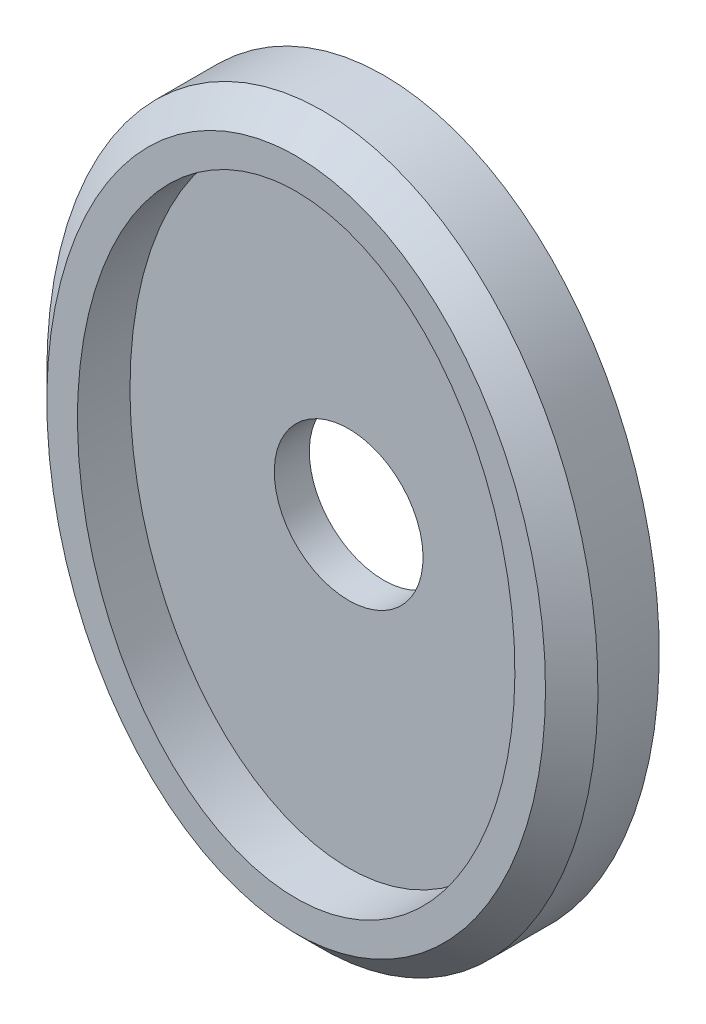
ISO-10303-21;
HEADER;
FILE_DESCRIPTION(('STEP AP214'),'2;1');
FILE_NAME('part.step','',(''),(''),'','','');
FILE_SCHEMA(('AUTOMOTIVE_DESIGN { 1 0 10303 214 1 1 1 1 }'));
ENDSEC;
DATA;
#1=APPLICATION_CONTEXT('core data for automotive mechanical design processes');
#2=APPLICATION_PROTOCOL_DEFINITION('international standard','automotive_design',2000,#1);
#3=PRODUCT_CONTEXT('',#1,'mechanical');
#4=PRODUCT('Part','Part','',(#3));
#5=PRODUCT_RELATED_PRODUCT_CATEGORY('part','',(#4));
#6=PRODUCT_DEFINITION_FORMATION('','',#4);
#7=PRODUCT_DEFINITION_CONTEXT('part definition',#1,'design');
#8=PRODUCT_DEFINITION('design','',#6,#7);
#9=PRODUCT_DEFINITION_SHAPE('','',#8);
#10=(LENGTH_UNIT() NAMED_UNIT(*) SI_UNIT(.MILLI.,.METRE.));
#11=(NAMED_UNIT(*) PLANE_ANGLE_UNIT() SI_UNIT($,.RADIAN.));
#12=(NAMED_UNIT(*) SI_UNIT($,.STERADIAN.) SOLID_ANGLE_UNIT());
#13=UNCERTAINTY_MEASURE_WITH_UNIT(LENGTH_MEASURE(1.E-05),#10,'distance_accuracy_value','');
#14=(GEOMETRIC_REPRESENTATION_CONTEXT(3) GLOBAL_UNCERTAINTY_ASSIGNED_CONTEXT((#13)) GLOBAL_UNIT_ASSIGNED_CONTEXT((#10,
#11,#12)) REPRESENTATION_CONTEXT('',''));
#15=CARTESIAN_POINT('',(0.,0.,0.));
#16=DIRECTION('',(0.,0.,1.));
#17=DIRECTION('',(1.,0.,0.));
#18=AXIS2_PLACEMENT_3D('',#15,#16,#17);
#19=CARTESIAN_POINT('',(0.,0.,5.));
#20=DIRECTION('',(0.,0.,1.));
#21=DIRECTION('',(0.,-1.,0.));
#22=AXIS2_PLACEMENT_3D('',#19,#20,#21);
#23=PLANE('',#22);
#24=CARTESIAN_POINT('',(0.,17.5,5.));
#25=CARTESIAN_POINT('',(0.252524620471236,17.5000049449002,5.));
#26=CARTESIAN_POINT('',(0.505010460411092,17.4892740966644,5.));
#27=CARTESIAN_POINT('',(1.00824976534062,17.44654828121,5.));
#28=CARTESIAN_POINT('',(1.25900281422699,17.4145483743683,5.));
#29=CARTESIAN_POINT('',(1.75718994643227,17.3297901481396,5.));
#30=CARTESIAN_POINT('',(2.0046208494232,17.2770132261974,5.));
#31=CARTESIAN_POINT('',(2.49436557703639,17.1515777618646,5.));
#32=CARTESIAN_POINT('',(2.73667956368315,17.078919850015,5.));
#33=CARTESIAN_POINT('',(3.21853857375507,16.9135700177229,5.));
#34=CARTESIAN_POINT('',(3.45798319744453,16.8205863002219,5.));
#35=CARTESIAN_POINT('',(3.92904867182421,16.6166122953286,5.));
#36=CARTESIAN_POINT('',(4.16066952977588,16.5056220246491,5.));
#37=CARTESIAN_POINT('',(4.61522379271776,16.2670502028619,5.));
#38=CARTESIAN_POINT('',(4.83815596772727,16.1394663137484,5.));
#39=CARTESIAN_POINT('',(5.27466718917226,15.8691635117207,5.));
#40=CARTESIAN_POINT('',(5.48824426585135,15.7264414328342,5.));
#41=CARTESIAN_POINT('',(5.99988816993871,15.3596754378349,5.));
#42=CARTESIAN_POINT('',(6.29252867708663,15.1280244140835,5.));
#43=CARTESIAN_POINT('',(6.85634168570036,14.6399135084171,5.));
#44=CARTESIAN_POINT('',(7.12750649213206,14.383444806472,5.));
#45=CARTESIAN_POINT('',(7.64858456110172,13.8489405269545,5.));
#46=CARTESIAN_POINT('',(7.89845964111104,13.5708678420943,5.));
#47=CARTESIAN_POINT('',(8.3765838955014,12.9968004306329,5.));
#48=CARTESIAN_POINT('',(8.60483253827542,12.7008052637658,5.));
#49=CARTESIAN_POINT('',(9.12095789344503,11.9808957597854,5.));
#50=CARTESIAN_POINT('',(9.3995178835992,11.5502831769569,5.));
#51=CARTESIAN_POINT('',(9.91813279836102,10.6664584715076,5.));
#52=CARTESIAN_POINT('',(10.1581742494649,10.2132385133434,5.));
#53=CARTESIAN_POINT('',(10.6013498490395,9.28862376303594,5.));
#54=CARTESIAN_POINT('',(10.8044478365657,8.81721170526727,5.));
#55=CARTESIAN_POINT('',(11.1747916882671,7.86060405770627,5.));
#56=CARTESIAN_POINT('',(11.3420375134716,7.37540845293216,5.));
#57=CARTESIAN_POINT('',(11.6845104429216,6.25500137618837,5.));
#58=CARTESIAN_POINT('',(11.848501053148,5.61633925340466,5.));
#59=CARTESIAN_POINT('',(12.1213374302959,4.32729250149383,5.));
#60=CARTESIAN_POINT('',(12.2301681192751,3.67690471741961,5.));
#61=CARTESIAN_POINT('',(12.3940426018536,2.36880145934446,5.));
#62=CARTESIAN_POINT('',(12.4490362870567,1.7110797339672,5.));
#63=CARTESIAN_POINT('',(12.5057293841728,0.393428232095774,5.));
#64=CARTESIAN_POINT('',(12.5074340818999,-0.266501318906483,5.));
#65=CARTESIAN_POINT('',(12.4573651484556,-1.59018413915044,5.));
#66=CARTESIAN_POINT('',(12.4051190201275,-2.25391969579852,5.));
#67=CARTESIAN_POINT('',(12.2457556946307,-3.57492037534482,5.));
#68=CARTESIAN_POINT('',(12.1386300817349,-4.23218449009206,5.));
#69=CARTESIAN_POINT('',(11.8683507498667,-5.53424518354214,5.));
#70=CARTESIAN_POINT('',(11.7052713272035,-6.17905710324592,5.));
#71=CARTESIAN_POINT('',(11.3211133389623,-7.45104906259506,5.));
#72=CARTESIAN_POINT('',(11.1000608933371,-8.07823690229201,5.));
#73=CARTESIAN_POINT('',(10.6776867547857,-9.11134451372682,5.));
#74=CARTESIAN_POINT('',(10.4926305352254,-9.52392950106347,5.));
#75=CARTESIAN_POINT('',(10.0936157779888,-10.3346874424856,5.));
#76=CARTESIAN_POINT('',(9.87965907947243,-10.7328613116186,5.));
#77=CARTESIAN_POINT('',(9.19307285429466,-11.900394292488,5.));
#78=CARTESIAN_POINT('',(8.67499781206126,-12.644599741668,5.));
#79=CARTESIAN_POINT('',(7.87497003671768,-13.5964412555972,5.));
#80=CARTESIAN_POINT('',(7.64639839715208,-13.8500793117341,5.));
#81=CARTESIAN_POINT('',(7.1710208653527,-14.3398197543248,5.));
#82=CARTESIAN_POINT('',(6.92421590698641,-14.5759230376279,5.));
#83=CARTESIAN_POINT('',(6.41273820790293,-15.0275612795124,5.));
#84=CARTESIAN_POINT('',(6.1480783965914,-15.2431108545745,5.));
#85=CARTESIAN_POINT('',(5.60123310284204,-15.6507269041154,5.));
#86=CARTESIAN_POINT('',(5.31905145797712,-15.8427984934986,5.));
#87=CARTESIAN_POINT('',(4.79300259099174,-16.1664169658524,5.));
#88=CARTESIAN_POINT('',(4.55194976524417,-16.3025462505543,5.));
#89=CARTESIAN_POINT('',(4.05985800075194,-16.555330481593,5.));
#90=CARTESIAN_POINT('',(3.80882113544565,-16.6719894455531,5.));
#91=CARTESIAN_POINT('',(3.29830569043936,-16.8839034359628,5.));
#92=CARTESIAN_POINT('',(3.03884116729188,-16.9791921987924,5.));
#93=CARTESIAN_POINT('',(2.51271722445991,-17.1469442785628,5.));
#94=CARTESIAN_POINT('',(2.2460601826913,-17.219415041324,5.));
#95=CARTESIAN_POINT('',(1.65259821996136,-17.3524645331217,5.));
#96=CARTESIAN_POINT('',(1.3245647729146,-17.4076488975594,5.));
#97=CARTESIAN_POINT('',(0.664332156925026,-17.4814153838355,5.));
#98=CARTESIAN_POINT('',(0.332132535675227,-17.4999934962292,5.));
#99=CARTESIAN_POINT('',(-0.252524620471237,-17.5000049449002,5.));
#100=CARTESIAN_POINT('',(-0.505010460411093,-17.4892740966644,5.));
#101=CARTESIAN_POINT('',(-1.00824976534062,-17.44654828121,5.));
#102=CARTESIAN_POINT('',(-1.25900281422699,-17.4145483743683,5.));
#103=CARTESIAN_POINT('',(-1.75718994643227,-17.3297901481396,5.));
#104=CARTESIAN_POINT('',(-2.0046208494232,-17.2770132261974,5.));
#105=CARTESIAN_POINT('',(-2.49436557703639,-17.1515777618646,5.));
#106=CARTESIAN_POINT('',(-2.73667956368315,-17.078919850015,5.));
#107=CARTESIAN_POINT('',(-3.21853857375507,-16.9135700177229,5.));
#108=CARTESIAN_POINT('',(-3.45798319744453,-16.8205863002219,5.));
#109=CARTESIAN_POINT('',(-3.92904867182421,-16.6166122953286,5.));
#110=CARTESIAN_POINT('',(-4.16066952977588,-16.5056220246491,5.));
#111=CARTESIAN_POINT('',(-4.61522379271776,-16.2670502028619,5.));
#112=CARTESIAN_POINT('',(-4.83815596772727,-16.1394663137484,5.));
#113=CARTESIAN_POINT('',(-5.27466718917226,-15.8691635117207,5.));
#114=CARTESIAN_POINT('',(-5.48824426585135,-15.7264414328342,5.));
#115=CARTESIAN_POINT('',(-5.99988816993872,-15.3596754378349,5.));
#116=CARTESIAN_POINT('',(-6.29252867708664,-15.1280244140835,5.));
#117=CARTESIAN_POINT('',(-6.85634168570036,-14.6399135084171,5.));
#118=CARTESIAN_POINT('',(-7.12750649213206,-14.383444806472,5.));
#119=CARTESIAN_POINT('',(-7.64858456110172,-13.8489405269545,5.));
#120=CARTESIAN_POINT('',(-7.89845964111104,-13.5708678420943,5.));
#121=CARTESIAN_POINT('',(-8.3765838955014,-12.9968004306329,5.));
#122=CARTESIAN_POINT('',(-8.60483253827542,-12.7008052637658,5.));
#123=CARTESIAN_POINT('',(-9.12095789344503,-11.9808957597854,5.));
#124=CARTESIAN_POINT('',(-9.3995178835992,-11.5502831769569,5.));
#125=CARTESIAN_POINT('',(-9.91813279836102,-10.6664584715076,5.));
#126=CARTESIAN_POINT('',(-10.1581742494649,-10.2132385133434,5.));
#127=CARTESIAN_POINT('',(-10.6013498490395,-9.28862376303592,5.));
#128=CARTESIAN_POINT('',(-10.8044478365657,-8.81721170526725,5.));
#129=CARTESIAN_POINT('',(-11.1747916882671,-7.86060405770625,5.));
#130=CARTESIAN_POINT('',(-11.3420375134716,-7.37540845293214,5.));
#131=CARTESIAN_POINT('',(-11.6845104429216,-6.25500137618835,5.));
#132=CARTESIAN_POINT('',(-11.848501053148,-5.61633925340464,5.));
#133=CARTESIAN_POINT('',(-12.1213374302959,-4.32729250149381,5.));
#134=CARTESIAN_POINT('',(-12.2301681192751,-3.67690471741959,5.));
#135=CARTESIAN_POINT('',(-12.3940426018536,-2.36880145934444,5.));
#136=CARTESIAN_POINT('',(-12.4490362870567,-1.71107973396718,5.));
#137=CARTESIAN_POINT('',(-12.5057293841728,-0.393428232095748,5.));
#138=CARTESIAN_POINT('',(-12.5074340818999,0.266501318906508,5.));
#139=CARTESIAN_POINT('',(-12.4573651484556,1.59018413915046,5.));
#140=CARTESIAN_POINT('',(-12.4051190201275,2.25391969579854,5.));
#141=CARTESIAN_POINT('',(-12.2457556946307,3.57492037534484,5.));
#142=CARTESIAN_POINT('',(-12.1386300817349,4.23218449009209,5.));
#143=CARTESIAN_POINT('',(-11.8683507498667,5.53424518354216,5.));
#144=CARTESIAN_POINT('',(-11.7052713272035,6.17905710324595,5.));
#145=CARTESIAN_POINT('',(-11.3211133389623,7.45104906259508,5.));
#146=CARTESIAN_POINT('',(-11.1000608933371,8.07823690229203,5.));
#147=CARTESIAN_POINT('',(-10.6776867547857,9.11134451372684,5.));
#148=CARTESIAN_POINT('',(-10.4926305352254,9.52392950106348,5.));
#149=CARTESIAN_POINT('',(-10.0936157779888,10.3346874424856,5.));
#150=CARTESIAN_POINT('',(-9.87965907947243,10.7328613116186,5.));
#151=CARTESIAN_POINT('',(-9.19307285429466,11.900394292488,5.));
#152=CARTESIAN_POINT('',(-8.67499781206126,12.644599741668,5.));
#153=CARTESIAN_POINT('',(-7.87497003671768,13.5964412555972,5.));
#154=CARTESIAN_POINT('',(-7.64639839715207,13.8500793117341,5.));
#155=CARTESIAN_POINT('',(-7.1710208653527,14.3398197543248,5.));
#156=CARTESIAN_POINT('',(-6.92421590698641,14.5759230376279,5.));
#157=CARTESIAN_POINT('',(-6.41273820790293,15.0275612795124,5.));
#158=CARTESIAN_POINT('',(-6.1480783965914,15.2431108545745,5.));
#159=CARTESIAN_POINT('',(-5.60123310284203,15.6507269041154,5.));
#160=CARTESIAN_POINT('',(-5.31905145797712,15.8427984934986,5.));
#161=CARTESIAN_POINT('',(-4.79300259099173,16.1664169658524,5.));
#162=CARTESIAN_POINT('',(-4.55194976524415,16.3025462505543,5.));
#163=CARTESIAN_POINT('',(-4.05985800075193,16.555330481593,5.));
#164=CARTESIAN_POINT('',(-3.80882113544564,16.6719894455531,5.));
#165=CARTESIAN_POINT('',(-3.29830569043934,16.8839034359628,5.));
#166=CARTESIAN_POINT('',(-3.03884116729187,16.9791921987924,5.));
#167=CARTESIAN_POINT('',(-2.51271722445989,17.1469442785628,5.));
#168=CARTESIAN_POINT('',(-2.24606018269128,17.219415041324,5.));
#169=CARTESIAN_POINT('',(-1.65259821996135,17.3524645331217,5.));
#170=CARTESIAN_POINT('',(-1.32456477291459,17.4076488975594,5.));
#171=CARTESIAN_POINT('',(-0.664332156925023,17.4814153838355,5.));
#172=CARTESIAN_POINT('',(-0.332132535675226,17.4999934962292,5.));
#173=CARTESIAN_POINT('',(0.,17.5,5.));
#174=B_SPLINE_CURVE_WITH_KNOTS('',3,(#24,#25,#26,#27,#28,#29,#30,#31,#32,#33,#34,#35,#36,#37,
#38,#39,#40,#41,#42,#43,#44,#45,#46,#47,#48,#49,#50,#51,#52,#53,#54,#55,#56,#57,#58,#59,#60,#61,
#62,#63,#64,#65,#66,#67,#68,#69,#70,#71,#72,#73,#74,#75,#76,#77,#78,#79,#80,#81,#82,#83,#84,#85,
#86,#87,#88,#89,#90,#91,#92,#93,#94,#95,#96,#97,#98,#99,#100,#101,#102,#103,#104,#105,#106,#107,
#108,#109,#110,#111,#112,#113,#114,#115,#116,#117,#118,#119,#120,#121,#122,#123,#124,#125,#126,
#127,#128,#129,#130,#131,#132,#133,#134,#135,#136,#137,#138,#139,#140,#141,#142,#143,#144,#145,
#146,#147,#148,#149,#150,#151,#152,#153,#154,#155,#156,#157,#158,#159,#160,#161,#162,#163,#164,
#165,#166,#167,#168,#169,#170,#171,#172,#173),.UNSPECIFIED.,.T.,.F.,(4,2,2,2,2,2,2,2,2,2,2,2,2,
2,2,2,2,2,2,2,2,2,2,2,2,2,2,2,2,2,2,2,2,2,2,2,2,2,2,2,2,2,2,2,2,2,2,2,2,2,2,2,2,2,2,2,2,2,2,2,2,
2,2,2,2,2,2,2,2,2,2,2,2,2,4),(0.,0.757280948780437,1.51473783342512,2.27287444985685,
3.0309870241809,3.80079604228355,4.57060434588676,5.34052123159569,6.11059945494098,
7.22861849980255,8.3470363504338,9.46741958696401,10.5878303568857,12.1241417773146,
13.6609894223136,15.1993333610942,16.7376789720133,18.7131585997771,20.6891779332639,
22.6670346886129,24.6446952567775,26.6398241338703,28.6352590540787,30.6280545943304,
32.6199538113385,33.975369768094,35.3306995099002,38.0354856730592,39.0591260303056,
40.0827139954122,41.1055685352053,42.1281998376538,42.9579132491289,43.7874552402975,
44.6156782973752,45.4436308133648,46.4395340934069,47.4355464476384,48.1928273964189,
48.9502842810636,49.7084208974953,50.4665334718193,51.236342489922,52.0061507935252,
52.7760676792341,53.5461459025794,54.664164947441,55.7825827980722,56.9029660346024,
58.0233768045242,59.559688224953,61.096535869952,62.6348798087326,64.1732254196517,
66.1487050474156,68.1247243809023,70.1025811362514,72.0802417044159,74.0753705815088,
76.0708055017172,78.0636010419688,80.055500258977,81.4109162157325,82.7662459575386,
85.4710321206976,86.494672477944,87.5182604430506,88.5411149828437,89.5637462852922,
90.3934596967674,91.223001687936,92.0512247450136,92.8791772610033,93.8750805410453,
94.8710928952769),.UNSPECIFIED.);
#175=CARTESIAN_POINT('',(0.,17.5,5.));
#176=VERTEX_POINT('',#175);
#177=EDGE_CURVE('E21',#176,#176,#174,.T.);
#178=ORIENTED_EDGE('',*,*,#177,.T.);
#179=EDGE_LOOP('',(#178));
#180=FACE_BOUND('',#179,.T.);
#181=CARTESIAN_POINT('',(-0.00914844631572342,19.2499959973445,5.));
#182=CARTESIAN_POINT('',(0.287615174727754,19.2502543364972,5.));
#183=CARTESIAN_POINT('',(0.584417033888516,19.2378590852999,5.));
#184=CARTESIAN_POINT('',(1.17573768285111,19.1879893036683,5.));
#185=CARTESIAN_POINT('',(1.47025752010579,19.1505270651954,5.));
#186=CARTESIAN_POINT('',(2.05535891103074,19.0511455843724,5.));
#187=CARTESIAN_POINT('',(2.34593733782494,18.9892079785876,5.));
#188=CARTESIAN_POINT('',(2.92111015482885,18.8418929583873,5.));
#189=CARTESIAN_POINT('',(3.20570375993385,18.756512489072,5.));
#190=CARTESIAN_POINT('',(3.76589719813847,18.5640767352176,5.));
#191=CARTESIAN_POINT('',(4.04153397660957,18.457128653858,5.));
#192=CARTESIAN_POINT('',(4.58405129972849,18.2227491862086,5.));
#193=CARTESIAN_POINT('',(4.85092854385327,18.0953101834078,5.));
#194=CARTESIAN_POINT('',(5.3747771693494,17.8215368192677,5.));
#195=CARTESIAN_POINT('',(5.63174882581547,17.6752029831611,5.));
#196=CARTESIAN_POINT('',(6.13505235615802,17.3652261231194,5.));
#197=CARTESIAN_POINT('',(6.38138210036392,17.201579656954,5.));
#198=CARTESIAN_POINT('',(6.97024214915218,16.7819951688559,5.));
#199=CARTESIAN_POINT('',(7.30667111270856,16.5174504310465,5.));
#200=CARTESIAN_POINT('',(7.95505665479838,15.9598859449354,5.));
#201=CARTESIAN_POINT('',(8.26700489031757,15.6668565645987,5.));
#202=CARTESIAN_POINT('',(8.86649569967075,15.0558543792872,5.));
#203=CARTESIAN_POINT('',(9.15399385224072,14.7378381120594,5.));
#204=CARTESIAN_POINT('',(9.70393912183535,14.0809299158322,5.));
#205=CARTESIAN_POINT('',(9.96638568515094,13.7420375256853,5.));
#206=CARTESIAN_POINT('',(10.548128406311,12.9329460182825,5.));
#207=CARTESIAN_POINT('',(10.8580370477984,12.4559795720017,5.));
#208=CARTESIAN_POINT('',(11.43525557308,11.4769113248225,5.));
#209=CARTESIAN_POINT('',(11.7025516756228,10.9748014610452,5.));
#210=CARTESIAN_POINT('',(12.1956772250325,9.95043137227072,5.));
#211=CARTESIAN_POINT('',(12.4214894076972,9.42816286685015,5.));
#212=CARTESIAN_POINT('',(12.8325908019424,8.36803180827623,5.));
#213=CARTESIAN_POINT('',(13.017883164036,7.83017047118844,5.));
#214=CARTESIAN_POINT('',(13.3525160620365,6.73076710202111,5.));
#215=CARTESIAN_POINT('',(13.5009981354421,6.16896456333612,5.));
#216=CARTESIAN_POINT('',(13.7575919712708,5.0362480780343,5.));
#217=CARTESIAN_POINT('',(13.8657033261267,4.46533403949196,5.));
#218=CARTESIAN_POINT('',(14.0422115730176,3.31728482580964,5.));
#219=CARTESIAN_POINT('',(14.1105996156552,2.7401482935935,5.));
#220=CARTESIAN_POINT('',(14.208041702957,1.5825531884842,5.));
#221=CARTESIAN_POINT('',(14.237092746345,1.00209436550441,5.));
#222=CARTESIAN_POINT('',(14.2579968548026,-0.279765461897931,5.));
#223=CARTESIAN_POINT('',(14.2409053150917,-0.981329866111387,5.));
#224=CARTESIAN_POINT('',(14.1495087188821,-2.380851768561,5.));
#225=CARTESIAN_POINT('',(14.0751923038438,-3.07880852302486,5.));
#226=CARTESIAN_POINT('',(13.8686669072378,-4.46622045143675,5.));
#227=CARTESIAN_POINT('',(13.7364523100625,-5.15567479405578,5.));
#228=CARTESIAN_POINT('',(13.413011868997,-6.52049544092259,5.));
#229=CARTESIAN_POINT('',(13.2218029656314,-7.19586573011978,5.));
#230=CARTESIAN_POINT('',(12.8271224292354,-8.38127708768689,5.));
#231=CARTESIAN_POINT('',(12.6354309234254,-8.89523681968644,5.));
#232=CARTESIAN_POINT('',(12.2142153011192,-9.90718557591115,5.));
#233=CARTESIAN_POINT('',(11.9846920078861,-10.405174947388,5.));
#234=CARTESIAN_POINT('',(11.2380271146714,-11.8685640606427,5.));
#235=CARTESIAN_POINT('',(10.6620073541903,-12.8058039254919,5.));
#236=CARTESIAN_POINT('',(9.75865247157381,-14.0108564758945,5.));
#237=CARTESIAN_POINT('',(9.50015290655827,-14.3317438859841,5.));
#238=CARTESIAN_POINT('',(8.95993053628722,-14.9535273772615,5.));
#239=CARTESIAN_POINT('',(8.67820933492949,-15.2544248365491,5.));
#240=CARTESIAN_POINT('',(8.09189583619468,-15.832634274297,5.));
#241=CARTESIAN_POINT('',(7.7873203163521,-16.1099632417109,5.));
#242=CARTESIAN_POINT('',(7.15560429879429,-16.6375693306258,5.));
#243=CARTESIAN_POINT('',(6.82847103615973,-16.8878550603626,5.));
#244=CARTESIAN_POINT('',(6.21765447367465,-17.3122008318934,5.));
#245=CARTESIAN_POINT('',(5.93771737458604,-17.4916625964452,5.));
#246=CARTESIAN_POINT('',(5.36466441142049,-17.8280752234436,5.));
#247=CARTESIAN_POINT('',(5.07155194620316,-17.9850318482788,5.));
#248=CARTESIAN_POINT('',(4.47381928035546,-18.2739754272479,5.));
#249=CARTESIAN_POINT('',(4.16921830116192,-18.4060020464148,5.));
#250=CARTESIAN_POINT('',(3.54948364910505,-18.6433058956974,5.));
#251=CARTESIAN_POINT('',(3.23434359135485,-18.7485665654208,5.));
#252=CARTESIAN_POINT('',(2.67839971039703,-18.9067994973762,5.));
#253=CARTESIAN_POINT('',(2.43942373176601,-18.9662549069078,5.));
#254=CARTESIAN_POINT('',(1.957901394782,-19.0686956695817,5.));
#255=CARTESIAN_POINT('',(1.71535440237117,-19.1116780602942,5.));
#256=CARTESIAN_POINT('',(1.22792096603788,-19.1806414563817,5.));
#257=CARTESIAN_POINT('',(0.98303520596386,-19.2066272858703,5.));
#258=CARTESIAN_POINT('',(0.492105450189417,-19.2413053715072,5.));
#259=CARTESIAN_POINT('',(0.246061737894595,-19.2500016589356,5.));
#260=CARTESIAN_POINT('',(-0.296819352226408,-19.2499979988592,5.));
#261=CARTESIAN_POINT('',(-0.593664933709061,-19.2373395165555,5.));
#262=CARTESIAN_POINT('',(-1.18504760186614,-19.1869351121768,5.));
#263=CARTESIAN_POINT('',(-1.4795857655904,-19.149201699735,5.));
#264=CARTESIAN_POINT('',(-2.0647001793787,-19.0492851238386,5.));
#265=CARTESIAN_POINT('',(-2.35527332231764,-18.9870838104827,5.));
#266=CARTESIAN_POINT('',(-2.93041347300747,-18.8392388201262,5.));
#267=CARTESIAN_POINT('',(-3.21497968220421,-18.7535920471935,5.));
#268=CARTESIAN_POINT('',(-3.77510148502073,-18.5606402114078,5.));
#269=CARTESIAN_POINT('',(-4.05069412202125,-18.4534423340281,5.));
#270=CARTESIAN_POINT('',(-4.59310443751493,-18.2185673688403,5.));
#271=CARTESIAN_POINT('',(-4.85991881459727,-18.0908826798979,5.));
#272=CARTESIAN_POINT('',(-5.38362990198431,-17.8166324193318,5.));
#273=CARTESIAN_POINT('',(-5.64052686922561,-17.6700673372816,5.));
#274=CARTESIAN_POINT('',(-6.14366936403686,-17.3596397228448,5.));
#275=CARTESIAN_POINT('',(-6.38991276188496,-17.1957737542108,5.));
#276=CARTESIAN_POINT('',(-6.97871420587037,-16.7755523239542,5.));
#277=CARTESIAN_POINT('',(-7.31515529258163,-16.5105819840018,5.));
#278=CARTESIAN_POINT('',(-7.96352595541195,-15.9521647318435,5.));
#279=CARTESIAN_POINT('',(-8.27544715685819,-15.6587081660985,5.));
#280=CARTESIAN_POINT('',(-8.87485388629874,-15.0468578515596,5.));
#281=CARTESIAN_POINT('',(-9.1622948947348,-14.7284206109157,5.));
#282=CARTESIAN_POINT('',(-9.71209372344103,-14.0706761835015,5.));
#283=CARTESIAN_POINT('',(-9.9744510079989,-13.7313685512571,5.));
#284=CARTESIAN_POINT('',(-10.555955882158,-12.9213178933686,5.));
#285=CARTESIAN_POINT('',(-10.865705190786,-12.4438104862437,5.));
#286=CARTESIAN_POINT('',(-11.4425520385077,-11.4636723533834,5.));
#287=CARTESIAN_POINT('',(-11.7096357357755,-10.9610335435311,5.));
#288=CARTESIAN_POINT('',(-12.2023070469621,-9.93563092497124,5.));
#289=CARTESIAN_POINT('',(-12.4278774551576,-9.41285887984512,5.));
#290=CARTESIAN_POINT('',(-12.8384473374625,-8.35173730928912,5.));
#291=CARTESIAN_POINT('',(-13.0234500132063,-7.81338901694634,5.));
#292=CARTESIAN_POINT('',(-13.3574450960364,-6.71303899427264,5.));
#293=CARTESIAN_POINT('',(-13.5055793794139,-6.15077758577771,5.));
#294=CARTESIAN_POINT('',(-13.7614372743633,-5.01716703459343,5.));
#295=CARTESIAN_POINT('',(-13.869160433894,-4.44581779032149,5.));
#296=CARTESIAN_POINT('',(-14.0448540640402,-3.29692316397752,5.));
#297=CARTESIAN_POINT('',(-14.1128155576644,-2.71937641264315,5.));
#298=CARTESIAN_POINT('',(-14.2093628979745,-1.56099023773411,5.));
#299=CARTESIAN_POINT('',(-14.2379457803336,-0.980150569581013,5.));
#300=CARTESIAN_POINT('',(-14.2577541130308,0.30227899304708,5.));
#301=CARTESIAN_POINT('',(-14.2400418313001,1.00402438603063,5.));
#302=CARTESIAN_POINT('',(-14.1473669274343,2.40385727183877,5.));
#303=CARTESIAN_POINT('',(-14.0723928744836,3.10194400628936,5.));
#304=CARTESIAN_POINT('',(-13.8645182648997,4.48954348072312,5.));
#305=CARTESIAN_POINT('',(-13.7316124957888,5.1790554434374,5.));
#306=CARTESIAN_POINT('',(-13.406728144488,6.54394360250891,5.));
#307=CARTESIAN_POINT('',(-13.2147666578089,7.21932382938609,5.));
#308=CARTESIAN_POINT('',(-12.8189608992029,8.40393034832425,5.));
#309=CARTESIAN_POINT('',(-12.6269440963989,8.91712746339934,5.));
#310=CARTESIAN_POINT('',(-12.2049975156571,9.92777592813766,5.));
#311=CARTESIAN_POINT('',(-11.9750685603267,10.4252276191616,5.));
#312=CARTESIAN_POINT('',(-11.4766291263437,11.3996925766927,5.));
#313=CARTESIAN_POINT('',(-11.2081670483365,11.8767305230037,5.));
#314=CARTESIAN_POINT('',(-10.6315045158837,12.8061541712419,5.));
#315=CARTESIAN_POINT('',(-10.3233151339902,13.2585466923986,5.));
#316=CARTESIAN_POINT('',(-9.74768660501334,14.0247693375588,5.));
#317=CARTESIAN_POINT('',(-9.48901340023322,14.3452023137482,5.));
#318=CARTESIAN_POINT('',(-8.94853288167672,14.9659877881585,5.));
#319=CARTESIAN_POINT('',(-8.66672715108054,15.2663416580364,5.));
#320=CARTESIAN_POINT('',(-8.08027162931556,15.8434765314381,5.));
#321=CARTESIAN_POINT('',(-7.77563866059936,16.1202745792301,5.));
#322=CARTESIAN_POINT('',(-7.14385073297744,16.6468107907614,5.));
#323=CARTESIAN_POINT('',(-6.81670269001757,16.8965572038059,5.));
#324=CARTESIAN_POINT('',(-6.20584205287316,17.3199681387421,5.));
#325=CARTESIAN_POINT('',(-5.92586459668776,17.4990301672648,5.));
#326=CARTESIAN_POINT('',(-5.352759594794,17.8346381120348,5.));
#327=CARTESIAN_POINT('',(-5.05963539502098,17.9911897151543,5.));
#328=CARTESIAN_POINT('',(-4.46191456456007,18.2793169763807,5.));
#329=CARTESIAN_POINT('',(-4.15733725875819,18.4109326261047,5.));
#330=CARTESIAN_POINT('',(-3.5376907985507,18.6474216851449,5.));
#331=CARTESIAN_POINT('',(-3.22261541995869,18.7522788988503,5.));
#332=CARTESIAN_POINT('',(-2.66838521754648,18.9093660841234,5.));
#333=CARTESIAN_POINT('',(-2.43107935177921,18.9681835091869,5.));
#334=CARTESIAN_POINT('',(-1.95295993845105,19.069585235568,5.));
#335=CARTESIAN_POINT('',(-1.71214578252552,19.1121666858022,5.));
#336=CARTESIAN_POINT('',(-1.22821210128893,19.1805665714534,5.));
#337=CARTESIAN_POINT('',(-0.985093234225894,19.2063896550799,5.));
#338=CARTESIAN_POINT('',(-0.497707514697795,19.2409960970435,5.));
#339=CARTESIAN_POINT('',(-0.253440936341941,19.2497833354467,5.));
#340=CARTESIAN_POINT('',(-0.00914844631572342,19.2499959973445,5.));
#341=B_SPLINE_CURVE_WITH_KNOTS('',3,(#181,#182,#183,#184,#185,#186,#187,#188,#189,#190,#191,
#192,#193,#194,#195,#196,#197,#198,#199,#200,#201,#202,#203,#204,#205,#206,#207,#208,#209,#210,
#211,#212,#213,#214,#215,#216,#217,#218,#219,#220,#221,#222,#223,#224,#225,#226,#227,#228,#229,
#230,#231,#232,#233,#234,#235,#236,#237,#238,#239,#240,#241,#242,#243,#244,#245,#246,#247,#248,
#249,#250,#251,#252,#253,#254,#255,#256,#257,#258,#259,#260,#261,#262,#263,#264,#265,#266,#267,
#268,#269,#270,#271,#272,#273,#274,#275,#276,#277,#278,#279,#280,#281,#282,#283,#284,#285,#286,
#287,#288,#289,#290,#291,#292,#293,#294,#295,#296,#297,#298,#299,#300,#301,#302,#303,#304,#305,
#306,#307,#308,#309,#310,#311,#312,#313,#314,#315,#316,#317,#318,#319,#320,#321,#322,#323,#324,
#325,#326,#327,#328,#329,#330,#331,#332,#333,#334,#335,#336,#337,#338,#339,#340),.UNSPECIFIED.,
.T.,.F.,(4,2,2,2,2,2,2,2,2,2,2,2,2,2,2,2,2,2,2,2,2,2,2,2,2,2,2,2,2,2,2,2,2,2,2,2,2,2,2,2,2,2,2,
2,2,2,2,2,2,2,2,2,2,2,2,2,2,2,2,2,2,2,2,2,2,2,2,2,2,2,2,2,2,2,2,2,2,2,2,4),(0.,
0.890070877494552,1.77970561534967,2.67000910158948,3.56042866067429,4.44652683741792,
5.33295514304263,6.21935881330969,7.10593905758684,8.38799052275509,9.67047702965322,
10.9552459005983,12.2400431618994,13.9440069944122,15.648520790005,17.3537423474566,
19.0588312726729,20.8005736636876,22.5423336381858,24.284481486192,26.0267622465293,
28.129688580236,30.2330324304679,32.3365803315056,34.4395247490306,36.0835911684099,
37.7276218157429,41.0081260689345,42.2435052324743,43.4787991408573,44.7131949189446,
45.947196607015,46.9438327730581,47.9402132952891,48.9349949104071,49.9303905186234,
50.6686405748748,51.4070233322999,52.1451964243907,52.8831973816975,53.773433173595,
54.6632251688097,55.5536784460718,56.4442493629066,57.3304959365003,58.2170720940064,
59.103625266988,59.9903548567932,61.2732230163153,62.5565274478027,63.8421179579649,
65.127735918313,66.8327985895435,68.5384133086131,70.2447333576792,71.9509186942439,
73.6937243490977,75.4365494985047,77.1797679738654,78.9231176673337,81.0266316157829,
83.1305655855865,85.2346888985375,87.3382036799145,88.9806439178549,90.6230485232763,
92.2634079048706,93.9033110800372,95.1377330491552,96.3720706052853,97.605507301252,
98.8385667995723,99.8346576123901,100.830496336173,101.824724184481,102.819552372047,
103.552490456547,104.285557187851,105.018420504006,105.751116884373),.UNSPECIFIED.);
#342=CARTESIAN_POINT('',(-0.00914844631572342,19.2499959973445,5.));
#343=VERTEX_POINT('',#342);
#344=EDGE_CURVE('E48',#343,#343,#341,.T.);
#345=ORIENTED_EDGE('',*,*,#344,.F.);
#346=EDGE_LOOP('',(#345));
#347=FACE_BOUND('',#346,.T.);
#348=ADVANCED_FACE('F14',(#180,#347),#23,.T.);
#349=CARTESIAN_POINT('',(0.,17.5,2.));
#350=CARTESIAN_POINT('',(0.,17.5,5.));
#351=CARTESIAN_POINT('',(-25.,17.5,2.));
#352=CARTESIAN_POINT('',(-25.,17.5,5.));
#353=CARTESIAN_POINT('',(-25.,-17.5,2.));
#354=CARTESIAN_POINT('',(-25.,-17.5,5.));
#355=CARTESIAN_POINT('',(0.,-17.5,2.));
#356=CARTESIAN_POINT('',(0.,-17.5,5.));
#357=CARTESIAN_POINT('',(25.,-17.5,2.));
#358=CARTESIAN_POINT('',(25.,-17.5,5.));
#359=CARTESIAN_POINT('',(25.,17.5,2.));
#360=CARTESIAN_POINT('',(25.,17.5,5.));
#361=CARTESIAN_POINT('',(0.,17.5,2.));
#362=CARTESIAN_POINT('',(0.,17.5,5.));
#363=(BOUNDED_SURFACE() B_SPLINE_SURFACE(3,1,((#349,#350),(#351,#352),(#353,#354),(#355,#356),
(#357,#358),(#359,#360),(#361,#362)),.UNSPECIFIED.,.T.,.F.,.F.) B_SPLINE_SURFACE_WITH_KNOTS((4,
3,4),(2,2),(0.,0.5,1.),(0.,1.),
.UNSPECIFIED.) GEOMETRIC_REPRESENTATION_ITEM() RATIONAL_B_SPLINE_SURFACE(((1.,1.),
(0.333333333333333,0.333333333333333),(0.333333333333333,0.333333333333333),(1.,1.),
(0.333333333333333,0.333333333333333),(0.333333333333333,0.333333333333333),(1.,1.))) REPRESENTATION_ITEM('') SURFACE());
#364=CARTESIAN_POINT('',(0.,-17.5,2.));
#365=CARTESIAN_POINT('',(0.252524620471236,-17.5000049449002,2.));
#366=CARTESIAN_POINT('',(0.505010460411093,-17.4892740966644,2.));
#367=CARTESIAN_POINT('',(1.00824976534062,-17.44654828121,2.));
#368=CARTESIAN_POINT('',(1.259002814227,-17.4145483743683,2.));
#369=CARTESIAN_POINT('',(1.75718994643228,-17.3297901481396,2.));
#370=CARTESIAN_POINT('',(2.00462084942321,-17.2770132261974,2.));
#371=CARTESIAN_POINT('',(2.4943655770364,-17.1515777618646,2.));
#372=CARTESIAN_POINT('',(2.73667956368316,-17.078919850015,2.));
#373=CARTESIAN_POINT('',(3.21853857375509,-16.9135700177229,2.));
#374=CARTESIAN_POINT('',(3.45798319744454,-16.8205863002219,2.));
#375=CARTESIAN_POINT('',(3.92904867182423,-16.6166122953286,2.));
#376=CARTESIAN_POINT('',(4.1606695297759,-16.5056220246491,2.));
#377=CARTESIAN_POINT('',(4.61522379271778,-16.2670502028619,2.));
#378=CARTESIAN_POINT('',(4.8381559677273,-16.1394663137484,2.));
#379=CARTESIAN_POINT('',(5.27466718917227,-15.8691635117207,2.));
#380=CARTESIAN_POINT('',(5.48824426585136,-15.7264414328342,2.));
#381=CARTESIAN_POINT('',(5.99988816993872,-15.3596754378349,2.));
#382=CARTESIAN_POINT('',(6.29252867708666,-15.1280244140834,2.));
#383=CARTESIAN_POINT('',(6.8563416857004,-14.6399135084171,2.));
#384=CARTESIAN_POINT('',(7.12750649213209,-14.383444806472,2.));
#385=CARTESIAN_POINT('',(7.64858456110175,-13.8489405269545,2.));
#386=CARTESIAN_POINT('',(7.89845964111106,-13.5708678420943,2.));
#387=CARTESIAN_POINT('',(8.37658389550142,-12.9968004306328,2.));
#388=CARTESIAN_POINT('',(8.60483253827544,-12.7008052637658,2.));
#389=CARTESIAN_POINT('',(9.12095789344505,-11.9808957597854,2.));
#390=CARTESIAN_POINT('',(9.39951788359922,-11.5502831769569,2.));
#391=CARTESIAN_POINT('',(9.91813279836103,-10.6664584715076,2.));
#392=CARTESIAN_POINT('',(10.158174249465,-10.2132385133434,2.));
#393=CARTESIAN_POINT('',(10.6013498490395,-9.2886237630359,2.));
#394=CARTESIAN_POINT('',(10.8044478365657,-8.81721170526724,2.));
#395=CARTESIAN_POINT('',(11.1747916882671,-7.86060405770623,2.));
#396=CARTESIAN_POINT('',(11.3420375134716,-7.37540845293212,2.));
#397=CARTESIAN_POINT('',(11.6845104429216,-6.25500137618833,2.));
#398=CARTESIAN_POINT('',(11.848501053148,-5.61633925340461,2.));
#399=CARTESIAN_POINT('',(12.1213374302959,-4.32729250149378,2.));
#400=CARTESIAN_POINT('',(12.2301681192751,-3.67690471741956,2.));
#401=CARTESIAN_POINT('',(12.3940426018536,-2.36880145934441,2.));
#402=CARTESIAN_POINT('',(12.4490362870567,-1.71107973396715,2.));
#403=CARTESIAN_POINT('',(12.5057293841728,-0.393428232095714,2.));
#404=CARTESIAN_POINT('',(12.5074340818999,0.266501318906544,2.));
#405=CARTESIAN_POINT('',(12.4573651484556,1.5901841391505,2.));
#406=CARTESIAN_POINT('',(12.4051190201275,2.25391969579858,2.));
#407=CARTESIAN_POINT('',(12.2457556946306,3.57492037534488,2.));
#408=CARTESIAN_POINT('',(12.1386300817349,4.23218449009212,2.));
#409=CARTESIAN_POINT('',(11.8683507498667,5.5342451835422,2.));
#410=CARTESIAN_POINT('',(11.7052713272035,6.17905710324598,2.));
#411=CARTESIAN_POINT('',(11.3211133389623,7.45104906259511,2.));
#412=CARTESIAN_POINT('',(11.1000608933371,8.07823690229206,2.));
#413=CARTESIAN_POINT('',(10.6776867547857,9.11134451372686,2.));
#414=CARTESIAN_POINT('',(10.4926305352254,9.52392950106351,2.));
#415=CARTESIAN_POINT('',(10.0936157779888,10.3346874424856,2.));
#416=CARTESIAN_POINT('',(9.87965907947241,10.7328613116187,2.));
#417=CARTESIAN_POINT('',(9.19307285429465,11.900394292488,2.));
#418=CARTESIAN_POINT('',(8.67499781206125,12.644599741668,2.));
#419=CARTESIAN_POINT('',(7.87497003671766,13.5964412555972,2.));
#420=CARTESIAN_POINT('',(7.64639839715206,13.8500793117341,2.));
#421=CARTESIAN_POINT('',(7.17102086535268,14.3398197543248,2.));
#422=CARTESIAN_POINT('',(6.92421590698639,14.5759230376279,2.));
#423=CARTESIAN_POINT('',(6.4127382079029,15.0275612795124,2.));
#424=CARTESIAN_POINT('',(6.14807839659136,15.2431108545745,2.));
#425=CARTESIAN_POINT('',(5.601233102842,15.6507269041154,2.));
#426=CARTESIAN_POINT('',(5.3190514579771,15.8427984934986,2.));
#427=CARTESIAN_POINT('',(4.79300259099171,16.1664169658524,2.));
#428=CARTESIAN_POINT('',(4.55194976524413,16.3025462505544,2.));
#429=CARTESIAN_POINT('',(4.0598580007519,16.5553304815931,2.));
#430=CARTESIAN_POINT('',(3.80882113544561,16.6719894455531,2.));
#431=CARTESIAN_POINT('',(3.29830569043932,16.8839034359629,2.));
#432=CARTESIAN_POINT('',(3.03884116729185,16.9791921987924,2.));
#433=CARTESIAN_POINT('',(2.51271722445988,17.1469442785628,2.));
#434=CARTESIAN_POINT('',(2.24606018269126,17.219415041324,2.));
#435=CARTESIAN_POINT('',(1.65259821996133,17.3524645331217,2.));
#436=CARTESIAN_POINT('',(1.32456477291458,17.4076488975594,2.));
#437=CARTESIAN_POINT('',(0.664332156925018,17.4814153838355,2.));
#438=CARTESIAN_POINT('',(0.332132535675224,17.4999934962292,2.));
#439=CARTESIAN_POINT('',(-0.252524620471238,17.5000049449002,2.));
#440=CARTESIAN_POINT('',(-0.505010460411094,17.4892740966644,2.));
#441=CARTESIAN_POINT('',(-1.00824976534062,17.44654828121,2.));
#442=CARTESIAN_POINT('',(-1.259002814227,17.4145483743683,2.));
#443=CARTESIAN_POINT('',(-1.75718994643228,17.3297901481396,2.));
#444=CARTESIAN_POINT('',(-2.00462084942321,17.2770132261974,2.));
#445=CARTESIAN_POINT('',(-2.4943655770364,17.1515777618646,2.));
#446=CARTESIAN_POINT('',(-2.73667956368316,17.078919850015,2.));
#447=CARTESIAN_POINT('',(-3.21853857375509,16.9135700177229,2.));
#448=CARTESIAN_POINT('',(-3.45798319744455,16.8205863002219,2.));
#449=CARTESIAN_POINT('',(-3.92904867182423,16.6166122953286,2.));
#450=CARTESIAN_POINT('',(-4.1606695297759,16.5056220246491,2.));
#451=CARTESIAN_POINT('',(-4.61522379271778,16.2670502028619,2.));
#452=CARTESIAN_POINT('',(-4.8381559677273,16.1394663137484,2.));
#453=CARTESIAN_POINT('',(-5.27466718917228,15.8691635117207,2.));
#454=CARTESIAN_POINT('',(-5.48824426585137,15.7264414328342,2.));
#455=CARTESIAN_POINT('',(-5.99988816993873,15.3596754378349,2.));
#456=CARTESIAN_POINT('',(-6.29252867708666,15.1280244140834,2.));
#457=CARTESIAN_POINT('',(-6.8563416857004,14.6399135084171,2.));
#458=CARTESIAN_POINT('',(-7.12750649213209,14.383444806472,2.));
#459=CARTESIAN_POINT('',(-7.64858456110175,13.8489405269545,2.));
#460=CARTESIAN_POINT('',(-7.89845964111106,13.5708678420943,2.));
#461=CARTESIAN_POINT('',(-8.37658389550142,12.9968004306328,2.));
#462=CARTESIAN_POINT('',(-8.60483253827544,12.7008052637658,2.));
#463=CARTESIAN_POINT('',(-9.12095789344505,11.9808957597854,2.));
#464=CARTESIAN_POINT('',(-9.39951788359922,11.5502831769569,2.));
#465=CARTESIAN_POINT('',(-9.91813279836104,10.6664584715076,2.));
#466=CARTESIAN_POINT('',(-10.158174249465,10.2132385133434,2.));
#467=CARTESIAN_POINT('',(-10.6013498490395,9.2886237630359,2.));
#468=CARTESIAN_POINT('',(-10.8044478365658,8.81721170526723,2.));
#469=CARTESIAN_POINT('',(-11.1747916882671,7.86060405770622,2.));
#470=CARTESIAN_POINT('',(-11.3420375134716,7.3754084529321,2.));
#471=CARTESIAN_POINT('',(-11.6845104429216,6.25500137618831,2.));
#472=CARTESIAN_POINT('',(-11.848501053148,5.61633925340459,2.));
#473=CARTESIAN_POINT('',(-12.1213374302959,4.32729250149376,2.));
#474=CARTESIAN_POINT('',(-12.2301681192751,3.67690471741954,2.));
#475=CARTESIAN_POINT('',(-12.3940426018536,2.36880145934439,2.));
#476=CARTESIAN_POINT('',(-12.4490362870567,1.71107973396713,2.));
#477=CARTESIAN_POINT('',(-12.5057293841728,0.393428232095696,2.));
#478=CARTESIAN_POINT('',(-12.5074340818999,-0.266501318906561,2.));
#479=CARTESIAN_POINT('',(-12.4573651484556,-1.59018413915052,2.));
#480=CARTESIAN_POINT('',(-12.4051190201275,-2.2539196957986,2.));
#481=CARTESIAN_POINT('',(-12.2457556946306,-3.5749203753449,2.));
#482=CARTESIAN_POINT('',(-12.1386300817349,-4.23218449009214,2.));
#483=CARTESIAN_POINT('',(-11.8683507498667,-5.53424518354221,2.));
#484=CARTESIAN_POINT('',(-11.7052713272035,-6.179057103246,2.));
#485=CARTESIAN_POINT('',(-11.3211133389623,-7.45104906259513,2.));
#486=CARTESIAN_POINT('',(-11.100060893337,-8.07823690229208,2.));
#487=CARTESIAN_POINT('',(-10.6776867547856,-9.11134451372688,2.));
#488=CARTESIAN_POINT('',(-10.4926305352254,-9.52392950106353,2.));
#489=CARTESIAN_POINT('',(-10.0936157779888,-10.3346874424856,2.));
#490=CARTESIAN_POINT('',(-9.87965907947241,-10.7328613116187,2.));
#491=CARTESIAN_POINT('',(-9.19307285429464,-11.900394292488,2.));
#492=CARTESIAN_POINT('',(-8.67499781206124,-12.6445997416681,2.));
#493=CARTESIAN_POINT('',(-7.87497003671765,-13.5964412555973,2.));
#494=CARTESIAN_POINT('',(-7.64639839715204,-13.8500793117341,2.));
#495=CARTESIAN_POINT('',(-7.17102086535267,-14.3398197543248,2.));
#496=CARTESIAN_POINT('',(-6.92421590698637,-14.5759230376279,2.));
#497=CARTESIAN_POINT('',(-6.41273820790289,-15.0275612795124,2.));
#498=CARTESIAN_POINT('',(-6.14807839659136,-15.2431108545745,2.));
#499=CARTESIAN_POINT('',(-5.601233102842,-15.6507269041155,2.));
#500=CARTESIAN_POINT('',(-5.3190514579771,-15.8427984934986,2.));
#501=CARTESIAN_POINT('',(-4.79300259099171,-16.1664169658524,2.));
#502=CARTESIAN_POINT('',(-4.55194976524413,-16.3025462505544,2.));
#503=CARTESIAN_POINT('',(-4.05985800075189,-16.5553304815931,2.));
#504=CARTESIAN_POINT('',(-3.80882113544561,-16.6719894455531,2.));
#505=CARTESIAN_POINT('',(-3.29830569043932,-16.8839034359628,2.));
#506=CARTESIAN_POINT('',(-3.03884116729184,-16.9791921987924,2.));
#507=CARTESIAN_POINT('',(-2.51271722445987,-17.1469442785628,2.));
#508=CARTESIAN_POINT('',(-2.24606018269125,-17.219415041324,2.));
#509=CARTESIAN_POINT('',(-1.65259821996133,-17.3524645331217,2.));
#510=CARTESIAN_POINT('',(-1.32456477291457,-17.4076488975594,2.));
#511=CARTESIAN_POINT('',(-0.664332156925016,-17.4814153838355,2.));
#512=CARTESIAN_POINT('',(-0.332132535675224,-17.4999934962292,2.));
#513=CARTESIAN_POINT('',(0.,-17.5,2.));
#514=B_SPLINE_CURVE_WITH_KNOTS('',3,(#364,#365,#366,#367,#368,#369,#370,#371,#372,#373,#374,
#375,#376,#377,#378,#379,#380,#381,#382,#383,#384,#385,#386,#387,#388,#389,#390,#391,#392,#393,
#394,#395,#396,#397,#398,#399,#400,#401,#402,#403,#404,#405,#406,#407,#408,#409,#410,#411,#412,
#413,#414,#415,#416,#417,#418,#419,#420,#421,#422,#423,#424,#425,#426,#427,#428,#429,#430,#431,
#432,#433,#434,#435,#436,#437,#438,#439,#440,#441,#442,#443,#444,#445,#446,#447,#448,#449,#450,
#451,#452,#453,#454,#455,#456,#457,#458,#459,#460,#461,#462,#463,#464,#465,#466,#467,#468,#469,
#470,#471,#472,#473,#474,#475,#476,#477,#478,#479,#480,#481,#482,#483,#484,#485,#486,#487,#488,
#489,#490,#491,#492,#493,#494,#495,#496,#497,#498,#499,#500,#501,#502,#503,#504,#505,#506,#507,
#508,#509,#510,#511,#512,#513),.UNSPECIFIED.,.T.,.F.,(4,2,2,2,2,2,2,2,2,2,2,2,2,2,2,2,2,2,2,2,2,
2,2,2,2,2,2,2,2,2,2,2,2,2,2,2,2,2,2,2,2,2,2,2,2,2,2,2,2,2,2,2,2,2,2,2,2,2,2,2,2,2,2,2,2,2,2,2,2,
2,2,2,2,2,4),(0.,0.757280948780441,1.51473783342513,2.27287444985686,3.03098702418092,
3.80079604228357,4.57060434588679,5.34052123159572,6.11059945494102,7.22861849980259,
8.34703635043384,9.46741958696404,10.5878303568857,12.1241417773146,13.6609894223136,
15.1993333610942,16.7376789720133,18.7131585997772,20.6891779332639,22.667034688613,
24.6446952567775,26.6398241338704,28.6352590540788,30.6280545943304,32.6199538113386,
33.9753697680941,35.3306995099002,38.0354856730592,39.0591260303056,40.0827139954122,
41.1055685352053,42.1281998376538,42.957913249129,43.7874552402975,44.6156782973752,
45.4436308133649,46.4395340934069,47.4355464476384,48.1928273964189,48.9502842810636,
49.7084208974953,50.4665334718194,51.236342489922,52.0061507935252,52.7760676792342,
53.5461459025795,54.664164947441,55.7825827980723,56.9029660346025,58.0233768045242,
59.5596882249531,61.096535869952,62.6348798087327,64.1732254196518,66.1487050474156,
68.1247243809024,70.1025811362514,72.080241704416,74.0753705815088,76.0708055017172,
78.0636010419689,80.055500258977,81.4109162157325,82.7662459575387,85.4710321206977,
86.4946724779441,87.5182604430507,88.5411149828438,89.5637462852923,90.3934596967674,
91.223001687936,92.0512247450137,92.8791772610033,93.8750805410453,94.8710928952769),.UNSPECIFIED.);
#515=CARTESIAN_POINT('',(0.,17.5,2.));
#516=VERTEX_POINT('',#515);
#517=EDGE_CURVE('E45',#516,#516,#514,.T.);
#518=CARTESIAN_POINT('',(0.,17.5,2.));
#519=CARTESIAN_POINT('',(0.,17.5,2.03125));
#520=CARTESIAN_POINT('',(0.,17.5,2.0625));
#521=CARTESIAN_POINT('',(0.,17.5,2.125));
#522=CARTESIAN_POINT('',(0.,17.5,2.15625));
#523=CARTESIAN_POINT('',(0.,17.5,2.21875));
#524=CARTESIAN_POINT('',(0.,17.5,2.25));
#525=CARTESIAN_POINT('',(0.,17.5,2.3125));
#526=CARTESIAN_POINT('',(0.,17.5,2.34375));
#527=CARTESIAN_POINT('',(0.,17.5,2.40625));
#528=CARTESIAN_POINT('',(0.,17.5,2.4375));
#529=CARTESIAN_POINT('',(0.,17.5,2.5));
#530=CARTESIAN_POINT('',(0.,17.5,2.53125));
#531=CARTESIAN_POINT('',(0.,17.5,2.59375));
#532=CARTESIAN_POINT('',(0.,17.5,2.625));
#533=CARTESIAN_POINT('',(0.,17.5,2.6875));
#534=CARTESIAN_POINT('',(0.,17.5,2.71875));
#535=CARTESIAN_POINT('',(0.,17.5,2.78125));
#536=CARTESIAN_POINT('',(0.,17.5,2.8125));
#537=CARTESIAN_POINT('',(0.,17.5,2.875));
#538=CARTESIAN_POINT('',(0.,17.5,2.90625));
#539=CARTESIAN_POINT('',(0.,17.5,2.96875));
#540=CARTESIAN_POINT('',(0.,17.5,3.));
#541=CARTESIAN_POINT('',(0.,17.5,3.0625));
#542=CARTESIAN_POINT('',(0.,17.5,3.09375));
#543=CARTESIAN_POINT('',(0.,17.5,3.15625));
#544=CARTESIAN_POINT('',(0.,17.5,3.1875));
#545=CARTESIAN_POINT('',(0.,17.5,3.25));
#546=CARTESIAN_POINT('',(0.,17.5,3.28125));
#547=CARTESIAN_POINT('',(0.,17.5,3.34375));
#548=CARTESIAN_POINT('',(0.,17.5,3.375));
#549=CARTESIAN_POINT('',(0.,17.5,3.4375));
#550=CARTESIAN_POINT('',(0.,17.5,3.46875));
#551=CARTESIAN_POINT('',(0.,17.5,3.53125));
#552=CARTESIAN_POINT('',(0.,17.5,3.5625));
#553=CARTESIAN_POINT('',(0.,17.5,3.625));
#554=CARTESIAN_POINT('',(0.,17.5,3.65625));
#555=CARTESIAN_POINT('',(0.,17.5,3.71875));
#556=CARTESIAN_POINT('',(0.,17.5,3.75));
#557=CARTESIAN_POINT('',(0.,17.5,3.8125));
#558=CARTESIAN_POINT('',(0.,17.5,3.84375));
#559=CARTESIAN_POINT('',(0.,17.5,3.90625));
#560=CARTESIAN_POINT('',(0.,17.5,3.9375));
#561=CARTESIAN_POINT('',(0.,17.5,4.));
#562=CARTESIAN_POINT('',(0.,17.5,4.03125));
#563=CARTESIAN_POINT('',(0.,17.5,4.09375));
#564=CARTESIAN_POINT('',(0.,17.5,4.125));
#565=CARTESIAN_POINT('',(0.,17.5,4.1875));
#566=CARTESIAN_POINT('',(0.,17.5,4.21875));
#567=CARTESIAN_POINT('',(0.,17.5,4.28125));
#568=CARTESIAN_POINT('',(0.,17.5,4.3125));
#569=CARTESIAN_POINT('',(0.,17.5,4.375));
#570=CARTESIAN_POINT('',(0.,17.5,4.40625));
#571=CARTESIAN_POINT('',(0.,17.5,4.46875));
#572=CARTESIAN_POINT('',(0.,17.5,4.5));
#573=CARTESIAN_POINT('',(0.,17.5,4.5625));
#574=CARTESIAN_POINT('',(0.,17.5,4.59375));
#575=CARTESIAN_POINT('',(0.,17.5,4.65625));
#576=CARTESIAN_POINT('',(0.,17.5,4.6875));
#577=CARTESIAN_POINT('',(0.,17.5,4.75));
#578=CARTESIAN_POINT('',(0.,17.5,4.78125));
#579=CARTESIAN_POINT('',(0.,17.5,4.84375));
#580=CARTESIAN_POINT('',(0.,17.5,4.875));
#581=CARTESIAN_POINT('',(0.,17.5,4.9375));
#582=CARTESIAN_POINT('',(0.,17.5,4.96875));
#583=CARTESIAN_POINT('',(0.,17.5,5.));
#584=B_SPLINE_CURVE_WITH_KNOTS('',3,(#518,#519,#520,#521,#522,#523,#524,#525,#526,#527,#528,
#529,#530,#531,#532,#533,#534,#535,#536,#537,#538,#539,#540,#541,#542,#543,#544,#545,#546,#547,
#548,#549,#550,#551,#552,#553,#554,#555,#556,#557,#558,#559,#560,#561,#562,#563,#564,#565,#566,
#567,#568,#569,#570,#571,#572,#573,#574,#575,#576,#577,#578,#579,#580,#581,#582,#583),
.UNSPECIFIED.,.F.,.F.,(4,2,2,2,2,2,2,2,2,2,2,2,2,2,2,2,2,2,2,2,2,2,2,2,2,2,2,2,2,2,2,2,4),(0.,
0.0937500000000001,0.1875,0.28125,0.375,0.46875,0.5625,0.65625,0.75,0.84375,0.9375,1.03125,
1.125,1.21875,1.3125,1.40625,1.5,1.59375,1.6875,1.78125,1.875,1.96875,2.0625,2.15625,2.25,
2.34375,2.4375,2.53125,2.625,2.71875,2.8125,2.90625,3.),.UNSPECIFIED.);
#585=EDGE_CURVE('BSEAM70',#516,#176,#584,.T.);
#586=ORIENTED_EDGE('',*,*,#517,.F.);
#587=ORIENTED_EDGE('',*,*,#177,.F.);
#588=ORIENTED_EDGE('',*,*,#585,.T.);
#589=ORIENTED_EDGE('',*,*,#585,.F.);
#590=EDGE_LOOP('',(#586,#588,#587,#589));
#591=FACE_BOUND('',#590,.T.);
#592=ADVANCED_FACE('F70',(#591),#363,.F.);
#593=CARTESIAN_POINT('',(0.,-19.25,5.));
#594=CARTESIAN_POINT('',(0.274505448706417,-19.250000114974,5.));
#595=CARTESIAN_POINT('',(0.548419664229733,-19.2391974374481,5.));
#596=CARTESIAN_POINT('',(1.0950752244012,-19.196161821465,5.));
#597=CARTESIAN_POINT('',(1.36781656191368,-19.1639287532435,5.));
#598=CARTESIAN_POINT('',(1.7760475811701,-19.0994820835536,5.));
#599=CARTESIAN_POINT('',(1.91197767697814,-19.0753155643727,5.));
#600=CARTESIAN_POINT('',(2.18354274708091,-19.0215901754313,5.));
#601=CARTESIAN_POINT('',(2.31910469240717,-18.9920477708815,5.));
#602=CARTESIAN_POINT('',(2.5902235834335,-18.9274683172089,5.));
#603=CARTESIAN_POINT('',(2.72539875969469,-18.8925031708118,5.));
#604=CARTESIAN_POINT('',(2.99296307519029,-18.8178694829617,5.));
#605=CARTESIAN_POINT('',(3.12578594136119,-18.7780986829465,5.));
#606=CARTESIAN_POINT('',(3.5209522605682,-18.6517557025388,5.));
#607=CARTESIAN_POINT('',(3.78035278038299,-18.5580739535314,5.));
#608=CARTESIAN_POINT('',(4.29127008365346,-18.3527582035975,5.));
#609=CARTESIAN_POINT('',(4.54281778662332,-18.2411142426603,5.));
#610=CARTESIAN_POINT('',(5.03838702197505,-18.0005336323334,5.));
#611=CARTESIAN_POINT('',(5.28245931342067,-17.8715614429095,5.));
#612=CARTESIAN_POINT('',(5.64292616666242,-17.6655971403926,5.));
#613=CARTESIAN_POINT('',(5.76225217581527,-17.5947825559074,5.));
#614=CARTESIAN_POINT('',(5.99890498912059,-17.4491179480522,5.));
#615=CARTESIAN_POINT('',(6.11659077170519,-17.3740262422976,5.));
#616=CARTESIAN_POINT('',(6.34870438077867,-17.2206934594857,5.));
#617=CARTESIAN_POINT('',(6.46327168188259,-17.1423805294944,5.));
#618=CARTESIAN_POINT('',(6.68950986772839,-16.982587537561,5.));
#619=CARTESIAN_POINT('',(6.80118490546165,-16.9011061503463,5.));
#620=CARTESIAN_POINT('',(7.13202275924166,-16.6520663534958,5.));
#621=CARTESIAN_POINT('',(7.34700183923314,-16.4799161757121,5.));
#622=CARTESIAN_POINT('',(7.76644398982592,-16.1240742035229,5.));
#623=CARTESIAN_POINT('',(7.97090534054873,-15.9403805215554,5.));
#624=CARTESIAN_POINT('',(8.3698111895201,-15.5619993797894,5.));
#625=CARTESIAN_POINT('',(8.5642544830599,-15.3673105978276,5.));
#626=CARTESIAN_POINT('',(8.94350985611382,-14.967362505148,5.));
#627=CARTESIAN_POINT('',(9.12837036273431,-14.7620372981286,5.));
#628=CARTESIAN_POINT('',(9.39850737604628,-14.4465551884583,5.));
#629=CARTESIAN_POINT('',(9.48740864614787,-14.3400777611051,5.));
#630=CARTESIAN_POINT('',(9.66295460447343,-14.1245319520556,5.));
#631=CARTESIAN_POINT('',(9.74942280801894,-14.0156731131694,5.));
#632=CARTESIAN_POINT('',(10.0041807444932,-13.6869718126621,5.));
#633=CARTESIAN_POINT('',(10.1682434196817,-13.4645376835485,5.));
#634=CARTESIAN_POINT('',(10.4853699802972,-13.0135593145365,5.));
#635=CARTESIAN_POINT('',(10.6384515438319,-12.7849950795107,5.));
#636=CARTESIAN_POINT('',(11.0820725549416,-12.0905380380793,5.));
#637=CARTESIAN_POINT('',(11.357016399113,-11.6158966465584,5.));
#638=CARTESIAN_POINT('',(11.7405411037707,-10.8877276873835,5.));
#639=CARTESIAN_POINT('',(11.8635544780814,-10.6422962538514,5.));
#640=CARTESIAN_POINT('',(12.1001864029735,-10.146163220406,5.));
#641=CARTESIAN_POINT('',(12.2138043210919,-9.89546126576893,5.));
#642=CARTESIAN_POINT('',(12.4318353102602,-9.3888937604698,5.));
#643=CARTESIAN_POINT('',(12.5362358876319,-9.13305377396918,5.));
#644=CARTESIAN_POINT('',(12.686065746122,-8.74539777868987,5.));
#645=CARTESIAN_POINT('',(12.7349069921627,-8.6154412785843,5.));
#646=CARTESIAN_POINT('',(12.8299879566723,-8.35521624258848,5.));
#647=CARTESIAN_POINT('',(12.8762738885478,-8.22484658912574,5.));
#648=CARTESIAN_POINT('',(13.1014069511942,-7.57196879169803,5.));
#649=CARTESIAN_POINT('',(13.2617445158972,-7.04596189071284,5.));
#650=CARTESIAN_POINT('',(13.5453232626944,-5.98719017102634,5.));
#651=CARTESIAN_POINT('',(13.6685787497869,-5.45439428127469,5.));
#652=CARTESIAN_POINT('',(13.8795827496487,-4.38226961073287,5.));
#653=CARTESIAN_POINT('',(13.9673241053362,-3.84293951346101,5.));
#654=CARTESIAN_POINT('',(14.0728193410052,-3.02913916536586,5.));
#655=CARTESIAN_POINT('',(14.103625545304,-2.7570703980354,5.));
#656=CARTESIAN_POINT('',(14.156533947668,-2.21133142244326,5.));
#657=CARTESIAN_POINT('',(14.178636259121,-1.93766123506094,5.));
#658=CARTESIAN_POINT('',(14.2141038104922,-1.38871333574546,5.));
#659=CARTESIAN_POINT('',(14.2274685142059,-1.11335828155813,5.));
#660=CARTESIAN_POINT('',(14.2453817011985,-0.561335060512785,5.));
#661=CARTESIAN_POINT('',(14.2499231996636,-0.283910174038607,5.));
#662=CARTESIAN_POINT('',(14.2500747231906,0.269258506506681,5.));
#663=CARTESIAN_POINT('',(14.2457162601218,0.545297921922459,5.));
#664=CARTESIAN_POINT('',(14.2281986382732,1.09624539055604,5.));
#665=CARTESIAN_POINT('',(14.2150419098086,1.37116210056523,5.));
#666=CARTESIAN_POINT('',(14.162431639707,2.19424795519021,5.));
#667=CARTESIAN_POINT('',(14.1098605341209,2.7407556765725,5.));
#668=CARTESIAN_POINT('',(13.9694253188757,3.82930103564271,5.));
#669=CARTESIAN_POINT('',(13.8815655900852,4.37133922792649,5.));
#670=CARTESIAN_POINT('',(13.7224796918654,5.18093926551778,5.));
#671=CARTESIAN_POINT('',(13.6648965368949,5.45022908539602,5.));
#672=CARTESIAN_POINT('',(13.5403953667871,5.98762640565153,5.));
#673=CARTESIAN_POINT('',(13.4734939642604,6.25567037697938,5.));
#674=CARTESIAN_POINT('',(13.3658781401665,6.65701323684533,5.));
#675=CARTESIAN_POINT('',(13.3287970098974,6.79064754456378,5.));
#676=CARTESIAN_POINT('',(13.2524647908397,7.05666618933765,5.));
#677=CARTESIAN_POINT('',(13.2131683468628,7.18922305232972,5.));
#678=CARTESIAN_POINT('',(13.0919599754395,7.58521817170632,5.));
#679=CARTESIAN_POINT('',(13.0066564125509,7.84726069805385,5.));
#680=CARTESIAN_POINT('',(12.7372191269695,8.62702163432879,5.));
#681=CARTESIAN_POINT('',(12.5395008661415,9.13872607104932,5.));
#682=CARTESIAN_POINT('',(12.1064262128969,10.144961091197,5.));
#683=CARTESIAN_POINT('',(11.8710758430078,10.639534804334,5.));
#684=CARTESIAN_POINT('',(11.4878449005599,11.3676778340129,5.));
#685=CARTESIAN_POINT('',(11.3550607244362,11.6081030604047,5.));
#686=CARTESIAN_POINT('',(11.0789411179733,12.0841617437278,5.));
#687=CARTESIAN_POINT('',(10.9355627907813,12.319859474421,5.));
#688=CARTESIAN_POINT('',(10.7122862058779,12.6694267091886,5.));
#689=CARTESIAN_POINT('',(10.6364348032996,12.7853636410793,5.));
#690=CARTESIAN_POINT('',(10.4818660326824,13.0159389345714,5.));
#691=CARTESIAN_POINT('',(10.4031800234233,13.1305192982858,5.));
#692=CARTESIAN_POINT('',(10.1638754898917,13.4705851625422,5.));
#693=CARTESIAN_POINT('',(9.99968054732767,13.692937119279,5.));
#694=CARTESIAN_POINT('',(9.66172843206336,14.1286581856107,5.));
#695=CARTESIAN_POINT('',(9.4879721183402,14.3420340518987,5.));
#696=CARTESIAN_POINT('',(9.13056965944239,14.7595074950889,5.));
#697=CARTESIAN_POINT('',(8.94692445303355,14.9636059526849,5.));
#698=CARTESIAN_POINT('',(8.56931713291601,15.362123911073,5.));
#699=CARTESIAN_POINT('',(8.37535633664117,15.5565446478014,5.));
#700=CARTESIAN_POINT('',(7.97657190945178,15.9351949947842,5.));
#701=CARTESIAN_POINT('',(7.7717501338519,16.1194263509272,5.));
#702=CARTESIAN_POINT('',(7.35055122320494,16.4770482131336,5.));
#703=CARTESIAN_POINT('',(7.13417312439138,16.6504428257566,5.));
#704=CARTESIAN_POINT('',(6.68899750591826,16.9855605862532,5.));
#705=CARTESIAN_POINT('',(6.46233443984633,17.1456687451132,5.));
#706=CARTESIAN_POINT('',(6.00062406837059,17.4505943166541,5.));
#707=CARTESIAN_POINT('',(5.76557958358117,17.5954106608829,5.));
#708=CARTESIAN_POINT('',(5.2868013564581,17.8691834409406,5.));
#709=CARTESIAN_POINT('',(5.04306864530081,17.9981417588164,5.));
#710=CARTESIAN_POINT('',(4.54650038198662,18.2394436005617,5.));
#711=CARTESIAN_POINT('',(4.2935911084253,18.3518075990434,5.));
#712=CARTESIAN_POINT('',(3.90722074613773,18.5071000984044,5.));
#713=CARTESIAN_POINT('',(3.77711581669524,18.5566924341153,5.));
#714=CARTESIAN_POINT('',(3.51462825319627,18.6512549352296,5.));
#715=CARTESIAN_POINT('',(3.38294001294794,18.6959767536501,5.));
#716=CARTESIAN_POINT('',(2.9866956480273,18.8223704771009,5.));
#717=CARTESIAN_POINT('',(2.7205297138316,18.8964824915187,5.));
#718=CARTESIAN_POINT('',(2.18470913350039,19.024007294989,5.));
#719=CARTESIAN_POINT('',(1.91496385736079,19.0774617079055,5.));
#720=CARTESIAN_POINT('',(1.37173989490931,19.1633981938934,5.));
#721=CARTESIAN_POINT('',(1.09826114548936,19.1958814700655,5.));
#722=CARTESIAN_POINT('',(0.547469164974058,19.2393016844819,5.));
#723=CARTESIAN_POINT('',(0.270126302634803,19.250240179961,5.));
#724=CARTESIAN_POINT('',(-0.288423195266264,19.2497518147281,5.));
#725=CARTESIAN_POINT('',(-0.567042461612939,19.2383198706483,5.));
#726=CARTESIAN_POINT('',(-0.984061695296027,19.2045679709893,5.));
#727=CARTESIAN_POINT('',(-1.12309823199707,19.1905127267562,5.));
#728=CARTESIAN_POINT('',(-1.39988708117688,19.1569871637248,5.));
#729=CARTESIAN_POINT('',(-1.53749689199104,19.1375463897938,5.));
#730=CARTESIAN_POINT('',(-1.94787964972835,19.0713734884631,5.));
#731=CARTESIAN_POINT('',(-2.21865467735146,19.0167764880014,5.));
#732=CARTESIAN_POINT('',(-2.75424688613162,18.8874952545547,5.));
#733=CARTESIAN_POINT('',(-3.01915866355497,18.8128024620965,5.));
#734=CARTESIAN_POINT('',(-3.54338571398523,18.6439124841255,5.));
#735=CARTESIAN_POINT('',(-3.80275233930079,18.5496887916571,5.));
#736=CARTESIAN_POINT('',(-4.1875335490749,18.3940927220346,5.));
#737=CARTESIAN_POINT('',(-4.31520081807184,18.3397906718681,5.));
#738=CARTESIAN_POINT('',(-4.56895553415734,18.2265425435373,5.));
#739=CARTESIAN_POINT('',(-4.69546357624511,18.1673872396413,5.));
#740=CARTESIAN_POINT('',(-4.94554393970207,18.0451267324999,5.));
#741=CARTESIAN_POINT('',(-5.06916764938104,17.9820176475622,5.));
#742=CARTESIAN_POINT('',(-5.31373910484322,17.8519443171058,5.));
#743=CARTESIAN_POINT('',(-5.43467700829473,17.7849862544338,5.));
#744=CARTESIAN_POINT('',(-5.79357883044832,17.578535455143,5.));
#745=CARTESIAN_POINT('',(-6.02763419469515,17.4334708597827,5.));
#746=CARTESIAN_POINT('',(-6.48590001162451,17.1293072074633,5.));
#747=CARTESIAN_POINT('',(-6.71010889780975,16.9702059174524,5.));
#748=CARTESIAN_POINT('',(-7.1491264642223,16.6386028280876,5.));
#749=CARTESIAN_POINT('',(-7.36393410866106,16.4660995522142,5.));
#750=CARTESIAN_POINT('',(-7.67934786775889,16.1976541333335,5.));
#751=CARTESIAN_POINT('',(-7.78335202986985,16.1065560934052,5.));
#752=CARTESIAN_POINT('',(-7.9891262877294,15.9211752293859,5.));
#753=CARTESIAN_POINT('',(-8.09086949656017,15.826917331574,5.));
#754=CARTESIAN_POINT('',(-8.29225736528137,15.6351569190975,5.));
#755=CARTESIAN_POINT('',(-8.39172781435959,15.53780940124,5.));
#756=CARTESIAN_POINT('',(-8.58736679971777,15.34117840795,5.));
#757=CARTESIAN_POINT('',(-8.68373344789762,15.2417070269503,5.));
#758=CARTESIAN_POINT('',(-8.96837805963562,14.940171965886,5.));
#759=CARTESIAN_POINT('',(-9.15238176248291,14.7348210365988,5.));
#760=CARTESIAN_POINT('',(-9.50944303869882,14.3160605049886,5.));
#761=CARTESIAN_POINT('',(-9.68251464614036,14.1026326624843,5.));
#762=CARTESIAN_POINT('',(-10.186165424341,13.4508092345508,5.));
#763=CARTESIAN_POINT('',(-10.5012167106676,13.0008815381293,5.));
#764=CARTESIAN_POINT('',(-10.9449394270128,12.3046532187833,5.));
#765=CARTESIAN_POINT('',(-11.0880426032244,12.0689768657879,5.));
#766=CARTESIAN_POINT('',(-11.2956274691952,11.7102917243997,5.));
#767=CARTESIAN_POINT('',(-11.3636637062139,11.5898291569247,5.));
#768=CARTESIAN_POINT('',(-11.4973696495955,11.3472592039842,5.));
#769=CARTESIAN_POINT('',(-11.5631142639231,11.2250086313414,5.));
#770=CARTESIAN_POINT('',(-11.7565331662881,10.8563746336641,5.));
#771=CARTESIAN_POINT('',(-11.8798503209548,10.609192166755,5.));
#772=CARTESIAN_POINT('',(-12.116175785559,10.1114211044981,5.));
#773=CARTESIAN_POINT('',(-12.2291194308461,9.86095304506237,5.));
#774=CARTESIAN_POINT('',(-12.5529962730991,9.10501449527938,5.));
#775=CARTESIAN_POINT('',(-12.7489995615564,8.59501696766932,5.));
#776=CARTESIAN_POINT('',(-13.1038559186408,7.56375724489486,5.));
#777=CARTESIAN_POINT('',(-13.2626931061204,7.04249023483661,5.));
#778=CARTESIAN_POINT('',(-13.5447757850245,5.98916412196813,5.));
#779=CARTESIAN_POINT('',(-13.6680137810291,5.45710274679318,5.));
#780=CARTESIAN_POINT('',(-13.8266955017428,4.65107383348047,5.));
#781=CARTESIAN_POINT('',(-13.8752206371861,4.3810728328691,5.));
#782=CARTESIAN_POINT('',(-13.963546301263,3.83842536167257,5.));
#783=CARTESIAN_POINT('',(-14.0033458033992,3.56576463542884,5.));
#784=CARTESIAN_POINT('',(-14.0741898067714,3.0178442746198,5.));
#785=CARTESIAN_POINT('',(-14.1052452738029,2.74223003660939,5.));
#786=CARTESIAN_POINT('',(-14.1581598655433,2.19257817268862,5.));
#787=CARTESIAN_POINT('',(-14.1801313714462,1.91773593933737,5.));
#788=CARTESIAN_POINT('',(-14.2151859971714,1.36850469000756,5.));
#789=CARTESIAN_POINT('',(-14.2282802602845,1.09403388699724,5.));
#790=CARTESIAN_POINT('',(-14.2457023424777,0.545378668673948,5.));
#791=CARTESIAN_POINT('',(-14.2500298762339,0.271194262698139,5.));
#792=CARTESIAN_POINT('',(-14.2499397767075,-0.550931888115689,5.));
#793=CARTESIAN_POINT('',(-14.2324713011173,-1.09844727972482,5.));
#794=CARTESIAN_POINT('',(-14.1800348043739,-1.9188633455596,5.));
#795=CARTESIAN_POINT('',(-14.1581784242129,-2.19219235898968,5.));
#796=CARTESIAN_POINT('',(-14.1056169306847,-2.73856130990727,5.));
#797=CARTESIAN_POINT('',(-14.0749122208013,-3.0116012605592,5.));
#798=CARTESIAN_POINT('',(-14.0045114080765,-3.55738742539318,5.));
#799=CARTESIAN_POINT('',(-13.9647992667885,-3.8302136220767,5.));
#800=CARTESIAN_POINT('',(-13.876250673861,-4.37524591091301,5.));
#801=CARTESIAN_POINT('',(-13.8272554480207,-4.64822499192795,5.));
#802=CARTESIAN_POINT('',(-13.7204740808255,-5.19063351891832,5.));
#803=CARTESIAN_POINT('',(-13.6626805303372,-5.46026936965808,5.));
#804=CARTESIAN_POINT('',(-13.5382443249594,-5.99641908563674,5.));
#805=CARTESIAN_POINT('',(-13.4716051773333,-6.262929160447,5.));
#806=CARTESIAN_POINT('',(-13.2583145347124,-7.05772607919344,5.));
#807=CARTESIAN_POINT('',(-13.098319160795,-7.58128999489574,5.));
#808=CARTESIAN_POINT('',(-12.7414794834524,-8.61537552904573,5.));
#809=CARTESIAN_POINT('',(-12.544647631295,-9.12590155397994,5.));
#810=CARTESIAN_POINT('',(-12.220077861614,-9.88131237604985,5.));
#811=CARTESIAN_POINT('',(-12.1069950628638,-10.1313842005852,5.));
#812=CARTESIAN_POINT('',(-11.870637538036,-10.6279205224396,5.));
#813=CARTESIAN_POINT('',(-11.7473284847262,-10.8744471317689,5.));
#814=CARTESIAN_POINT('',(-11.5544568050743,-11.2412152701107,5.));
#815=CARTESIAN_POINT('',(-11.4888010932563,-11.3630449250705,5.));
#816=CARTESIAN_POINT('',(-11.3547481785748,-11.6057295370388,5.));
#817=CARTESIAN_POINT('',(-11.2863682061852,-11.7265420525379,5.));
#818=CARTESIAN_POINT('',(-11.0779508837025,-12.0858569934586,5.));
#819=CARTESIAN_POINT('',(-10.9343746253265,-12.3217594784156,5.));
#820=CARTESIAN_POINT('',(-10.6377423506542,-12.7860943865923,5.));
#821=CARTESIAN_POINT('',(-10.4846881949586,-13.0145312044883,5.));
#822=CARTESIAN_POINT('',(-10.168817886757,-13.4637184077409,5.));
#823=CARTESIAN_POINT('',(-10.0060024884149,-13.6844693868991,5.));
#824=CARTESIAN_POINT('',(-9.67023690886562,-14.1179913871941,5.));
#825=CARTESIAN_POINT('',(-9.497287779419,-14.3307632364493,5.));
#826=CARTESIAN_POINT('',(-9.14077821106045,-14.7479517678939,5.));
#827=CARTESIAN_POINT('',(-8.95721923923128,-14.9523696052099,5.));
#828=CARTESIAN_POINT('',(-8.57888765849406,-15.3523758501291,5.));
#829=CARTESIAN_POINT('',(-8.38403477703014,-15.5480305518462,5.));
#830=CARTESIAN_POINT('',(-7.98268573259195,-15.9296542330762,5.));
#831=CARTESIAN_POINT('',(-7.77528833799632,-16.1163400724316,5.));
#832=CARTESIAN_POINT('',(-7.35270085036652,-16.4753039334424,5.));
#833=CARTESIAN_POINT('',(-7.13680951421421,-16.6483089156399,5.));
#834=CARTESIAN_POINT('',(-6.69587118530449,-16.9805323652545,5.));
#835=CARTESIAN_POINT('',(-6.47076647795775,-17.1398142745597,5.));
#836=CARTESIAN_POINT('',(-6.01086831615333,-17.4441030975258,5.));
#837=CARTESIAN_POINT('',(-5.77607629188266,-17.5891121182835,5.));
#838=CARTESIAN_POINT('',(-5.2962623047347,-17.8640577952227,5.));
#839=CARTESIAN_POINT('',(-5.05131442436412,-17.9939613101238,5.));
#840=CARTESIAN_POINT('',(-4.550203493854,-18.2378135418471,5.));
#841=CARTESIAN_POINT('',(-4.29663273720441,-18.3504788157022,5.));
#842=CARTESIAN_POINT('',(-3.78390371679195,-18.5567692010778,5.));
#843=CARTESIAN_POINT('',(-3.52465416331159,-18.6504391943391,5.));
#844=CARTESIAN_POINT('',(-3.00025874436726,-18.8183628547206,5.));
#845=CARTESIAN_POINT('',(-2.73511109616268,-18.8926190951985,5.));
#846=CARTESIAN_POINT('',(-2.19871137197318,-19.0210474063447,5.));
#847=CARTESIAN_POINT('',(-1.92746634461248,-19.0752106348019,5.));
#848=CARTESIAN_POINT('',(-1.58440502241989,-19.1298177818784,5.));
#849=CARTESIAN_POINT('',(-1.51560720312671,-19.1400752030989,5.));
#850=CARTESIAN_POINT('',(-1.37756033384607,-19.1592714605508,5.));
#851=CARTESIAN_POINT('',(-1.30837588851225,-19.1681968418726,5.));
#852=CARTESIAN_POINT('',(-1.10115373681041,-19.19284775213,5.));
#853=CARTESIAN_POINT('',(-0.963149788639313,-19.2065000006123,5.));
#854=CARTESIAN_POINT('',(-0.687451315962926,-19.2282986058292,5.));
#855=CARTESIAN_POINT('',(-0.549752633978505,-19.2364470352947,5.));
#856=CARTESIAN_POINT('',(-0.274653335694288,-19.2472977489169,5.));
#857=CARTESIAN_POINT('',(-0.137252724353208,-19.249999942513,5.));
#858=CARTESIAN_POINT('',(0.,-19.25,5.));
#859=CARTESIAN_POINT('',(0.,-20.75,3.5));
#860=CARTESIAN_POINT('',(0.313890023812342,-20.7500000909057,3.5));
#861=CARTESIAN_POINT('',(0.627103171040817,-20.7376441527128,3.5));
#862=CARTESIAN_POINT('',(1.25183919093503,-20.6884615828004,3.5));
#863=CARTESIAN_POINT('',(1.56336120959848,-20.651635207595,3.5));
#864=CARTESIAN_POINT('',(2.02913256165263,-20.5781047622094,3.5));
#865=CARTESIAN_POINT('',(2.18413781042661,-20.5505450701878,3.5));
#866=CARTESIAN_POINT('',(2.49360652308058,-20.4893209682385,3.5));
#867=CARTESIAN_POINT('',(2.64798679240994,-20.4556753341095,3.5));
#868=CARTESIAN_POINT('',(2.95650196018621,-20.3821882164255,3.5));
#869=CARTESIAN_POINT('',(3.11020145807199,-20.3424289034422,3.5));
#870=CARTESIAN_POINT('',(3.41416816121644,-20.2576412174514,3.5));
#871=CARTESIAN_POINT('',(3.56492901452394,-20.2124965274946,3.5));
#872=CARTESIAN_POINT('',(4.01303806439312,-20.0692265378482,3.5));
#873=CARTESIAN_POINT('',(4.30662009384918,-19.963175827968,3.5));
#874=CARTESIAN_POINT('',(4.88363156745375,-19.731299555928,3.5));
#875=CARTESIAN_POINT('',(5.16709695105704,-19.6054631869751,3.5));
#876=CARTESIAN_POINT('',(5.72427248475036,-19.3349749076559,3.5));
#877=CARTESIAN_POINT('',(5.9980398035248,-19.1902836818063,3.5));
#878=CARTESIAN_POINT('',(6.40140865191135,-18.9598058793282,3.5));
#879=CARTESIAN_POINT('',(6.5347747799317,-18.8806556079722,3.5));
#880=CARTESIAN_POINT('',(6.79895641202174,-18.718046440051,3.5));
#881=CARTESIAN_POINT('',(6.93017144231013,-18.6343185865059,3.5));
#882=CARTESIAN_POINT('',(7.18865964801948,-18.4635628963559,3.5));
#883=CARTESIAN_POINT('',(7.31608939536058,-18.3764543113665,3.5));
#884=CARTESIAN_POINT('',(7.56743184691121,-18.1989300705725,3.5));
#885=CARTESIAN_POINT('',(7.69134929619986,-18.1085128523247,3.5));
#886=CARTESIAN_POINT('',(8.05803197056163,-17.8324907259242,3.5));
#887=CARTESIAN_POINT('',(8.29573174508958,-17.6421202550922,3.5));
#888=CARTESIAN_POINT('',(8.75849454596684,-17.249526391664,3.5));
#889=CARTESIAN_POINT('',(8.98355579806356,-17.0473005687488,3.5));
#890=CARTESIAN_POINT('',(9.42174769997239,-16.6316547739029,3.5));
#891=CARTESIAN_POINT('',(9.63487707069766,-16.4182330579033,3.5));
#892=CARTESIAN_POINT('',(10.0497750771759,-15.9806976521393,3.5));
#893=CARTESIAN_POINT('',(10.2515962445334,-15.7565122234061,3.5));
#894=CARTESIAN_POINT('',(10.5459867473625,-15.412705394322,3.5));
#895=CARTESIAN_POINT('',(10.6427784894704,-15.2967748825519,3.5));
#896=CARTESIAN_POINT('',(10.8337366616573,-15.0623050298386,3.5));
#897=CARTESIAN_POINT('',(10.9277109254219,-14.9439939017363,3.5));
#898=CARTESIAN_POINT('',(11.2043499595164,-14.5870605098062,3.5));
#899=CARTESIAN_POINT('',(11.3821893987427,-14.3459288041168,3.5));
#900=CARTESIAN_POINT('',(11.7254293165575,-13.8578152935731,3.5));
#901=CARTESIAN_POINT('',(11.8908488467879,-13.6108113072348,3.5));
#902=CARTESIAN_POINT('',(12.3695716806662,-12.8614059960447,3.5));
#903=CARTESIAN_POINT('',(12.6653738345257,-12.3506277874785,3.5));
#904=CARTESIAN_POINT('',(13.0771161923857,-11.5688845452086,3.5));
#905=CARTESIAN_POINT('',(13.2090206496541,-11.3056993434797,3.5));
#906=CARTESIAN_POINT('',(13.4625004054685,-10.7742424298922,3.5));
#907=CARTESIAN_POINT('',(13.5840748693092,-10.5059702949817,3.5));
#908=CARTESIAN_POINT('',(13.8171637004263,-9.96441782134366,3.5));
#909=CARTESIAN_POINT('',(13.9286646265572,-9.69116484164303,3.5));
#910=CARTESIAN_POINT('',(14.0885556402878,-9.27747750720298,3.5));
#911=CARTESIAN_POINT('',(14.1406539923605,-9.13885293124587,3.5));
#912=CARTESIAN_POINT('',(14.2420362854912,-8.86138192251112,3.5));
#913=CARTESIAN_POINT('',(14.2913696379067,-8.72242726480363,3.5));
#914=CARTESIAN_POINT('',(14.5312376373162,-8.02681886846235,3.5));
#915=CARTESIAN_POINT('',(14.7017885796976,-7.46721252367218,3.5));
#916=CARTESIAN_POINT('',(15.0031390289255,-6.34208926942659,3.5));
#917=CARTESIAN_POINT('',(15.1339519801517,-5.7765392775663,3.5));
#918=CARTESIAN_POINT('',(15.3577444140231,-4.63943655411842,3.5));
#919=CARTESIAN_POINT('',(15.4507150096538,-4.06788320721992,3.5));
#920=CARTESIAN_POINT('',(15.5624535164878,-3.20592169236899,3.5));
#921=CARTESIAN_POINT('',(15.5950730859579,-2.91782828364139,3.5));
#922=CARTESIAN_POINT('',(15.6510865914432,-2.34006083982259,3.5));
#923=CARTESIAN_POINT('',(15.674480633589,-2.05038686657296,3.5));
#924=CARTESIAN_POINT('',(15.7120172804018,-1.46941461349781,3.5));
#925=CARTESIAN_POINT('',(15.7261593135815,-1.17803452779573,3.5));
#926=CARTESIAN_POINT('',(15.7451137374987,-0.593923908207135,3.5));
#927=CARTESIAN_POINT('',(15.7499187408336,-0.300392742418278,3.5));
#928=CARTESIAN_POINT('',(15.7500790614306,0.284890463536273,3.5));
#929=CARTESIAN_POINT('',(15.7454677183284,0.576955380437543,3.5));
#930=CARTESIAN_POINT('',(15.7269319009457,1.15992616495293,3.5));
#931=CARTESIAN_POINT('',(15.7130099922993,1.45084115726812,3.5));
#932=CARTESIAN_POINT('',(15.6573308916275,2.3219390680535,3.5));
#933=CARTESIAN_POINT('',(15.6016861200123,2.90047735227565,3.5));
#934=CARTESIAN_POINT('',(15.4529412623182,4.05343191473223,3.5));
#935=CARTESIAN_POINT('',(15.3598466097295,4.62784796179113,3.5));
#936=CARTESIAN_POINT('',(15.1911201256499,5.48650894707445,3.5));
#937=CARTESIAN_POINT('',(15.1300247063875,5.77223480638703,3.5));
#938=CARTESIAN_POINT('',(14.9978601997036,6.34271014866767,3.5));
#939=CARTESIAN_POINT('',(14.9268088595,6.62739211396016,3.5));
#940=CARTESIAN_POINT('',(14.8124478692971,7.0538904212,3.5));
#941=CARTESIAN_POINT('',(14.7730316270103,7.19594151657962,3.5));
#942=CARTESIAN_POINT('',(14.691866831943,7.47880174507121,3.5));
#943=CARTESIAN_POINT('',(14.6500700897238,7.61979419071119,3.5));
#944=CARTESIAN_POINT('',(14.5211060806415,8.04112745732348,3.5));
#945=CARTESIAN_POINT('',(14.4302881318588,8.32012143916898,3.5));
#946=CARTESIAN_POINT('',(14.1432086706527,9.15093924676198,3.5));
#947=CARTESIAN_POINT('',(13.932264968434,9.69697330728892,3.5));
#948=CARTESIAN_POINT('',(13.4692809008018,10.7727008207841,3.5));
#949=CARTESIAN_POINT('',(13.2172503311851,11.3024403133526,3.5));
#950=CARTESIAN_POINT('',(12.8058302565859,12.0841420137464,3.5));
#951=CARTESIAN_POINT('',(12.6631202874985,12.3425551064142,3.5));
#952=CARTESIAN_POINT('',(12.3659624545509,12.8548858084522,3.5));
#953=CARTESIAN_POINT('',(12.2114684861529,13.108873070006,3.5));
#954=CARTESIAN_POINT('',(11.9705260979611,13.4860983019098,3.5));
#955=CARTESIAN_POINT('',(11.8886157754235,13.6112983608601,3.5));
#956=CARTESIAN_POINT('',(11.7215726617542,13.8604820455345,3.5));
#957=CARTESIAN_POINT('',(11.6364734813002,13.9844033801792,3.5));
#958=CARTESIAN_POINT('',(11.3774577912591,14.35248001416,3.5));
#959=CARTESIAN_POINT('',(11.199467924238,14.5935321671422,3.5));
#960=CARTESIAN_POINT('',(10.832479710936,15.0666893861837,3.5));
#961=CARTESIAN_POINT('',(10.6434825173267,15.2988016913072,3.5));
#962=CARTESIAN_POINT('',(10.2539943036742,15.753753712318,3.5));
#963=CARTESIAN_POINT('',(10.0535043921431,15.9765945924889,3.5));
#964=CARTESIAN_POINT('',(9.64042156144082,16.4125525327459,3.5));
#965=CARTESIAN_POINT('',(9.4278301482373,16.6256712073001,3.5));
#966=CARTESIAN_POINT('',(8.98978900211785,17.0415962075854,3.5));
#967=CARTESIAN_POINT('',(8.76434132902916,17.2444047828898,3.5));
#968=CARTESIAN_POINT('',(8.2996549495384,17.6389499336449,3.5));
#969=CARTESIAN_POINT('',(8.06041499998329,17.8306914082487,3.5));
#970=CARTESIAN_POINT('',(7.56700720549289,18.2021174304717,3.5));
#971=CARTESIAN_POINT('',(7.31520350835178,18.3800117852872,3.5));
#972=CARTESIAN_POINT('',(6.80102541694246,18.7195884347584,3.5));
#973=CARTESIAN_POINT('',(6.53865356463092,18.8812696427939,3.5));
#974=CARTESIAN_POINT('',(6.00290498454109,19.1876189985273,3.5));
#975=CARTESIAN_POINT('',(5.72952876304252,19.3322892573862,3.5));
#976=CARTESIAN_POINT('',(5.17124456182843,19.6035813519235,3.5));
#977=CARTESIAN_POINT('',(4.88625182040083,19.7302263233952,3.5));
#978=CARTESIAN_POINT('',(4.44990068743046,19.9056076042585,3.5));
#979=CARTESIAN_POINT('',(4.30280637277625,19.9616790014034,3.5));
#980=CARTESIAN_POINT('',(4.00573333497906,20.0687011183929,3.5));
#981=CARTESIAN_POINT('',(3.85654063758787,20.1193705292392,3.5));
#982=CARTESIAN_POINT('',(3.40719335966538,20.2627031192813,3.5));
#983=CARTESIAN_POINT('',(3.10478389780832,20.3469278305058,3.5));
#984=CARTESIAN_POINT('',(2.49505134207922,20.4920437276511,3.5));
#985=CARTESIAN_POINT('',(2.18762632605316,20.5529809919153,3.5));
#986=CARTESIAN_POINT('',(1.56784032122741,20.6510294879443,3.5));
#987=CARTESIAN_POINT('',(1.25547967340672,20.6881411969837,3.5));
#988=CARTESIAN_POINT('',(0.626017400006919,20.7377632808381,3.5));
#989=CARTESIAN_POINT('',(0.308882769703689,20.7502746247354,3.5));
#990=CARTESIAN_POINT('',(-0.329804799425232,20.7497162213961,3.5));
#991=CARTESIAN_POINT('',(-0.64839546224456,20.7366404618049,3.5));
#992=CARTESIAN_POINT('',(-1.12496384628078,20.6980688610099,3.5));
#993=CARTESIAN_POINT('',(-1.28380750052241,20.6820101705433,3.5));
#994=CARTESIAN_POINT('',(-1.5998922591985,20.6437249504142,3.5));
#995=CARTESIAN_POINT('',(-1.75697074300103,20.6215322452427,3.5));
#996=CARTESIAN_POINT('',(-2.22515365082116,20.5460391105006,3.5));
#997=CARTESIAN_POINT('',(-2.53371654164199,20.4838065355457,3.5));
#998=CARTESIAN_POINT('',(-3.14310992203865,20.3367110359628,3.5));
#999=CARTESIAN_POINT('',(-3.44404873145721,20.2518393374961,3.5));
#1000=CARTESIAN_POINT('',(-4.03844152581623,20.0603439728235,3.5));
#1001=CARTESIAN_POINT('',(-4.33195355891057,19.9536912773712,3.5));
#1002=CARTESIAN_POINT('',(-4.76645456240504,19.7779896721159,3.5));
#1003=CARTESIAN_POINT('',(-4.91046052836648,19.7167347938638,3.5));
#1004=CARTESIAN_POINT('',(-5.19636792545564,19.5891372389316,3.5));
#1005=CARTESIAN_POINT('',(-5.33874194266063,19.52255951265,3.5));
#1006=CARTESIAN_POINT('',(-5.61985827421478,19.3851259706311,3.5));
#1007=CARTESIAN_POINT('',(-5.75865968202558,19.3142652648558,3.5));
#1008=CARTESIAN_POINT('',(-6.03293532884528,19.1683940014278,3.5));
#1009=CARTESIAN_POINT('',(-6.16839865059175,19.0933903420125,3.5));
#1010=CARTESIAN_POINT('',(-6.56993140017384,18.8624169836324,3.5));
#1011=CARTESIAN_POINT('',(-6.83114714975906,18.7004910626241,3.5));
#1012=CARTESIAN_POINT('',(-7.34139985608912,18.3618222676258,3.5));
#1013=CARTESIAN_POINT('',(-7.59043554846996,18.1850766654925,3.5));
#1014=CARTESIAN_POINT('',(-8.07695626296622,17.8175930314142,3.5));
#1015=CARTESIAN_POINT('',(-8.31444045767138,17.6268531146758,3.5));
#1016=CARTESIAN_POINT('',(-8.66238737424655,17.3307190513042,3.5));
#1017=CARTESIAN_POINT('',(-8.77698891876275,17.2303355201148,3.5));
#1018=CARTESIAN_POINT('',(-9.00348470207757,17.0262867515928,3.5));
#1019=CARTESIAN_POINT('',(-9.11534939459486,16.9226489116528,3.5));
#1020=CARTESIAN_POINT('',(-9.33653770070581,16.7120346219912,3.5));
#1021=CARTESIAN_POINT('',(-9.44566953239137,16.605228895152,3.5));
#1022=CARTESIAN_POINT('',(-9.66009205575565,16.3897191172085,3.5));
#1023=CARTESIAN_POINT('',(-9.76560037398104,16.2808086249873,3.5));
#1024=CARTESIAN_POINT('',(-10.0769421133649,15.9509923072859,3.5));
#1025=CARTESIAN_POINT('',(-10.2777917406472,15.7268191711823,3.5));
#1026=CARTESIAN_POINT('',(-10.6668503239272,15.2705323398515,3.5));
#1027=CARTESIAN_POINT('',(-10.8550743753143,15.0383982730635,3.5));
#1028=CARTESIAN_POINT('',(-11.401925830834,14.3306657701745,3.5));
#1029=CARTESIAN_POINT('',(-11.7427769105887,13.8437460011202,3.5));
#1030=CARTESIAN_POINT('',(-12.2215763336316,13.09248055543,3.5));
#1031=CARTESIAN_POINT('',(-12.3757658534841,12.8385293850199,3.5));
#1032=CARTESIAN_POINT('',(-12.5991539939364,12.4525378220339,3.5));
#1033=CARTESIAN_POINT('',(-12.6723216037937,12.3229878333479,3.5));
#1034=CARTESIAN_POINT('',(-12.8160248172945,12.0622807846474,3.5));
#1035=CARTESIAN_POINT('',(-12.8866408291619,11.9309700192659,3.5));
#1036=CARTESIAN_POINT('',(-13.0942715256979,11.5352499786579,3.5));
#1037=CARTESIAN_POINT('',(-13.2264879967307,11.270214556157,3.5));
#1038=CARTESIAN_POINT('',(-13.4796152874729,10.7370539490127,3.5));
#1039=CARTESIAN_POINT('',(-13.6004564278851,10.4690581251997,3.5));
#1040=CARTESIAN_POINT('',(-13.9466730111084,9.66097888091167,3.5));
#1041=CARTESIAN_POINT('',(-14.1557700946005,9.11681061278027,3.5));
#1042=CARTESIAN_POINT('',(-14.5338418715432,8.01808482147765,3.5));
#1043=CARTESIAN_POINT('',(-14.7027968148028,7.46352268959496,3.5));
#1044=CARTESIAN_POINT('',(-15.0025570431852,6.34418754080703,3.5));
#1045=CARTESIAN_POINT('',(-15.1333526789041,5.77941269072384,3.5));
#1046=CARTESIAN_POINT('',(-15.3016518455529,4.92453174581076,3.5));
#1047=CARTESIAN_POINT('',(-15.353095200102,4.63828315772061,3.5));
#1048=CARTESIAN_POINT('',(-15.446704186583,4.06317648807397,3.5));
#1049=CARTESIAN_POINT('',(-15.4888687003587,3.77430338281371,3.5));
#1050=CARTESIAN_POINT('',(-15.5639048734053,3.19395999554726,3.5));
#1051=CARTESIAN_POINT('',(-15.5967881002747,2.90211462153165,3.5));
#1052=CARTESIAN_POINT('',(-15.6528076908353,2.32020948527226,3.5));
#1053=CARTESIAN_POINT('',(-15.676063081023,2.02929737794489,3.5));
#1054=CARTESIAN_POINT('',(-15.7131624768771,1.44802897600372,3.5));
#1055=CARTESIAN_POINT('',(-15.7270182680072,1.15758607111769,3.5));
#1056=CARTESIAN_POINT('',(-15.7454529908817,0.577040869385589,3.5));
#1057=CARTESIAN_POINT('',(-15.7500315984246,0.286938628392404,3.5));
#1058=CARTESIAN_POINT('',(-15.749936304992,-0.582916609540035,3.5));
#1059=CARTESIAN_POINT('',(-15.731456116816,-1.16221841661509,3.5));
#1060=CARTESIAN_POINT('',(-15.6759608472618,-2.03049077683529,3.5));
#1061=CARTESIAN_POINT('',(-15.6528273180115,-2.31980126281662,3.5));
#1062=CARTESIAN_POINT('',(-15.5971815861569,-2.8982303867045,3.5));
#1063=CARTESIAN_POINT('',(-15.564669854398,-3.18734899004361,3.5));
#1064=CARTESIAN_POINT('',(-15.4901034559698,-3.76542905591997,3.5));
#1065=CARTESIAN_POINT('',(-15.4480318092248,-4.05447533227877,3.5));
#1066=CARTESIAN_POINT('',(-15.3541871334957,-4.63210595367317,3.5));
#1067=CARTESIAN_POINT('',(-15.302245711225,-4.92151028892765,3.5));
#1068=CARTESIAN_POINT('',(-15.1889925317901,-5.49679317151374,3.5));
#1069=CARTESIAN_POINT('',(-15.1276730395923,-5.78288989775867,3.5));
#1070=CARTESIAN_POINT('',(-14.9955759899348,-6.35204734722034,3.5));
#1071=CARTESIAN_POINT('',(-14.9248022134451,-6.63510396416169,3.5));
#1072=CARTESIAN_POINT('',(-14.6981413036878,-7.47972307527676,3.5));
#1073=CARTESIAN_POINT('',(-14.5279496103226,-8.03674507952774,3.5));
#1074=CARTESIAN_POINT('',(-14.1477510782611,-9.13852127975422,3.5));
#1075=CARTESIAN_POINT('',(-13.9377600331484,-9.68327978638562,3.5));
#1076=CARTESIAN_POINT('',(-13.5907851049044,-10.4908359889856,3.5));
#1077=CARTESIAN_POINT('',(-13.4697884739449,-10.7584224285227,3.5));
#1078=CARTESIAN_POINT('',(-13.2166130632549,-11.2902894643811,3.5));
#1079=CARTESIAN_POINT('',(-13.0843976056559,-11.5546369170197,3.5));
#1080=CARTESIAN_POINT('',(-12.8773433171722,-11.9483749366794,3.5));
#1081=CARTESIAN_POINT('',(-12.8068191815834,-12.079240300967,3.5));
#1082=CARTESIAN_POINT('',(-12.6627353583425,-12.3400845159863,3.5));
#1083=CARTESIAN_POINT('',(-12.5891940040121,-12.4700180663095,3.5));
#1084=CARTESIAN_POINT('',(-12.3648966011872,-12.8567105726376,3.5));
#1085=CARTESIAN_POINT('',(-12.2101871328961,-13.1109221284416,3.5));
#1086=CARTESIAN_POINT('',(-11.8900834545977,-13.6119980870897,3.5));
#1087=CARTESIAN_POINT('',(-11.7246914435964,-13.8588671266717,3.5));
#1088=CARTESIAN_POINT('',(-11.3828111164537,-14.3450421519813,3.5));
#1089=CARTESIAN_POINT('',(-11.2063237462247,-14.5843489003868,3.5));
#1090=CARTESIAN_POINT('',(-10.8417281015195,-15.0550946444,3.5));
#1091=CARTESIAN_POINT('',(-10.6536211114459,-15.286534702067,3.5));
#1092=CARTESIAN_POINT('',(-10.2651319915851,-15.7411457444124,3.5));
#1093=CARTESIAN_POINT('',(-10.0647516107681,-15.9643182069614,3.5));
#1094=CARTESIAN_POINT('',(-9.65090520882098,-16.4018738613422,3.5));
#1095=CARTESIAN_POINT('',(-9.43735049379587,-16.6163306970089,3.5));
#1096=CARTESIAN_POINT('',(-8.99651665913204,-17.035498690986,3.5));
#1097=CARTESIAN_POINT('',(-8.76824064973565,-17.241003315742,3.5));
#1098=CARTESIAN_POINT('',(-8.3020306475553,-17.6370221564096,3.5));
#1099=CARTESIAN_POINT('',(-8.0633288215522,-17.8283325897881,3.5));
#1100=CARTESIAN_POINT('',(-7.57463364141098,-18.1965382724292,3.5));
#1101=CARTESIAN_POINT('',(-7.32457684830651,-18.3735032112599,3.5));
#1102=CARTESIAN_POINT('',(-6.81245002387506,-18.7123488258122,3.5));
#1103=CARTESIAN_POINT('',(-6.55038108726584,-18.874232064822,3.5));
#1104=CARTESIAN_POINT('',(-6.01350916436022,-19.1818734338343,3.5));
#1105=CARTESIAN_POINT('',(-5.73878872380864,-19.3275942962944,3.5));
#1106=CARTESIAN_POINT('',(-5.17541831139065,-19.6017437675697,3.5));
#1107=CARTESIAN_POINT('',(-4.88968066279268,-19.7287282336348,3.5));
#1108=CARTESIAN_POINT('',(-4.31063755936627,-19.9616994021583,3.5));
#1109=CARTESIAN_POINT('',(-4.01722892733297,-20.0677358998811,3.5));
#1110=CARTESIAN_POINT('',(-3.42259108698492,-20.2581529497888,3.5));
#1111=CARTESIAN_POINT('',(-3.1213594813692,-20.3425356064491,3.5));
#1112=CARTESIAN_POINT('',(-2.51100136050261,-20.4886716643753,3.5));
#1113=CARTESIAN_POINT('',(-2.20188248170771,-20.5504139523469,3.5));
#1114=CARTESIAN_POINT('',(-1.81048042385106,-20.612715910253,3.5));
#1115=CARTESIAN_POINT('',(-1.73196666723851,-20.6244221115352,3.5));
#1116=CARTESIAN_POINT('',(-1.57438572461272,-20.646334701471,3.5));
#1117=CARTESIAN_POINT('',(-1.49539219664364,-20.6565257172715,3.5));
#1118=CARTESIAN_POINT('',(-1.25873971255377,-20.68467762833,3.5));
#1119=CARTESIAN_POINT('',(-1.10106964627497,-20.7002764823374,3.5));
#1120=CARTESIAN_POINT('',(-0.785993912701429,-20.7251885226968,3.5));
#1121=CARTESIAN_POINT('',(-0.628583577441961,-20.7345040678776,3.5));
#1122=CARTESIAN_POINT('',(-0.314059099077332,-20.7469098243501,3.5));
#1123=CARTESIAN_POINT('',(-0.15694501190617,-20.7499999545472,3.5));
#1124=CARTESIAN_POINT('',(0.,-20.75,3.5));
#1125=CARTESIAN_POINT('',(0.,-20.765,3.485));
#1126=CARTESIAN_POINT('',(0.314283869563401,-20.765000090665,3.485));
#1127=CARTESIAN_POINT('',(0.627890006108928,-20.7526286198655,3.485));
#1128=CARTESIAN_POINT('',(1.25340683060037,-20.7033845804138,3.485));
#1129=CARTESIAN_POINT('',(1.56531665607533,-20.6665122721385,3.485));
#1130=CARTESIAN_POINT('',(2.03166341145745,-20.592890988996,3.485));
#1131=CARTESIAN_POINT('',(2.1868594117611,-20.5652973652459,3.485));
#1132=CARTESIAN_POINT('',(2.49670716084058,-20.5039982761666,3.485));
#1133=CARTESIAN_POINT('',(2.65127561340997,-20.4703116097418,3.485));
#1134=CARTESIAN_POINT('',(2.96016474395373,-20.3967354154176,3.485));
#1135=CARTESIAN_POINT('',(3.11404948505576,-20.3569281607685,3.485));
#1136=CARTESIAN_POINT('',(3.4183802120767,-20.2720389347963,3.485));
#1137=CARTESIAN_POINT('',(3.56932044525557,-20.2268405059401,3.485));
#1138=CARTESIAN_POINT('',(4.01795892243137,-20.0834012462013,3.485));
#1139=CARTESIAN_POINT('',(4.31188276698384,-19.9772268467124,3.485));
#1140=CARTESIAN_POINT('',(4.88955518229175,-19.7450849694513,3.485));
#1141=CARTESIAN_POINT('',(5.17333974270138,-19.6191066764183,3.485));
#1142=CARTESIAN_POINT('',(5.73113133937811,-19.3483193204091,3.485));
#1143=CARTESIAN_POINT('',(6.00519560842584,-19.2034709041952,3.485));
#1144=CARTESIAN_POINT('',(6.40899347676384,-18.9727479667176,3.485));
#1145=CARTESIAN_POINT('',(6.54250000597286,-18.8935143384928,3.485));
#1146=CARTESIAN_POINT('',(6.80695692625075,-18.730735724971,3.485));
#1147=CARTESIAN_POINT('',(6.93830724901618,-18.646921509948,3.485));
#1148=CARTESIAN_POINT('',(7.19705920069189,-18.4759915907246,3.485));
#1149=CARTESIAN_POINT('',(7.32461757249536,-18.3887950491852,3.485));
#1150=CARTESIAN_POINT('',(7.57621106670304,-18.2110934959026,3.485));
#1151=CARTESIAN_POINT('',(7.70025094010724,-18.1205869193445,3.485));
#1152=CARTESIAN_POINT('',(8.06729206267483,-17.8442949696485,3.485));
#1153=CARTESIAN_POINT('',(8.30521904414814,-17.653742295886,3.485));
#1154=CARTESIAN_POINT('',(8.76841505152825,-17.2607809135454,3.485));
#1155=CARTESIAN_POINT('',(8.99368230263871,-17.0583697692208,3.485));
#1156=CARTESIAN_POINT('',(9.43226706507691,-16.642351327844,3.485));
#1157=CARTESIAN_POINT('',(9.64558329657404,-16.428742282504,3.485));
#1158=CARTESIAN_POINT('',(10.0608377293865,-15.9908310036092,3.485));
#1159=CARTESIAN_POINT('',(10.2628285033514,-15.7664569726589,3.485));
#1160=CARTESIAN_POINT('',(10.5574615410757,-15.4223668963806,3.485));
#1161=CARTESIAN_POINT('',(10.6543321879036,-15.3063418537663,3.485));
#1162=CARTESIAN_POINT('',(10.8454444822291,-15.0716827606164,3.485));
#1163=CARTESIAN_POINT('',(10.9394938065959,-14.953277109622,3.485));
#1164=CARTESIAN_POINT('',(11.2163516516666,-14.5960613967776,3.485));
#1165=CARTESIAN_POINT('',(11.3943288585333,-14.3547427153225,3.485));
#1166=CARTESIAN_POINT('',(11.7378299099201,-13.8662578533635,3.485));
#1167=CARTESIAN_POINT('',(11.9033728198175,-13.619069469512,3.485));
#1168=CARTESIAN_POINT('',(12.3824466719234,-12.8691146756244,3.485));
#1169=CARTESIAN_POINT('',(12.6784574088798,-12.3579750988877,3.485));
#1170=CARTESIAN_POINT('',(13.0904819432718,-11.5756961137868,3.485));
#1171=CARTESIAN_POINT('',(13.2224753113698,-11.312333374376,3.485));
#1172=CARTESIAN_POINT('',(13.4761235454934,-10.7805232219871,3.485));
#1173=CARTESIAN_POINT('',(13.5977775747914,-10.5120753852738,3.485));
#1174=CARTESIAN_POINT('',(13.831016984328,-9.9701730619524,3.485));
#1175=CARTESIAN_POINT('',(13.9425889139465,-9.69674595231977,3.485));
#1176=CARTESIAN_POINT('',(14.1025805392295,-9.28279830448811,3.485));
#1177=CARTESIAN_POINT('',(14.1547114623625,-9.14408704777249,3.485));
#1178=CARTESIAN_POINT('',(14.2561567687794,-8.86644357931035,3.485));
#1179=CARTESIAN_POINT('',(14.3055205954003,-8.72740307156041,3.485));
#1180=CARTESIAN_POINT('',(14.5455359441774,-8.03136736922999,3.485));
#1181=CARTESIAN_POINT('',(14.7161890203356,-7.47142503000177,3.485));
#1182=CARTESIAN_POINT('',(15.0177171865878,-6.34563826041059,3.485));
#1183=CARTESIAN_POINT('',(15.1486057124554,-5.77976072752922,3.485));
#1184=CARTESIAN_POINT('',(15.3725260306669,-4.64200822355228,3.485));
#1185=CARTESIAN_POINT('',(15.465548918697,-4.07013264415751,3.485));
#1186=CARTESIAN_POINT('',(15.5773498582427,-3.20768951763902,3.485));
#1187=CARTESIAN_POINT('',(15.6099875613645,-2.91943586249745,3.485));
#1188=CARTESIAN_POINT('',(15.6660321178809,-2.34134813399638,3.485));
#1189=CARTESIAN_POINT('',(15.6894390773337,-2.05151412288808,3.485));
#1190=CARTESIAN_POINT('',(15.7269964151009,-1.47022162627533,3.485));
#1191=CARTESIAN_POINT('',(15.7411462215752,-1.17868129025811,3.485));
#1192=CARTESIAN_POINT('',(15.7601110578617,-0.594249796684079,3.485));
#1193=CARTESIAN_POINT('',(15.7649186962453,-0.300557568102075,3.485));
#1194=CARTESIAN_POINT('',(15.765079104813,0.285046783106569,3.485));
#1195=CARTESIAN_POINT('',(15.7604652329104,0.577271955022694,3.485));
#1196=CARTESIAN_POINT('',(15.7419192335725,1.1605629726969,3.485));
#1197=CARTESIAN_POINT('',(15.7279896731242,1.45163794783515,3.485));
#1198=CARTESIAN_POINT('',(15.6722798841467,2.32321597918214,3.485));
#1199=CARTESIAN_POINT('',(15.6166043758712,2.90207456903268,3.485));
#1200=CARTESIAN_POINT('',(15.4677764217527,4.05567322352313,3.485));
#1201=CARTESIAN_POINT('',(15.374629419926,4.63041304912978,3.485));
#1202=CARTESIAN_POINT('',(15.2058065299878,5.48956464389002,3.485));
#1203=CARTESIAN_POINT('',(15.1446759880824,5.77545486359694,3.485));
#1204=CARTESIAN_POINT('',(15.0124348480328,6.34626098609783,3.485));
#1205=CARTESIAN_POINT('',(14.9413420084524,6.63110933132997,3.485));
#1206=CARTESIAN_POINT('',(14.8269135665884,7.05785919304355,3.485));
#1207=CARTESIAN_POINT('',(14.7874739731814,7.19999445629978,3.485));
#1208=CARTESIAN_POINT('',(14.706260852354,7.48302310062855,3.485));
#1209=CARTESIAN_POINT('',(14.6644391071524,7.624099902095,3.485));
#1210=CARTESIAN_POINT('',(14.5353975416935,8.04568655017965,3.485));
#1211=CARTESIAN_POINT('',(14.4445244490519,8.32485004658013,3.485));
#1212=CARTESIAN_POINT('',(14.1572685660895,9.15617842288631,3.485));
#1213=CARTESIAN_POINT('',(13.9461926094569,9.70255577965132,3.485));
#1214=CARTESIAN_POINT('',(13.4829094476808,10.77897821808,3.485));
#1215=CARTESIAN_POINT('',(13.2307120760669,11.3090693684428,3.485));
#1216=CARTESIAN_POINT('',(12.8190101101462,12.0913066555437,3.485));
#1217=CARTESIAN_POINT('',(12.6762008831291,12.3498996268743,3.485));
#1218=CARTESIAN_POINT('',(12.3788326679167,12.8625930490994,3.485));
#1219=CARTESIAN_POINT('',(12.2242275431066,13.1167632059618,3.485));
#1220=CARTESIAN_POINT('',(11.9831084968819,13.494265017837,3.485));
#1221=CARTESIAN_POINT('',(11.9011375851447,13.6195577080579,3.485));
#1222=CARTESIAN_POINT('',(11.7339697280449,13.8689274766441,3.485));
#1223=CARTESIAN_POINT('',(11.648806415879,13.9929422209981,3.485));
#1224=CARTESIAN_POINT('',(11.3895936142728,14.3612989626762,3.485));
#1225=CARTESIAN_POINT('',(11.2114657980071,14.6025381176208,3.485));
#1226=CARTESIAN_POINT('',(10.8441872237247,15.0760696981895,3.485));
#1227=CARTESIAN_POINT('',(10.6550376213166,15.3083693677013,3.485));
#1228=CARTESIAN_POINT('',(10.2652285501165,15.7636961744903,3.485));
#1229=CARTESIAN_POINT('',(10.0645701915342,15.986724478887,3.485));
#1230=CARTESIAN_POINT('',(9.65113260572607,16.4230568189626,3.485));
#1231=CARTESIAN_POINT('',(9.43835488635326,16.6363624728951,3.485));
#1232=CARTESIAN_POINT('',(8.99992117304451,17.0526602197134,3.485));
#1233=CARTESIAN_POINT('',(8.77426724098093,17.2556545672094,3.485));
#1234=CARTESIAN_POINT('',(8.30914598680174,17.65056895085,3.485));
#1235=CARTESIAN_POINT('',(8.06967741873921,17.8424938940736,3.485));
#1236=CARTESIAN_POINT('',(7.57578730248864,18.2142829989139,3.485));
#1237=CARTESIAN_POINT('',(7.32373219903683,18.3923552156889,3.485));
#1238=CARTESIAN_POINT('',(6.80902943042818,18.7322783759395,3.485));
#1239=CARTESIAN_POINT('',(6.54638430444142,18.894128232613,3.485));
#1240=CARTESIAN_POINT('',(6.01006602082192,19.2008033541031,3.485));
#1241=CARTESIAN_POINT('',(5.73639336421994,19.3456307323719,3.485));
#1242=CARTESIAN_POINT('',(5.17749200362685,19.6172227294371,3.485));
#1243=CARTESIAN_POINT('',(4.89217842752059,19.7440105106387,3.485));
#1244=CARTESIAN_POINT('',(4.45532748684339,19.9195926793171,3.485));
#1245=CARTESIAN_POINT('',(4.30806327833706,19.9757288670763,3.485));
#1246=CARTESIAN_POINT('',(4.01064438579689,20.0828755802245,3.485));
#1247=CARTESIAN_POINT('',(3.86127664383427,20.1336044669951,3.485));
#1248=CARTESIAN_POINT('',(3.41139833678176,20.2771064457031,3.485));
#1249=CARTESIAN_POINT('',(3.10862643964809,20.3614322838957,3.485));
#1250=CARTESIAN_POINT('',(2.49815476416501,20.5067240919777,3.485));
#1251=CARTESIAN_POINT('',(2.19035295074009,20.5677361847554,3.485));
#1252=CARTESIAN_POINT('',(1.56980132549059,20.6659058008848,3.485));
#1253=CARTESIAN_POINT('',(1.25705185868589,20.7030637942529,3.485));
#1254=CARTESIAN_POINT('',(0.626802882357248,20.7527478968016,3.485));
#1255=CARTESIAN_POINT('',(0.309270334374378,20.7652749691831,3.485));
#1256=CARTESIAN_POINT('',(-0.330218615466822,20.7647158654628,3.485));
#1257=CARTESIAN_POINT('',(-0.649208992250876,20.7516236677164,3.485));
#1258=CARTESIAN_POINT('',(-1.12637286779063,20.7130038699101,3.485));
#1259=CARTESIAN_POINT('',(-1.28541459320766,20.6969251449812,3.485));
#1260=CARTESIAN_POINT('',(-1.60189231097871,20.6585923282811,3.485));
#1261=CARTESIAN_POINT('',(-1.75916548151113,20.6363721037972,3.485));
#1262=CARTESIAN_POINT('',(-2.22792639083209,20.560785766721,3.485));
#1263=CARTESIAN_POINT('',(-2.5368671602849,20.4984768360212,3.485));
#1264=CARTESIAN_POINT('',(-3.14699855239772,20.3512031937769,3.485));
#1265=CARTESIAN_POINT('',(-3.44829763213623,20.2662297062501,3.485));
#1266=CARTESIAN_POINT('',(-4.04339208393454,20.0745082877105,3.485));
#1267=CARTESIAN_POINT('',(-4.33724557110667,19.9677313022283,3.485));
#1268=CARTESIAN_POINT('',(-4.77224377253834,19.7918286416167,3.485));
#1269=CARTESIAN_POINT('',(-4.91641312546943,19.7305042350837,3.485));
#1270=CARTESIAN_POINT('',(-5.20264204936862,19.6027631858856,3.485));
#1271=CARTESIAN_POINT('',(-5.34517472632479,19.5361112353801,3.485));
#1272=CARTESIAN_POINT('',(-5.62660141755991,19.3985259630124,3.485));
#1273=CARTESIAN_POINT('',(-5.76555460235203,19.3275877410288,3.485));
#1274=CARTESIAN_POINT('',(-6.0401272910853,19.181558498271,3.485));
#1275=CARTESIAN_POINT('',(-6.17573586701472,19.1064743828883,3.485));
#1276=CARTESIAN_POINT('',(-6.5776949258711,18.8752557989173,3.485));
#1277=CARTESIAN_POINT('',(-6.8391822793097,18.7131612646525,3.485));
#1278=CARTESIAN_POINT('',(-7.34995485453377,18.3741474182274,3.485));
#1279=CARTESIAN_POINT('',(-7.59923881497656,18.1972253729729,3.485));
#1280=CARTESIAN_POINT('',(-8.08623456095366,17.8293829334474,3.485));
#1281=CARTESIAN_POINT('',(-8.32394552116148,17.6384606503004,3.485));
#1282=CARTESIAN_POINT('',(-8.67221776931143,17.3420497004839,3.485));
#1283=CARTESIAN_POINT('',(-8.78692528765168,17.2415733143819,3.485));
#1284=CARTESIAN_POINT('',(-9.01362828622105,17.0373378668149,3.485));
#1285=CARTESIAN_POINT('',(-9.12559419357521,16.9336062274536,3.485));
#1286=CARTESIAN_POINT('',(-9.34698050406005,16.7228033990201,3.485));
#1287=CARTESIAN_POINT('',(-9.45620894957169,16.6159030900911,3.485));
#1288=CARTESIAN_POINT('',(-9.67081930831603,16.4002045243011,3.485));
#1289=CARTESIAN_POINT('',(-9.77641904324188,16.2911996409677,3.485));
#1290=CARTESIAN_POINT('',(-10.0880277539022,15.9611005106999,3.485));
#1291=CARTESIAN_POINT('',(-10.2890458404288,15.7367391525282,3.485));
#1292=CARTESIAN_POINT('',(-10.6784243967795,15.2800770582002,3.485));
#1293=CARTESIAN_POINT('',(-10.866799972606,15.0477559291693,3.485));
#1294=CARTESIAN_POINT('',(-11.4140834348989,14.3394643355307,3.485));
#1295=CARTESIAN_POINT('',(-11.7551925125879,13.8521746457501,3.485));
#1296=CARTESIAN_POINT('',(-12.2343427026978,13.1003588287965,3.485));
#1297=CARTESIAN_POINT('',(-12.3886430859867,12.8462249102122,3.485));
#1298=CARTESIAN_POINT('',(-12.6121892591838,12.4599602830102,3.485));
#1299=CARTESIAN_POINT('',(-12.6854081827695,12.3303194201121,3.485));
#1300=CARTESIAN_POINT('',(-12.8292113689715,12.069431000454,3.485));
#1301=CARTESIAN_POINT('',(-12.8998760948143,11.9380296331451,3.485));
#1302=CARTESIAN_POINT('',(-13.107648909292,11.5420387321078,3.485));
#1303=CARTESIAN_POINT('',(-13.2399543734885,11.276824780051,3.485));
#1304=CARTESIAN_POINT('',(-13.493249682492,10.7433102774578,3.485));
#1305=CARTESIAN_POINT('',(-13.6141697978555,10.4751391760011,3.485));
#1306=CARTESIAN_POINT('',(-13.9606097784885,9.66653852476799,3.485));
#1307=CARTESIAN_POINT('',(-14.1698377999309,9.12202854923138,3.485));
#1308=CARTESIAN_POINT('',(-14.5481417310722,8.02262809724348,3.485));
#1309=CARTESIAN_POINT('',(-14.7171978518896,7.46773301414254,3.485));
#1310=CARTESIAN_POINT('',(-15.0171348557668,6.34773777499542,3.485));
#1311=CARTESIAN_POINT('',(-15.1480060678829,5.78263579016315,3.485));
#1312=CARTESIAN_POINT('',(-15.316401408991,4.92726632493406,3.485));
#1313=CARTESIAN_POINT('',(-15.3678739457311,4.64085526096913,3.485));
#1314=CARTESIAN_POINT('',(-15.4615357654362,4.06542399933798,3.485));
#1315=CARTESIAN_POINT('',(-15.5037239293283,3.77638877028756,3.485));
#1316=CARTESIAN_POINT('',(-15.5788020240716,3.19572115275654,3.485));
#1317=CARTESIAN_POINT('',(-15.6117035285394,2.90371346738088,3.485));
#1318=CARTESIAN_POINT('',(-15.6677541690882,2.3214857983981,3.485));
#1319=CARTESIAN_POINT('',(-15.6910223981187,2.03041299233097,3.485));
#1320=CARTESIAN_POINT('',(-15.7281422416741,1.44882421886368,3.485));
#1321=CARTESIAN_POINT('',(-15.7420056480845,1.15822159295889,3.485));
#1322=CARTESIAN_POINT('',(-15.7604504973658,0.577357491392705,3.485));
#1323=CARTESIAN_POINT('',(-15.7650316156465,0.287096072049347,3.485));
#1324=CARTESIAN_POINT('',(-15.7649362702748,-0.583236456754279,3.485));
#1325=CARTESIAN_POINT('',(-15.746445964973,-1.16285612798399,3.485));
#1326=CARTESIAN_POINT('',(-15.6909201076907,-2.03160705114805,3.485));
#1327=CARTESIAN_POINT('',(-15.6677738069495,-2.32107735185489,3.485));
#1328=CARTESIAN_POINT('',(-15.6120972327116,-2.89982707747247,3.485));
#1329=CARTESIAN_POINT('',(-15.5795674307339,-3.18910646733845,3.485));
#1330=CARTESIAN_POINT('',(-15.5049593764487,-3.76750947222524,3.485));
#1331=CARTESIAN_POINT('',(-15.4628641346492,-4.05671794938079,3.485));
#1332=CARTESIAN_POINT('',(-15.368966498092,-4.63467455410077,3.485));
#1333=CARTESIAN_POINT('',(-15.3169956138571,-4.92424314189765,3.485));
#1334=CARTESIAN_POINT('',(-15.2036777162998,-5.4998547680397,3.485));
#1335=CARTESIAN_POINT('',(-15.1423229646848,-5.78611610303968,3.485));
#1336=CARTESIAN_POINT('',(-15.0101493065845,-6.35560362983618,3.485));
#1337=CARTESIAN_POINT('',(-14.9393341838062,-6.63882571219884,3.485));
#1338=CARTESIAN_POINT('',(-14.7125395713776,-7.48394304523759,3.485));
#1339=CARTESIAN_POINT('',(-14.5422459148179,-8.04129963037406,3.485));
#1340=CARTESIAN_POINT('',(-14.1618137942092,-9.14375273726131,3.485));
#1341=CARTESIAN_POINT('',(-13.9516911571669,-9.68885356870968,3.485));
#1342=CARTESIAN_POINT('',(-13.6044921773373,-10.496931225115,3.485));
#1343=CARTESIAN_POINT('',(-13.4834164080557,-10.7646928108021,3.485));
#1344=CARTESIAN_POINT('',(-13.2300728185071,-11.2969131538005,3.485));
#1345=CARTESIAN_POINT('',(-13.0977682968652,-11.5614388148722,3.485));
#1346=CARTESIAN_POINT('',(-12.8905721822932,-11.9554465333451,3.485));
#1347=CARTESIAN_POINT('',(-12.8199993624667,-12.086402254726,3.485));
#1348=CARTESIAN_POINT('',(-12.6758152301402,-12.3474280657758,3.485));
#1349=CARTESIAN_POINT('',(-12.6022222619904,-12.4774528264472,3.485));
#1350=CARTESIAN_POINT('',(-12.377766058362,-12.8644191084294,3.485));
#1351=CARTESIAN_POINT('',(-12.2229452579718,-13.1188137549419,3.485));
#1352=CARTESIAN_POINT('',(-11.9026068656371,-13.6202571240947,3.485));
#1353=CARTESIAN_POINT('',(-11.7370914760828,-13.8673104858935,3.485));
#1354=CARTESIAN_POINT('',(-11.3949510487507,-14.3538553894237,3.485));
#1355=CARTESIAN_POINT('',(-11.2183269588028,-14.5933476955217,3.485));
#1356=CARTESIAN_POINT('',(-10.853443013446,-15.0644656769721,3.485));
#1357=CARTESIAN_POINT('',(-10.6651844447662,-15.2960924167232,3.485));
#1358=CARTESIAN_POINT('',(-10.2763755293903,-15.7510776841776,3.485));
#1359=CARTESIAN_POINT('',(-10.0758269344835,-15.9744376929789,3.485));
#1360=CARTESIAN_POINT('',(-9.66162538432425,-16.4123688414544,3.485));
#1361=CARTESIAN_POINT('',(-9.44788365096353,-16.6270136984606,3.485));
#1362=CARTESIAN_POINT('',(-9.00665496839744,-17.0465571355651,3.485));
#1363=CARTESIAN_POINT('',(-8.77817017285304,-17.2522499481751,3.485));
#1364=CARTESIAN_POINT('',(-8.31152394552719,-17.6486393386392,3.485));
#1365=CARTESIAN_POINT('',(-8.07259401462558,-17.8401328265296,3.485));
#1366=CARTESIAN_POINT('',(-7.58342126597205,-18.2086983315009,3.485));
#1367=CARTESIAN_POINT('',(-7.33311495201,-18.3858401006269,3.485));
#1368=CARTESIAN_POINT('',(-6.82046584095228,-18.725031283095,3.485));
#1369=CARTESIAN_POINT('',(-6.55812413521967,-18.8870832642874,3.485));
#1370=CARTESIAN_POINT('',(-6.02068163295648,-19.1950515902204,3.485));
#1371=CARTESIAN_POINT('',(-5.74566346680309,-19.3409306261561,3.485));
#1372=CARTESIAN_POINT('',(-5.18167045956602,-19.615383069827,3.485));
#1373=CARTESIAN_POINT('',(-4.89561114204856,-19.7425107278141,3.485));
#1374=CARTESIAN_POINT('',(-4.31590489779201,-19.9757487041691,3.485));
#1375=CARTESIAN_POINT('',(-4.02215467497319,-20.0819088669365,3.485));
#1376=CARTESIAN_POINT('',(-3.4268144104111,-20.2725508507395,3.485));
#1377=CARTESIAN_POINT('',(-3.12522196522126,-20.3570347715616,3.485));
#1378=CARTESIAN_POINT('',(-2.5141242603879,-20.5033479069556,3.485));
#1379=CARTESIAN_POINT('',(-2.20462664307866,-20.5651659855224,3.485));
#1380=CARTESIAN_POINT('',(-1.81274117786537,-20.6275448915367,3.485));
#1381=CARTESIAN_POINT('',(-1.73413026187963,-20.6392655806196,3.485));
#1382=CARTESIAN_POINT('',(-1.57635397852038,-20.6612053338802,3.485));
#1383=CARTESIAN_POINT('',(-1.49726235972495,-20.6714090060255,3.485));
#1384=CARTESIAN_POINT('',(-1.2603155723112,-20.699595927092,3.485));
#1385=CARTESIAN_POINT('',(-1.10244884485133,-20.7152142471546,3.485));
#1386=CARTESIAN_POINT('',(-0.786979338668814,-20.7401574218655,3.485));
#1387=CARTESIAN_POINT('',(-0.629371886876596,-20.7494846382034,3.485));
#1388=CARTESIAN_POINT('',(-0.314453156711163,-20.7619059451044,3.485));
#1389=CARTESIAN_POINT('',(-0.1571419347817,-20.7649999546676,3.485));
#1390=CARTESIAN_POINT('',(0.,-20.765,3.485));
#1391=B_SPLINE_SURFACE_WITH_KNOTS('',1,3,((#593,#594,#595,#596,#597,#598,#599,#600,#601,#602,
#603,#604,#605,#606,#607,#608,#609,#610,#611,#612,#613,#614,#615,#616,#617,#618,#619,#620,#621,
#622,#623,#624,#625,#626,#627,#628,#629,#630,#631,#632,#633,#634,#635,#636,#637,#638,#639,#640,
#641,#642,#643,#644,#645,#646,#647,#648,#649,#650,#651,#652,#653,#654,#655,#656,#657,#658,#659,
#660,#661,#662,#663,#664,#665,#666,#667,#668,#669,#670,#671,#672,#673,#674,#675,#676,#677,#678,
#679,#680,#681,#682,#683,#684,#685,#686,#687,#688,#689,#690,#691,#692,#693,#694,#695,#696,#697,
#698,#699,#700,#701,#702,#703,#704,#705,#706,#707,#708,#709,#710,#711,#712,#713,#714,#715,#716,
#717,#718,#719,#720,#721,#722,#723,#724,#725,#726,#727,#728,#729,#730,#731,#732,#733,#734,#735,
#736,#737,#738,#739,#740,#741,#742,#743,#744,#745,#746,#747,#748,#749,#750,#751,#752,#753,#754,
#755,#756,#757,#758,#759,#760,#761,#762,#763,#764,#765,#766,#767,#768,#769,#770,#771,#772,#773,
#774,#775,#776,#777,#778,#779,#780,#781,#782,#783,#784,#785,#786,#787,#788,#789,#790,#791,#792,
#793,#794,#795,#796,#797,#798,#799,#800,#801,#802,#803,#804,#805,#806,#807,#808,#809,#810,#811,
#812,#813,#814,#815,#816,#817,#818,#819,#820,#821,#822,#823,#824,#825,#826,#827,#828,#829,#830,
#831,#832,#833,#834,#835,#836,#837,#838,#839,#840,#841,#842,#843,#844,#845,#846,#847,#848,#849,
#850,#851,#852,#853,#854,#855,#856,#857,#858),(#859,#860,#861,#862,#863,#864,#865,#866,#867,
#868,#869,#870,#871,#872,#873,#874,#875,#876,#877,#878,#879,#880,#881,#882,#883,#884,#885,#886,
#887,#888,#889,#890,#891,#892,#893,#894,#895,#896,#897,#898,#899,#900,#901,#902,#903,#904,#905,
#906,#907,#908,#909,#910,#911,#912,#913,#914,#915,#916,#917,#918,#919,#920,#921,#922,#923,#924,
#925,#926,#927,#928,#929,#930,#931,#932,#933,#934,#935,#936,#937,#938,#939,#940,#941,#942,#943,
#944,#945,#946,#947,#948,#949,#950,#951,#952,#953,#954,#955,#956,#957,#958,#959,#960,#961,#962,
#963,#964,#965,#966,#967,#968,#969,#970,#971,#972,#973,#974,#975,#976,#977,#978,#979,#980,#981,
#982,#983,#984,#985,#986,#987,#988,#989,#990,#991,#992,#993,#994,#995,#996,#997,#998,#999,#1000,
#1001,#1002,#1003,#1004,#1005,#1006,#1007,#1008,#1009,#1010,#1011,#1012,#1013,#1014,#1015,#1016,
#1017,#1018,#1019,#1020,#1021,#1022,#1023,#1024,#1025,#1026,#1027,#1028,#1029,#1030,#1031,#1032,
#1033,#1034,#1035,#1036,#1037,#1038,#1039,#1040,#1041,#1042,#1043,#1044,#1045,#1046,#1047,#1048,
#1049,#1050,#1051,#1052,#1053,#1054,#1055,#1056,#1057,#1058,#1059,#1060,#1061,#1062,#1063,#1064,
#1065,#1066,#1067,#1068,#1069,#1070,#1071,#1072,#1073,#1074,#1075,#1076,#1077,#1078,#1079,#1080,
#1081,#1082,#1083,#1084,#1085,#1086,#1087,#1088,#1089,#1090,#1091,#1092,#1093,#1094,#1095,#1096,
#1097,#1098,#1099,#1100,#1101,#1102,#1103,#1104,#1105,#1106,#1107,#1108,#1109,#1110,#1111,#1112,
#1113,#1114,#1115,#1116,#1117,#1118,#1119,#1120,#1121,#1122,#1123,#1124),(#1125,#1126,#1127,
#1128,#1129,#1130,#1131,#1132,#1133,#1134,#1135,#1136,#1137,#1138,#1139,#1140,#1141,#1142,#1143,
#1144,#1145,#1146,#1147,#1148,#1149,#1150,#1151,#1152,#1153,#1154,#1155,#1156,#1157,#1158,#1159,
#1160,#1161,#1162,#1163,#1164,#1165,#1166,#1167,#1168,#1169,#1170,#1171,#1172,#1173,#1174,#1175,
#1176,#1177,#1178,#1179,#1180,#1181,#1182,#1183,#1184,#1185,#1186,#1187,#1188,#1189,#1190,#1191,
#1192,#1193,#1194,#1195,#1196,#1197,#1198,#1199,#1200,#1201,#1202,#1203,#1204,#1205,#1206,#1207,
#1208,#1209,#1210,#1211,#1212,#1213,#1214,#1215,#1216,#1217,#1218,#1219,#1220,#1221,#1222,#1223,
#1224,#1225,#1226,#1227,#1228,#1229,#1230,#1231,#1232,#1233,#1234,#1235,#1236,#1237,#1238,#1239,
#1240,#1241,#1242,#1243,#1244,#1245,#1246,#1247,#1248,#1249,#1250,#1251,#1252,#1253,#1254,#1255,
#1256,#1257,#1258,#1259,#1260,#1261,#1262,#1263,#1264,#1265,#1266,#1267,#1268,#1269,#1270,#1271,
#1272,#1273,#1274,#1275,#1276,#1277,#1278,#1279,#1280,#1281,#1282,#1283,#1284,#1285,#1286,#1287,
#1288,#1289,#1290,#1291,#1292,#1293,#1294,#1295,#1296,#1297,#1298,#1299,#1300,#1301,#1302,#1303,
#1304,#1305,#1306,#1307,#1308,#1309,#1310,#1311,#1312,#1313,#1314,#1315,#1316,#1317,#1318,#1319,
#1320,#1321,#1322,#1323,#1324,#1325,#1326,#1327,#1328,#1329,#1330,#1331,#1332,#1333,#1334,#1335,
#1336,#1337,#1338,#1339,#1340,#1341,#1342,#1343,#1344,#1345,#1346,#1347,#1348,#1349,#1350,#1351,
#1352,#1353,#1354,#1355,#1356,#1357,#1358,#1359,#1360,#1361,#1362,#1363,#1364,#1365,#1366,#1367,
#1368,#1369,#1370,#1371,#1372,#1373,#1374,#1375,#1376,#1377,#1378,#1379,#1380,#1381,#1382,#1383,
#1384,#1385,#1386,#1387,#1388,#1389,#1390)),.UNSPECIFIED.,.F.,.T.,.F.,(2,1,2),(4,2,2,2,2,2,2,2,
2,2,2,2,2,2,2,2,2,2,2,2,2,2,2,2,2,2,2,2,2,2,2,2,2,2,2,2,2,2,2,2,2,2,2,2,2,2,2,2,2,2,2,2,2,2,2,2,
2,2,2,2,2,2,2,2,2,2,2,2,2,2,2,2,2,2,2,2,2,2,2,2,2,2,2,2,2,2,2,2,2,2,2,2,2,2,2,2,2,2,2,2,2,2,2,2,
2,2,2,2,2,2,2,2,2,2,2,2,2,2,2,2,2,2,2,2,2,2,2,2,2,2,2,2,4),(0.,1.,1.01),(-0.102720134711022,
-0.101897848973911,-0.1010755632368,-0.100664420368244,-0.100253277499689,-0.0998421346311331,
-0.0994309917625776,-0.0986087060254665,-0.0977864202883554,-0.0969641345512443,
-0.0965529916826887,-0.0961418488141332,-0.0957307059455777,-0.0953195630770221,
-0.094497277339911,-0.0936749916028,-0.0928527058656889,-0.0920304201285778,-0.0916192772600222,
-0.0912081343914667,-0.0903858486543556,-0.0895635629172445,-0.0879189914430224,
-0.0870967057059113,-0.0862744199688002,-0.0854521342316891,-0.0850409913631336,
-0.0846298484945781,-0.0829852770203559,-0.0813407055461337,-0.0796961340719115,
-0.0788738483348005,-0.0780515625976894,-0.0772292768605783,-0.0764069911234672,
-0.0755847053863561,-0.074762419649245,-0.0731178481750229,-0.0714732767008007,
-0.0706509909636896,-0.0698287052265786,-0.069417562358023,-0.0690064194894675,
-0.0681841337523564,-0.0665395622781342,-0.064894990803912,-0.064072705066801,
-0.0632504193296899,-0.0628392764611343,-0.0624281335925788,-0.0616058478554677,
-0.0607835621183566,-0.0599612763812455,-0.0591389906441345,-0.0583167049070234,
-0.0574944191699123,-0.0566721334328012,-0.0558498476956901,-0.055027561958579,
-0.054205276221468,-0.0537941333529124,-0.0533829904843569,-0.0525607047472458,
-0.0517384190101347,-0.0509161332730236,-0.0500938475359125,-0.0492715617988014,
-0.0488604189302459,-0.0484492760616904,-0.0476269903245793,-0.0468047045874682,
-0.0459824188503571,-0.0455712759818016,-0.045160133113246,-0.0447489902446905,
-0.0443378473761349,-0.0435155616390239,-0.0426932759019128,-0.0418709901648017,
-0.0414598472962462,-0.0410487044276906,-0.0406375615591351,-0.0402264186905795,
-0.0394041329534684,-0.0385818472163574,-0.0369372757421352,-0.0361149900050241,
-0.0357038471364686,-0.035292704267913,-0.0344704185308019,-0.0336481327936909,
-0.0320035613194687,-0.0303589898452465,-0.0287144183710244,-0.0278921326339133,
-0.0270698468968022,-0.0262475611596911,-0.02542527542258,-0.0246029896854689,
-0.0237807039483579,-0.0221361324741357,-0.0213138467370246,-0.0204915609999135,
-0.0196692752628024,-0.0188469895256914,-0.0180247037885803,-0.0172024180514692,
-0.015557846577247,-0.0139132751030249,-0.0130909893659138,-0.0122687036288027,
-0.0118575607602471,-0.0114464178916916,-0.0106241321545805,-0.00980184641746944,
-0.00897956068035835,-0.00815727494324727,-0.00733498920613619,-0.0065127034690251,
-0.00569041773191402,-0.00486813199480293,-0.00404584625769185,-0.00322356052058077,
-0.00240127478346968,-0.0015789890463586,-0.000756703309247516,6.55824278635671E-05,
0.000887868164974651,0.00109343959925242,0.00129901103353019,0.00171015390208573,
0.00212129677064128,0.00253243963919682),.UNSPECIFIED.);
#1392=CARTESIAN_POINT('',(0.,-20.75,3.5));
#1393=CARTESIAN_POINT('',(0.313890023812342,-20.7500000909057,3.5));
#1394=CARTESIAN_POINT('',(0.627103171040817,-20.7376441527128,3.5));
#1395=CARTESIAN_POINT('',(1.25183919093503,-20.6884615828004,3.5));
#1396=CARTESIAN_POINT('',(1.56336120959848,-20.651635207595,3.5));
#1397=CARTESIAN_POINT('',(2.02913256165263,-20.5781047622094,3.5));
#1398=CARTESIAN_POINT('',(2.18413781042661,-20.5505450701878,3.5));
#1399=CARTESIAN_POINT('',(2.49360652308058,-20.4893209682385,3.5));
#1400=CARTESIAN_POINT('',(2.64798679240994,-20.4556753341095,3.5));
#1401=CARTESIAN_POINT('',(2.95650196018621,-20.3821882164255,3.5));
#1402=CARTESIAN_POINT('',(3.11020145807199,-20.3424289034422,3.5));
#1403=CARTESIAN_POINT('',(3.41416816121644,-20.2576412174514,3.5));
#1404=CARTESIAN_POINT('',(3.56492901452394,-20.2124965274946,3.5));
#1405=CARTESIAN_POINT('',(4.01303806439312,-20.0692265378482,3.5));
#1406=CARTESIAN_POINT('',(4.30662009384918,-19.963175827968,3.5));
#1407=CARTESIAN_POINT('',(4.88363156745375,-19.731299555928,3.5));
#1408=CARTESIAN_POINT('',(5.16709695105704,-19.6054631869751,3.5));
#1409=CARTESIAN_POINT('',(5.72427248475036,-19.3349749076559,3.5));
#1410=CARTESIAN_POINT('',(5.9980398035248,-19.1902836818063,3.5));
#1411=CARTESIAN_POINT('',(6.40140865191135,-18.9598058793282,3.5));
#1412=CARTESIAN_POINT('',(6.5347747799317,-18.8806556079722,3.5));
#1413=CARTESIAN_POINT('',(6.79895641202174,-18.718046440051,3.5));
#1414=CARTESIAN_POINT('',(6.93017144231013,-18.6343185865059,3.5));
#1415=CARTESIAN_POINT('',(7.18865964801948,-18.4635628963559,3.5));
#1416=CARTESIAN_POINT('',(7.31608939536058,-18.3764543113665,3.5));
#1417=CARTESIAN_POINT('',(7.56743184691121,-18.1989300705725,3.5));
#1418=CARTESIAN_POINT('',(7.69134929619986,-18.1085128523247,3.5));
#1419=CARTESIAN_POINT('',(8.05803197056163,-17.8324907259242,3.5));
#1420=CARTESIAN_POINT('',(8.29573174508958,-17.6421202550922,3.5));
#1421=CARTESIAN_POINT('',(8.75849454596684,-17.249526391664,3.5));
#1422=CARTESIAN_POINT('',(8.98355579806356,-17.0473005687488,3.5));
#1423=CARTESIAN_POINT('',(9.42174769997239,-16.6316547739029,3.5));
#1424=CARTESIAN_POINT('',(9.63487707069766,-16.4182330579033,3.5));
#1425=CARTESIAN_POINT('',(10.0497750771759,-15.9806976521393,3.5));
#1426=CARTESIAN_POINT('',(10.2515962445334,-15.7565122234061,3.5));
#1427=CARTESIAN_POINT('',(10.5459867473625,-15.412705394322,3.5));
#1428=CARTESIAN_POINT('',(10.6427784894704,-15.2967748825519,3.5));
#1429=CARTESIAN_POINT('',(10.8337366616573,-15.0623050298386,3.5));
#1430=CARTESIAN_POINT('',(10.9277109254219,-14.9439939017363,3.5));
#1431=CARTESIAN_POINT('',(11.2043499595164,-14.5870605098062,3.5));
#1432=CARTESIAN_POINT('',(11.3821893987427,-14.3459288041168,3.5));
#1433=CARTESIAN_POINT('',(11.7254293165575,-13.8578152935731,3.5));
#1434=CARTESIAN_POINT('',(11.8908488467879,-13.6108113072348,3.5));
#1435=CARTESIAN_POINT('',(12.3695716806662,-12.8614059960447,3.5));
#1436=CARTESIAN_POINT('',(12.6653738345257,-12.3506277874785,3.5));
#1437=CARTESIAN_POINT('',(13.0771161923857,-11.5688845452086,3.5));
#1438=CARTESIAN_POINT('',(13.2090206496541,-11.3056993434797,3.5));
#1439=CARTESIAN_POINT('',(13.4625004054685,-10.7742424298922,3.5));
#1440=CARTESIAN_POINT('',(13.5840748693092,-10.5059702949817,3.5));
#1441=CARTESIAN_POINT('',(13.8171637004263,-9.96441782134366,3.5));
#1442=CARTESIAN_POINT('',(13.9286646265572,-9.69116484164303,3.5));
#1443=CARTESIAN_POINT('',(14.0885556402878,-9.27747750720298,3.5));
#1444=CARTESIAN_POINT('',(14.1406539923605,-9.13885293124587,3.5));
#1445=CARTESIAN_POINT('',(14.2420362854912,-8.86138192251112,3.5));
#1446=CARTESIAN_POINT('',(14.2913696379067,-8.72242726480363,3.5));
#1447=CARTESIAN_POINT('',(14.5312376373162,-8.02681886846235,3.5));
#1448=CARTESIAN_POINT('',(14.7017885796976,-7.46721252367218,3.5));
#1449=CARTESIAN_POINT('',(15.0031390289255,-6.34208926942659,3.5));
#1450=CARTESIAN_POINT('',(15.1339519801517,-5.7765392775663,3.5));
#1451=CARTESIAN_POINT('',(15.3577444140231,-4.63943655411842,3.5));
#1452=CARTESIAN_POINT('',(15.4507150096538,-4.06788320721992,3.5));
#1453=CARTESIAN_POINT('',(15.5624535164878,-3.20592169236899,3.5));
#1454=CARTESIAN_POINT('',(15.5950730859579,-2.91782828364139,3.5));
#1455=CARTESIAN_POINT('',(15.6510865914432,-2.34006083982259,3.5));
#1456=CARTESIAN_POINT('',(15.674480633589,-2.05038686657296,3.5));
#1457=CARTESIAN_POINT('',(15.7120172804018,-1.46941461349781,3.5));
#1458=CARTESIAN_POINT('',(15.7261593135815,-1.17803452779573,3.5));
#1459=CARTESIAN_POINT('',(15.7451137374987,-0.593923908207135,3.5));
#1460=CARTESIAN_POINT('',(15.7499187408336,-0.300392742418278,3.5));
#1461=CARTESIAN_POINT('',(15.7500790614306,0.284890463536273,3.5));
#1462=CARTESIAN_POINT('',(15.7454677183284,0.576955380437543,3.5));
#1463=CARTESIAN_POINT('',(15.7269319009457,1.15992616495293,3.5));
#1464=CARTESIAN_POINT('',(15.7130099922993,1.45084115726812,3.5));
#1465=CARTESIAN_POINT('',(15.6573308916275,2.3219390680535,3.5));
#1466=CARTESIAN_POINT('',(15.6016861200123,2.90047735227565,3.5));
#1467=CARTESIAN_POINT('',(15.4529412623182,4.05343191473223,3.5));
#1468=CARTESIAN_POINT('',(15.3598466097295,4.62784796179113,3.5));
#1469=CARTESIAN_POINT('',(15.1911201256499,5.48650894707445,3.5));
#1470=CARTESIAN_POINT('',(15.1300247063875,5.77223480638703,3.5));
#1471=CARTESIAN_POINT('',(14.9978601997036,6.34271014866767,3.5));
#1472=CARTESIAN_POINT('',(14.9268088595,6.62739211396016,3.5));
#1473=CARTESIAN_POINT('',(14.8124478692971,7.0538904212,3.5));
#1474=CARTESIAN_POINT('',(14.7730316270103,7.19594151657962,3.5));
#1475=CARTESIAN_POINT('',(14.691866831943,7.47880174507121,3.5));
#1476=CARTESIAN_POINT('',(14.6500700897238,7.61979419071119,3.5));
#1477=CARTESIAN_POINT('',(14.5211060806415,8.04112745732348,3.5));
#1478=CARTESIAN_POINT('',(14.4302881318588,8.32012143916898,3.5));
#1479=CARTESIAN_POINT('',(14.1432086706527,9.15093924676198,3.5));
#1480=CARTESIAN_POINT('',(13.932264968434,9.69697330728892,3.5));
#1481=CARTESIAN_POINT('',(13.4692809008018,10.7727008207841,3.5));
#1482=CARTESIAN_POINT('',(13.2172503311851,11.3024403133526,3.5));
#1483=CARTESIAN_POINT('',(12.8058302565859,12.0841420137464,3.5));
#1484=CARTESIAN_POINT('',(12.6631202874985,12.3425551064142,3.5));
#1485=CARTESIAN_POINT('',(12.3659624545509,12.8548858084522,3.5));
#1486=CARTESIAN_POINT('',(12.2114684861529,13.108873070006,3.5));
#1487=CARTESIAN_POINT('',(11.9705260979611,13.4860983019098,3.5));
#1488=CARTESIAN_POINT('',(11.8886157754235,13.6112983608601,3.5));
#1489=CARTESIAN_POINT('',(11.7215726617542,13.8604820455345,3.5));
#1490=CARTESIAN_POINT('',(11.6364734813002,13.9844033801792,3.5));
#1491=CARTESIAN_POINT('',(11.3774577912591,14.35248001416,3.5));
#1492=CARTESIAN_POINT('',(11.199467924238,14.5935321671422,3.5));
#1493=CARTESIAN_POINT('',(10.832479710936,15.0666893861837,3.5));
#1494=CARTESIAN_POINT('',(10.6434825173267,15.2988016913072,3.5));
#1495=CARTESIAN_POINT('',(10.2539943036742,15.753753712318,3.5));
#1496=CARTESIAN_POINT('',(10.0535043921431,15.9765945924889,3.5));
#1497=CARTESIAN_POINT('',(9.64042156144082,16.4125525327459,3.5));
#1498=CARTESIAN_POINT('',(9.4278301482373,16.6256712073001,3.5));
#1499=CARTESIAN_POINT('',(8.98978900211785,17.0415962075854,3.5));
#1500=CARTESIAN_POINT('',(8.76434132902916,17.2444047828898,3.5));
#1501=CARTESIAN_POINT('',(8.2996549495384,17.6389499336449,3.5));
#1502=CARTESIAN_POINT('',(8.06041499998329,17.8306914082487,3.5));
#1503=CARTESIAN_POINT('',(7.56700720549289,18.2021174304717,3.5));
#1504=CARTESIAN_POINT('',(7.31520350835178,18.3800117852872,3.5));
#1505=CARTESIAN_POINT('',(6.80102541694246,18.7195884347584,3.5));
#1506=CARTESIAN_POINT('',(6.53865356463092,18.8812696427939,3.5));
#1507=CARTESIAN_POINT('',(6.00290498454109,19.1876189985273,3.5));
#1508=CARTESIAN_POINT('',(5.72952876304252,19.3322892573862,3.5));
#1509=CARTESIAN_POINT('',(5.17124456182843,19.6035813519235,3.5));
#1510=CARTESIAN_POINT('',(4.88625182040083,19.7302263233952,3.5));
#1511=CARTESIAN_POINT('',(4.44990068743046,19.9056076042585,3.5));
#1512=CARTESIAN_POINT('',(4.30280637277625,19.9616790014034,3.5));
#1513=CARTESIAN_POINT('',(4.00573333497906,20.0687011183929,3.5));
#1514=CARTESIAN_POINT('',(3.85654063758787,20.1193705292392,3.5));
#1515=CARTESIAN_POINT('',(3.40719335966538,20.2627031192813,3.5));
#1516=CARTESIAN_POINT('',(3.10478389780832,20.3469278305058,3.5));
#1517=CARTESIAN_POINT('',(2.49505134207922,20.4920437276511,3.5));
#1518=CARTESIAN_POINT('',(2.18762632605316,20.5529809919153,3.5));
#1519=CARTESIAN_POINT('',(1.56784032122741,20.6510294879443,3.5));
#1520=CARTESIAN_POINT('',(1.25547967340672,20.6881411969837,3.5));
#1521=CARTESIAN_POINT('',(0.626017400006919,20.7377632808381,3.5));
#1522=CARTESIAN_POINT('',(0.308882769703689,20.7502746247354,3.5));
#1523=CARTESIAN_POINT('',(-0.329804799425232,20.7497162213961,3.5));
#1524=CARTESIAN_POINT('',(-0.64839546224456,20.7366404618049,3.5));
#1525=CARTESIAN_POINT('',(-1.12496384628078,20.6980688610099,3.5));
#1526=CARTESIAN_POINT('',(-1.28380750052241,20.6820101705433,3.5));
#1527=CARTESIAN_POINT('',(-1.5998922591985,20.6437249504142,3.5));
#1528=CARTESIAN_POINT('',(-1.75697074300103,20.6215322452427,3.5));
#1529=CARTESIAN_POINT('',(-2.22515365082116,20.5460391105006,3.5));
#1530=CARTESIAN_POINT('',(-2.53371654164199,20.4838065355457,3.5));
#1531=CARTESIAN_POINT('',(-3.14310992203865,20.3367110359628,3.5));
#1532=CARTESIAN_POINT('',(-3.44404873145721,20.2518393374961,3.5));
#1533=CARTESIAN_POINT('',(-4.03844152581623,20.0603439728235,3.5));
#1534=CARTESIAN_POINT('',(-4.33195355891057,19.9536912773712,3.5));
#1535=CARTESIAN_POINT('',(-4.76645456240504,19.7779896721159,3.5));
#1536=CARTESIAN_POINT('',(-4.91046052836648,19.7167347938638,3.5));
#1537=CARTESIAN_POINT('',(-5.19636792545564,19.5891372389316,3.5));
#1538=CARTESIAN_POINT('',(-5.33874194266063,19.52255951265,3.5));
#1539=CARTESIAN_POINT('',(-5.61985827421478,19.3851259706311,3.5));
#1540=CARTESIAN_POINT('',(-5.75865968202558,19.3142652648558,3.5));
#1541=CARTESIAN_POINT('',(-6.03293532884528,19.1683940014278,3.5));
#1542=CARTESIAN_POINT('',(-6.16839865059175,19.0933903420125,3.5));
#1543=CARTESIAN_POINT('',(-6.56993140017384,18.8624169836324,3.5));
#1544=CARTESIAN_POINT('',(-6.83114714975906,18.7004910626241,3.5));
#1545=CARTESIAN_POINT('',(-7.34139985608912,18.3618222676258,3.5));
#1546=CARTESIAN_POINT('',(-7.59043554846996,18.1850766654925,3.5));
#1547=CARTESIAN_POINT('',(-8.07695626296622,17.8175930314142,3.5));
#1548=CARTESIAN_POINT('',(-8.31444045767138,17.6268531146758,3.5));
#1549=CARTESIAN_POINT('',(-8.66238737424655,17.3307190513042,3.5));
#1550=CARTESIAN_POINT('',(-8.77698891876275,17.2303355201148,3.5));
#1551=CARTESIAN_POINT('',(-9.00348470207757,17.0262867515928,3.5));
#1552=CARTESIAN_POINT('',(-9.11534939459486,16.9226489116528,3.5));
#1553=CARTESIAN_POINT('',(-9.33653770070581,16.7120346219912,3.5));
#1554=CARTESIAN_POINT('',(-9.44566953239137,16.605228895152,3.5));
#1555=CARTESIAN_POINT('',(-9.66009205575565,16.3897191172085,3.5));
#1556=CARTESIAN_POINT('',(-9.76560037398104,16.2808086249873,3.5));
#1557=CARTESIAN_POINT('',(-10.0769421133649,15.9509923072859,3.5));
#1558=CARTESIAN_POINT('',(-10.2777917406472,15.7268191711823,3.5));
#1559=CARTESIAN_POINT('',(-10.6668503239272,15.2705323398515,3.5));
#1560=CARTESIAN_POINT('',(-10.8550743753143,15.0383982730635,3.5));
#1561=CARTESIAN_POINT('',(-11.401925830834,14.3306657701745,3.5));
#1562=CARTESIAN_POINT('',(-11.7427769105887,13.8437460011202,3.5));
#1563=CARTESIAN_POINT('',(-12.2215763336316,13.09248055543,3.5));
#1564=CARTESIAN_POINT('',(-12.3757658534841,12.8385293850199,3.5));
#1565=CARTESIAN_POINT('',(-12.5991539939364,12.4525378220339,3.5));
#1566=CARTESIAN_POINT('',(-12.6723216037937,12.3229878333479,3.5));
#1567=CARTESIAN_POINT('',(-12.8160248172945,12.0622807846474,3.5));
#1568=CARTESIAN_POINT('',(-12.8866408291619,11.9309700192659,3.5));
#1569=CARTESIAN_POINT('',(-13.0942715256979,11.5352499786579,3.5));
#1570=CARTESIAN_POINT('',(-13.2264879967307,11.270214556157,3.5));
#1571=CARTESIAN_POINT('',(-13.4796152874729,10.7370539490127,3.5));
#1572=CARTESIAN_POINT('',(-13.6004564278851,10.4690581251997,3.5));
#1573=CARTESIAN_POINT('',(-13.9466730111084,9.66097888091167,3.5));
#1574=CARTESIAN_POINT('',(-14.1557700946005,9.11681061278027,3.5));
#1575=CARTESIAN_POINT('',(-14.5338418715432,8.01808482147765,3.5));
#1576=CARTESIAN_POINT('',(-14.7027968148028,7.46352268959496,3.5));
#1577=CARTESIAN_POINT('',(-15.0025570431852,6.34418754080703,3.5));
#1578=CARTESIAN_POINT('',(-15.1333526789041,5.77941269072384,3.5));
#1579=CARTESIAN_POINT('',(-15.3016518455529,4.92453174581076,3.5));
#1580=CARTESIAN_POINT('',(-15.353095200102,4.63828315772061,3.5));
#1581=CARTESIAN_POINT('',(-15.446704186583,4.06317648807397,3.5));
#1582=CARTESIAN_POINT('',(-15.4888687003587,3.77430338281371,3.5));
#1583=CARTESIAN_POINT('',(-15.5639048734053,3.19395999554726,3.5));
#1584=CARTESIAN_POINT('',(-15.5967881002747,2.90211462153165,3.5));
#1585=CARTESIAN_POINT('',(-15.6528076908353,2.32020948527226,3.5));
#1586=CARTESIAN_POINT('',(-15.676063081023,2.02929737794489,3.5));
#1587=CARTESIAN_POINT('',(-15.7131624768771,1.44802897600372,3.5));
#1588=CARTESIAN_POINT('',(-15.7270182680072,1.15758607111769,3.5));
#1589=CARTESIAN_POINT('',(-15.7454529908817,0.577040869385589,3.5));
#1590=CARTESIAN_POINT('',(-15.7500315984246,0.286938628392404,3.5));
#1591=CARTESIAN_POINT('',(-15.749936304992,-0.582916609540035,3.5));
#1592=CARTESIAN_POINT('',(-15.731456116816,-1.16221841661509,3.5));
#1593=CARTESIAN_POINT('',(-15.6759608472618,-2.03049077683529,3.5));
#1594=CARTESIAN_POINT('',(-15.6528273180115,-2.31980126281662,3.5));
#1595=CARTESIAN_POINT('',(-15.5971815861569,-2.8982303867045,3.5));
#1596=CARTESIAN_POINT('',(-15.564669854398,-3.18734899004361,3.5));
#1597=CARTESIAN_POINT('',(-15.4901034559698,-3.76542905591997,3.5));
#1598=CARTESIAN_POINT('',(-15.4480318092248,-4.05447533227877,3.5));
#1599=CARTESIAN_POINT('',(-15.3541871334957,-4.63210595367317,3.5));
#1600=CARTESIAN_POINT('',(-15.302245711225,-4.92151028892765,3.5));
#1601=CARTESIAN_POINT('',(-15.1889925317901,-5.49679317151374,3.5));
#1602=CARTESIAN_POINT('',(-15.1276730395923,-5.78288989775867,3.5));
#1603=CARTESIAN_POINT('',(-14.9955759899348,-6.35204734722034,3.5));
#1604=CARTESIAN_POINT('',(-14.9248022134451,-6.63510396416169,3.5));
#1605=CARTESIAN_POINT('',(-14.6981413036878,-7.47972307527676,3.5));
#1606=CARTESIAN_POINT('',(-14.5279496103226,-8.03674507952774,3.5));
#1607=CARTESIAN_POINT('',(-14.1477510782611,-9.13852127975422,3.5));
#1608=CARTESIAN_POINT('',(-13.9377600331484,-9.68327978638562,3.5));
#1609=CARTESIAN_POINT('',(-13.5907851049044,-10.4908359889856,3.5));
#1610=CARTESIAN_POINT('',(-13.4697884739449,-10.7584224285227,3.5));
#1611=CARTESIAN_POINT('',(-13.2166130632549,-11.2902894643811,3.5));
#1612=CARTESIAN_POINT('',(-13.0843976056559,-11.5546369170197,3.5));
#1613=CARTESIAN_POINT('',(-12.8773433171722,-11.9483749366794,3.5));
#1614=CARTESIAN_POINT('',(-12.8068191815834,-12.079240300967,3.5));
#1615=CARTESIAN_POINT('',(-12.6627353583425,-12.3400845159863,3.5));
#1616=CARTESIAN_POINT('',(-12.5891940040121,-12.4700180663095,3.5));
#1617=CARTESIAN_POINT('',(-12.3648966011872,-12.8567105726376,3.5));
#1618=CARTESIAN_POINT('',(-12.2101871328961,-13.1109221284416,3.5));
#1619=CARTESIAN_POINT('',(-11.8900834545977,-13.6119980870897,3.5));
#1620=CARTESIAN_POINT('',(-11.7246914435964,-13.8588671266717,3.5));
#1621=CARTESIAN_POINT('',(-11.3828111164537,-14.3450421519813,3.5));
#1622=CARTESIAN_POINT('',(-11.2063237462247,-14.5843489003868,3.5));
#1623=CARTESIAN_POINT('',(-10.8417281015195,-15.0550946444,3.5));
#1624=CARTESIAN_POINT('',(-10.6536211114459,-15.286534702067,3.5));
#1625=CARTESIAN_POINT('',(-10.2651319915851,-15.7411457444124,3.5));
#1626=CARTESIAN_POINT('',(-10.0647516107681,-15.9643182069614,3.5));
#1627=CARTESIAN_POINT('',(-9.65090520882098,-16.4018738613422,3.5));
#1628=CARTESIAN_POINT('',(-9.43735049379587,-16.6163306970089,3.5));
#1629=CARTESIAN_POINT('',(-8.99651665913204,-17.035498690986,3.5));
#1630=CARTESIAN_POINT('',(-8.76824064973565,-17.241003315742,3.5));
#1631=CARTESIAN_POINT('',(-8.3020306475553,-17.6370221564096,3.5));
#1632=CARTESIAN_POINT('',(-8.0633288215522,-17.8283325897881,3.5));
#1633=CARTESIAN_POINT('',(-7.57463364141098,-18.1965382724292,3.5));
#1634=CARTESIAN_POINT('',(-7.32457684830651,-18.3735032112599,3.5));
#1635=CARTESIAN_POINT('',(-6.81245002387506,-18.7123488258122,3.5));
#1636=CARTESIAN_POINT('',(-6.55038108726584,-18.874232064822,3.5));
#1637=CARTESIAN_POINT('',(-6.01350916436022,-19.1818734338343,3.5));
#1638=CARTESIAN_POINT('',(-5.73878872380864,-19.3275942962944,3.5));
#1639=CARTESIAN_POINT('',(-5.17541831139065,-19.6017437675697,3.5));
#1640=CARTESIAN_POINT('',(-4.88968066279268,-19.7287282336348,3.5));
#1641=CARTESIAN_POINT('',(-4.31063755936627,-19.9616994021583,3.5));
#1642=CARTESIAN_POINT('',(-4.01722892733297,-20.0677358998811,3.5));
#1643=CARTESIAN_POINT('',(-3.42259108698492,-20.2581529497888,3.5));
#1644=CARTESIAN_POINT('',(-3.1213594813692,-20.3425356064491,3.5));
#1645=CARTESIAN_POINT('',(-2.51100136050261,-20.4886716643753,3.5));
#1646=CARTESIAN_POINT('',(-2.20188248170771,-20.5504139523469,3.5));
#1647=CARTESIAN_POINT('',(-1.81048042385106,-20.612715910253,3.5));
#1648=CARTESIAN_POINT('',(-1.73196666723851,-20.6244221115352,3.5));
#1649=CARTESIAN_POINT('',(-1.57438572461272,-20.646334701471,3.5));
#1650=CARTESIAN_POINT('',(-1.49539219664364,-20.6565257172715,3.5));
#1651=CARTESIAN_POINT('',(-1.25873971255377,-20.68467762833,3.5));
#1652=CARTESIAN_POINT('',(-1.10106964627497,-20.7002764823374,3.5));
#1653=CARTESIAN_POINT('',(-0.785993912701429,-20.7251885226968,3.5));
#1654=CARTESIAN_POINT('',(-0.628583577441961,-20.7345040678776,3.5));
#1655=CARTESIAN_POINT('',(-0.314059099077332,-20.7469098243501,3.5));
#1656=CARTESIAN_POINT('',(-0.15694501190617,-20.7499999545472,3.5));
#1657=CARTESIAN_POINT('',(0.,-20.75,3.5));
#1658=B_SPLINE_CURVE_WITH_KNOTS('',3,(#1392,#1393,#1394,#1395,#1396,#1397,#1398,#1399,#1400,
#1401,#1402,#1403,#1404,#1405,#1406,#1407,#1408,#1409,#1410,#1411,#1412,#1413,#1414,#1415,#1416,
#1417,#1418,#1419,#1420,#1421,#1422,#1423,#1424,#1425,#1426,#1427,#1428,#1429,#1430,#1431,#1432,
#1433,#1434,#1435,#1436,#1437,#1438,#1439,#1440,#1441,#1442,#1443,#1444,#1445,#1446,#1447,#1448,
#1449,#1450,#1451,#1452,#1453,#1454,#1455,#1456,#1457,#1458,#1459,#1460,#1461,#1462,#1463,#1464,
#1465,#1466,#1467,#1468,#1469,#1470,#1471,#1472,#1473,#1474,#1475,#1476,#1477,#1478,#1479,#1480,
#1481,#1482,#1483,#1484,#1485,#1486,#1487,#1488,#1489,#1490,#1491,#1492,#1493,#1494,#1495,#1496,
#1497,#1498,#1499,#1500,#1501,#1502,#1503,#1504,#1505,#1506,#1507,#1508,#1509,#1510,#1511,#1512,
#1513,#1514,#1515,#1516,#1517,#1518,#1519,#1520,#1521,#1522,#1523,#1524,#1525,#1526,#1527,#1528,
#1529,#1530,#1531,#1532,#1533,#1534,#1535,#1536,#1537,#1538,#1539,#1540,#1541,#1542,#1543,#1544,
#1545,#1546,#1547,#1548,#1549,#1550,#1551,#1552,#1553,#1554,#1555,#1556,#1557,#1558,#1559,#1560,
#1561,#1562,#1563,#1564,#1565,#1566,#1567,#1568,#1569,#1570,#1571,#1572,#1573,#1574,#1575,#1576,
#1577,#1578,#1579,#1580,#1581,#1582,#1583,#1584,#1585,#1586,#1587,#1588,#1589,#1590,#1591,#1592,
#1593,#1594,#1595,#1596,#1597,#1598,#1599,#1600,#1601,#1602,#1603,#1604,#1605,#1606,#1607,#1608,
#1609,#1610,#1611,#1612,#1613,#1614,#1615,#1616,#1617,#1618,#1619,#1620,#1621,#1622,#1623,#1624,
#1625,#1626,#1627,#1628,#1629,#1630,#1631,#1632,#1633,#1634,#1635,#1636,#1637,#1638,#1639,#1640,
#1641,#1642,#1643,#1644,#1645,#1646,#1647,#1648,#1649,#1650,#1651,#1652,#1653,#1654,#1655,#1656,
#1657),.UNSPECIFIED.,.T.,.F.,(4,2,2,2,2,2,2,2,2,2,2,2,2,2,2,2,2,2,2,2,2,2,2,2,2,2,2,2,2,2,2,2,2,
2,2,2,2,2,2,2,2,2,2,2,2,2,2,2,2,2,2,2,2,2,2,2,2,2,2,2,2,2,2,2,2,2,2,2,2,2,2,2,2,2,2,2,2,2,2,2,2,
2,2,2,2,2,2,2,2,2,2,2,2,2,2,2,2,2,2,2,2,2,2,2,2,2,2,2,2,2,2,2,2,2,2,2,2,2,2,2,2,2,2,2,2,2,2,2,2,
2,2,2,4),(-0.102720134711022,-0.101897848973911,-0.1010755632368,-0.100664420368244,
-0.100253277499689,-0.0998421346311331,-0.0994309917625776,-0.0986087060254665,
-0.0977864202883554,-0.0969641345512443,-0.0965529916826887,-0.0961418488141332,
-0.0957307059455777,-0.0953195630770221,-0.094497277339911,-0.0936749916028,-0.0928527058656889,
-0.0920304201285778,-0.0916192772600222,-0.0912081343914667,-0.0903858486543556,
-0.0895635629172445,-0.0879189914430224,-0.0870967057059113,-0.0862744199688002,
-0.0854521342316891,-0.0850409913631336,-0.0846298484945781,-0.0829852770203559,
-0.0813407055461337,-0.0796961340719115,-0.0788738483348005,-0.0780515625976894,
-0.0772292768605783,-0.0764069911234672,-0.0755847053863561,-0.074762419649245,
-0.0731178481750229,-0.0714732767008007,-0.0706509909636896,-0.0698287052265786,
-0.069417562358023,-0.0690064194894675,-0.0681841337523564,-0.0665395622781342,
-0.064894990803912,-0.064072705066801,-0.0632504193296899,-0.0628392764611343,
-0.0624281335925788,-0.0616058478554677,-0.0607835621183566,-0.0599612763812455,
-0.0591389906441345,-0.0583167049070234,-0.0574944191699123,-0.0566721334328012,
-0.0558498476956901,-0.055027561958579,-0.054205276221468,-0.0537941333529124,
-0.0533829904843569,-0.0525607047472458,-0.0517384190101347,-0.0509161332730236,
-0.0500938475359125,-0.0492715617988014,-0.0488604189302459,-0.0484492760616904,
-0.0476269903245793,-0.0468047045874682,-0.0459824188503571,-0.0455712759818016,
-0.045160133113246,-0.0447489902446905,-0.0443378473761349,-0.0435155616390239,
-0.0426932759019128,-0.0418709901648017,-0.0414598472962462,-0.0410487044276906,
-0.0406375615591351,-0.0402264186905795,-0.0394041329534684,-0.0385818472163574,
-0.0369372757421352,-0.0361149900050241,-0.0357038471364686,-0.035292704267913,
-0.0344704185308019,-0.0336481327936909,-0.0320035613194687,-0.0303589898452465,
-0.0287144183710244,-0.0278921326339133,-0.0270698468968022,-0.0262475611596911,
-0.02542527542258,-0.0246029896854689,-0.0237807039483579,-0.0221361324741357,
-0.0213138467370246,-0.0204915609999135,-0.0196692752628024,-0.0188469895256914,
-0.0180247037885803,-0.0172024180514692,-0.015557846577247,-0.0139132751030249,
-0.0130909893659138,-0.0122687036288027,-0.0118575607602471,-0.0114464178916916,
-0.0106241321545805,-0.00980184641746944,-0.00897956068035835,-0.00815727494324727,
-0.00733498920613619,-0.0065127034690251,-0.00569041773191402,-0.00486813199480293,
-0.00404584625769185,-0.00322356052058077,-0.00240127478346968,-0.0015789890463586,
-0.000756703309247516,6.55824278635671E-05,0.000887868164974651,0.00109343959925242,
0.00129901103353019,0.00171015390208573,0.00212129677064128,0.00253243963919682),.UNSPECIFIED.);
#1659=CARTESIAN_POINT('',(0.,20.749999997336,3.5));
#1660=VERTEX_POINT('',#1659);
#1661=CARTESIAN_POINT('',(-0.0104610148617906,20.7499954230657,3.5));
#1662=VERTEX_POINT('',#1661);
#1663=EDGE_CURVE('E37',#1660,#1662,#1658,.T.);
#1664=CARTESIAN_POINT('',(-0.0104610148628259,20.7499954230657,3.5));
#1665=CARTESIAN_POINT('',(-0.180140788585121,20.7498490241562,3.4999969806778));
#1666=CARTESIAN_POINT('',(-0.349796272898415,20.7460851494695,3.49999700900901));
#1667=CARTESIAN_POINT('',(-0.688787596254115,20.7313517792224,3.49999880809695));
#1668=CARTESIAN_POINT('',(-0.858123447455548,20.7203825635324,3.50000057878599));
#1669=CARTESIAN_POINT('',(-1.36504131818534,20.6767296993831,3.50000197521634));
#1670=CARTESIAN_POINT('',(-1.70175862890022,20.6333005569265,3.49999769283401));
#1671=CARTESIAN_POINT('',(-2.36846870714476,20.5187962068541,3.49999664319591));
#1672=CARTESIAN_POINT('',(-2.69848846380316,20.4478761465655,3.49999983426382));
#1673=CARTESIAN_POINT('',(-3.35169425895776,20.2794505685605,3.50000168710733));
#1674=CARTESIAN_POINT('',(-3.6748797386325,20.1819428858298,3.50000034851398));
#1675=CARTESIAN_POINT('',(-4.31193907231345,19.9619339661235,3.49999906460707));
#1676=CARTESIAN_POINT('',(-4.62582886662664,19.8394787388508,3.49999911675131));
#1677=CARTESIAN_POINT('',(-5.24348164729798,19.5710140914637,3.49999923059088));
#1678=CARTESIAN_POINT('',(-5.54724076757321,19.4249958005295,3.49999929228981));
#1679=CARTESIAN_POINT('',(-6.1435881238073,19.1109891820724,3.50000067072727));
#1680=CARTESIAN_POINT('',(-6.43616365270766,18.942976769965,3.50000198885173));
#1681=CARTESIAN_POINT('',(-7.00885346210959,18.586875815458,3.5000027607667));
#1682=CARTESIAN_POINT('',(-7.28896537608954,18.3987834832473,3.50000221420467));
#1683=CARTESIAN_POINT('',(-7.9459055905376,17.9250181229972,3.50000089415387));
#1684=CARTESIAN_POINT('',(-8.31638419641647,17.6304984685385,3.50000011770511));
#1685=CARTESIAN_POINT('',(-9.03013836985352,17.0101447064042,3.50000003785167));
#1686=CARTESIAN_POINT('',(-9.37340556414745,16.6843010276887,3.5000007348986));
#1687=CARTESIAN_POINT('',(-10.0325733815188,16.0051253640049,3.49999887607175));
#1688=CARTESIAN_POINT('',(-10.3484316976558,15.6517524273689,3.49999631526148));
#1689=CARTESIAN_POINT('',(-10.9520340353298,14.9218483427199,3.50000524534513));
#1690=CARTESIAN_POINT('',(-11.2397772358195,14.5453165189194,3.50001673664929));
#1691=CARTESIAN_POINT('',(-11.8689730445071,13.6572586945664,3.50002000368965));
#1692=CARTESIAN_POINT('',(-12.2008681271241,13.1389496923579,3.50000488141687));
#1693=CARTESIAN_POINT('',(-12.8184241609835,12.0753620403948,3.49999501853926));
#1694=CARTESIAN_POINT('',(-13.1040698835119,11.5300745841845,3.50000028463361));
#1695=CARTESIAN_POINT('',(-13.4985456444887,10.6960925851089,3.4999998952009));
#1696=CARTESIAN_POINT('',(-13.6244113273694,10.4153193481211,3.49999838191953));
#1697=CARTESIAN_POINT('',(-13.8648861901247,9.84911000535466,3.50000275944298));
#1698=CARTESIAN_POINT('',(-13.9794993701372,9.56367559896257,3.50000864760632));
#1699=CARTESIAN_POINT('',(-14.3067259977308,8.70104759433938,3.50001713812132));
#1700=CARTESIAN_POINT('',(-14.5027494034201,8.11748056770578,3.50001056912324));
#1701=CARTESIAN_POINT('',(-14.8545565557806,6.92689322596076,3.50000524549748));
#1702=CARTESIAN_POINT('',(-15.0095429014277,6.31963935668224,3.50000663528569));
#1703=CARTESIAN_POINT('',(-15.2753643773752,5.09555873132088,3.50000421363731));
#1704=CARTESIAN_POINT('',(-15.3861991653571,4.47873190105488,3.50000040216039));
#1705=CARTESIAN_POINT('',(-15.5643476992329,3.2386678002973,3.49999766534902));
#1706=CARTESIAN_POINT('',(-15.6316491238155,2.61542876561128,3.4999987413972));
#1707=CARTESIAN_POINT('',(-15.7230673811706,1.36577694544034,3.49999987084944));
#1708=CARTESIAN_POINT('',(-15.7471810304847,0.739363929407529,3.49999992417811));
#1709=CARTESIAN_POINT('',(-15.752845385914,-0.632925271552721,3.50000016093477));
#1710=CARTESIAN_POINT('',(-15.7254252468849,-1.37885523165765,3.50000036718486));
#1711=CARTESIAN_POINT('',(-15.6093535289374,-2.86607450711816,3.50000028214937));
#1712=CARTESIAN_POINT('',(-15.5206903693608,-3.60736291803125,3.49999999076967));
#1713=CARTESIAN_POINT('',(-15.2814150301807,-5.07991716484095,3.50000001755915));
#1714=CARTESIAN_POINT('',(-15.1308028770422,-5.81118300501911,3.50000033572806));
#1715=CARTESIAN_POINT('',(-14.7664833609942,-7.25774946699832,3.50000061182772));
#1716=CARTESIAN_POINT('',(-14.5527939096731,-7.97305455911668,3.50000056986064));
#1717=CARTESIAN_POINT('',(-14.1139596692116,-9.22893098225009,3.50000010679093));
#1718=CARTESIAN_POINT('',(-13.9012596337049,-9.77387087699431,3.49999976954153));
#1719=CARTESIAN_POINT('',(-13.4352497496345,-10.846182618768,3.49999996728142));
#1720=CARTESIAN_POINT('',(-13.1819412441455,-11.3735550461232,3.50000050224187));
#1721=CARTESIAN_POINT('',(-12.6341588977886,-12.4057450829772,3.50000069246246));
#1722=CARTESIAN_POINT('',(-12.3397335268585,-12.910588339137,3.50000034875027));
#1723=CARTESIAN_POINT('',(-11.7087539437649,-13.8931814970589,3.49999971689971));
#1724=CARTESIAN_POINT('',(-11.3722133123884,-14.3709400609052,3.49999942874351));
#1725=CARTESIAN_POINT('',(-10.7384325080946,-15.1878448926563,3.50000044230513));
#1726=CARTESIAN_POINT('',(-10.4498154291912,-15.5336971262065,3.50000139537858));
#1727=CARTESIAN_POINT('',(-9.84721754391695,-16.2026189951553,3.50000204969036));
#1728=CARTESIAN_POINT('',(-9.53323834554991,-16.5256900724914,3.50000175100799));
#1729=CARTESIAN_POINT('',(-8.88046013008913,-17.1452994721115,3.49999911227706));
#1730=CARTESIAN_POINT('',(-8.54167856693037,-17.4418561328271,3.49999677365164));
#1731=CARTESIAN_POINT('',(-7.83988477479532,-18.004789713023,3.49999670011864));
#1732=CARTESIAN_POINT('',(-7.47687706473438,-18.2711722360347,3.49999896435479));
#1733=CARTESIAN_POINT('',(-6.79303083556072,-18.7263651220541,3.50000099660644));
#1734=CARTESIAN_POINT('',(-6.47580736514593,-18.9206148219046,3.50000112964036));
#1735=CARTESIAN_POINT('',(-5.82694236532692,-19.2832890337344,3.50000089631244));
#1736=CARTESIAN_POINT('',(-5.49530354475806,-19.4517183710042,3.50000053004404));
#1737=CARTESIAN_POINT('',(-4.81958131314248,-19.7602289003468,3.50000056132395));
#1738=CARTESIAN_POINT('',(-4.47551440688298,-19.9003461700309,3.50000095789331));
#1739=CARTESIAN_POINT('',(-3.7765731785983,-20.1502968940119,3.50000208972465));
#1740=CARTESIAN_POINT('',(-3.42170156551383,-20.260137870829,3.50000282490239));
#1741=CARTESIAN_POINT('',(-2.81298865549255,-20.4191243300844,3.50000000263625));
#1742=CARTESIAN_POINT('',(-2.56128590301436,-20.4765671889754,3.49999768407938));
#1743=CARTESIAN_POINT('',(-2.05476082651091,-20.5754225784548,3.49999732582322));
#1744=CARTESIAN_POINT('',(-1.79993885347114,-20.6168368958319,3.49999928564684));
#1745=CARTESIAN_POINT('',(-1.28811406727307,-20.6832626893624,3.50000075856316));
#1746=CARTESIAN_POINT('',(-1.03111085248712,-20.7082710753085,3.50000027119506));
#1747=CARTESIAN_POINT('',(-0.516079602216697,-20.7416394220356,3.49999987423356));
#1748=CARTESIAN_POINT('',(-0.258051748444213,-20.7500022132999,3.49999996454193));
#1749=CARTESIAN_POINT('',(0.338072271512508,-20.7499971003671,3.50000004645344));
#1750=CARTESIAN_POINT('',(0.676185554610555,-20.7356369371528,3.49999999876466));
#1751=CARTESIAN_POINT('',(1.35001758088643,-20.6784195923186,3.50000020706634));
#1752=CARTESIAN_POINT('',(1.68573593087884,-20.6355578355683,3.50000046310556));
#1753=CARTESIAN_POINT('',(2.35263449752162,-20.521986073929,3.49999961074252));
#1754=CARTESIAN_POINT('',(2.68381177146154,-20.4512588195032,3.4999985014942));
#1755=CARTESIAN_POINT('',(3.339267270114,-20.283040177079,3.49999825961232));
#1756=CARTESIAN_POINT('',(3.66354566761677,-20.1855494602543,3.4999991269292));
#1757=CARTESIAN_POINT('',(4.30199535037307,-19.9656647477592,3.50000105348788));
#1758=CARTESIAN_POINT('',(4.61620341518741,-19.8433772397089,3.50000211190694));
#1759=CARTESIAN_POINT('',(5.23436852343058,-19.5752519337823,3.50000144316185));
#1760=CARTESIAN_POINT('',(5.53832578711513,-19.4294146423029,3.49999971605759));
#1761=CARTESIAN_POINT('',(6.13478510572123,-19.1158918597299,3.49999890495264));
#1762=CARTESIAN_POINT('',(6.42728558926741,-18.9482033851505,3.49999982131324));
#1763=CARTESIAN_POINT('',(6.9998509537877,-18.5927585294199,3.50000041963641));
#1764=CARTESIAN_POINT('',(7.27991346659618,-18.404998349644,3.50000010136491));
#1765=CARTESIAN_POINT('',(7.93677838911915,-17.9320268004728,3.50000007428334));
#1766=CARTESIAN_POINT('',(8.30724189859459,-17.6379699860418,3.50000066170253));
#1767=CARTESIAN_POINT('',(9.0210076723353,-17.0185434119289,3.50000092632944));
#1768=CARTESIAN_POINT('',(9.3643016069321,-16.6931641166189,3.50000060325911));
#1769=CARTESIAN_POINT('',(10.0236032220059,-16.0148717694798,3.50000088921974));
#1770=CARTESIAN_POINT('',(10.3395651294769,-15.6619143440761,3.50000149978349));
#1771=CARTESIAN_POINT('',(10.9434031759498,-14.932829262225,3.49999956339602));
#1772=CARTESIAN_POINT('',(11.2312784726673,-14.5567009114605,3.49999701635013));
#1773=CARTESIAN_POINT('',(11.8607793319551,-13.6695953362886,3.50000386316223));
#1774=CARTESIAN_POINT('',(12.1928598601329,-13.1518334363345,3.50001704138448));
#1775=CARTESIAN_POINT('',(12.8108331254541,-12.0893219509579,3.50001663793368));
#1776=CARTESIAN_POINT('',(13.0967106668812,-11.5445635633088,3.50000304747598));
#1777=CARTESIAN_POINT('',(13.4915718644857,-10.7113499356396,3.49999854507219));
#1778=CARTESIAN_POINT('',(13.6175743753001,-10.4308233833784,3.49999969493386));
#1779=CARTESIAN_POINT('',(13.8583327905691,-9.86510180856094,3.50000043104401));
#1780=CARTESIAN_POINT('',(13.9730926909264,-9.57990848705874,3.50000001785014));
#1781=CARTESIAN_POINT('',(14.3007742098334,-8.71799528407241,3.50000025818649));
#1782=CARTESIAN_POINT('',(14.4971204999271,-8.13489364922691,3.5000023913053));
#1783=CARTESIAN_POINT('',(14.8496201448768,-6.94521614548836,3.50000533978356));
#1784=CARTESIAN_POINT('',(15.0049763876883,-6.33840616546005,3.50000613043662));
#1785=CARTESIAN_POINT('',(15.2715777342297,-5.11518729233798,3.50000589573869));
#1786=CARTESIAN_POINT('',(15.3828224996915,-4.4987783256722,3.50000487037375));
#1787=CARTESIAN_POINT('',(15.5618305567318,-3.25953588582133,3.5000024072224));
#1788=CARTESIAN_POINT('',(15.629582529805,-2.63670078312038,3.50000096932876));
#1789=CARTESIAN_POINT('',(15.7219474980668,-1.38782564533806,3.49999961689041));
#1790=CARTESIAN_POINT('',(15.7465573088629,-0.76178537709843,3.49999970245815));
#1791=CARTESIAN_POINT('',(15.7533622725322,0.60996105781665,3.50000034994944));
#1792=CARTESIAN_POINT('',(15.7265774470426,1.35572859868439,3.50000099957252));
#1793=CARTESIAN_POINT('',(15.6118124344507,2.84267651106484,3.50000523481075));
#1794=CARTESIAN_POINT('',(15.5238206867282,3.58385598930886,3.50000882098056));
#1795=CARTESIAN_POINT('',(15.2859273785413,5.056255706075,3.50000695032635));
#1796=CARTESIAN_POINT('',(15.1360263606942,5.78747603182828,3.50000149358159));
#1797=CARTESIAN_POINT('',(14.7731861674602,7.23400516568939,3.49999958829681));
#1798=CARTESIAN_POINT('',(14.5602648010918,7.94931840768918,3.500003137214));
#1799=CARTESIAN_POINT('',(14.1225965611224,9.20599270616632,3.49999734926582));
#1800=CARTESIAN_POINT('',(13.9102465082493,9.75167255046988,3.49999062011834));
#1801=CARTESIAN_POINT('',(13.5612871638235,10.5568788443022,3.50000481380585));
#1802=CARTESIAN_POINT('',(13.4398963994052,10.8230593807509,3.5000135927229));
#1803=CARTESIAN_POINT('',(13.1868012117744,11.3505834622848,3.50001345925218));
#1804=CARTESIAN_POINT('',(13.0550931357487,11.6119252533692,3.5000045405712));
#1805=CARTESIAN_POINT('',(12.6447383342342,12.387038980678,3.49999047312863));
#1806=CARTESIAN_POINT('',(12.3505177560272,12.8926961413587,3.49999794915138));
#1807=CARTESIAN_POINT('',(11.7199095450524,13.8768698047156,3.50000273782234));
#1808=CARTESIAN_POINT('',(11.3835355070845,14.3553949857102,3.50000005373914));
#1809=CARTESIAN_POINT('',(10.7500224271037,15.1736133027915,3.49999996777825));
#1810=CARTESIAN_POINT('',(10.4615302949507,15.5200102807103,3.50000149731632));
#1811=CARTESIAN_POINT('',(9.85916060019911,16.19001765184,3.50000137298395));
#1812=CARTESIAN_POINT('',(9.5452846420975,16.5136294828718,3.49999971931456));
#1813=CARTESIAN_POINT('',(8.89263170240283,17.1343493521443,3.50000031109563));
#1814=CARTESIAN_POINT('',(8.55387401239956,17.4314775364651,3.50000255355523));
#1815=CARTESIAN_POINT('',(8.02766403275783,17.8544479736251,3.50000217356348));
#1816=CARTESIAN_POINT('',(7.84925527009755,17.9916465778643,3.5000014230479));
#1817=CARTESIAN_POINT('',(7.48647765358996,18.2580363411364,3.50000040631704));
#1818=CARTESIAN_POINT('',(7.30210723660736,18.3872253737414,3.50000014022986));
#1819=CARTESIAN_POINT('',(6.80548612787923,18.7185132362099,3.50000017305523));
#1820=CARTESIAN_POINT('',(6.48824916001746,18.9132176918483,3.50000095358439));
#1821=CARTESIAN_POINT('',(5.83936158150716,19.2767736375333,3.49999987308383));
#1822=CARTESIAN_POINT('',(5.50771386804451,19.4456302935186,3.49999801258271));
#1823=CARTESIAN_POINT('',(4.83200861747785,19.7549612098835,3.49999831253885));
#1824=CARTESIAN_POINT('',(4.48797070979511,19.8954782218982,3.50000046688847));
#1825=CARTESIAN_POINT('',(3.78905455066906,20.1462320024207,3.49999958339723));
#1826=CARTESIAN_POINT('',(3.43417895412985,20.2564761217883,3.49999654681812));
#1827=CARTESIAN_POINT('',(2.82472932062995,20.4163273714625,3.49999800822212));
#1828=CARTESIAN_POINT('',(2.57229223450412,20.4741889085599,3.50000050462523));
#1829=CARTESIAN_POINT('',(2.06429238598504,20.5737833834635,3.50000235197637));
#1830=CARTESIAN_POINT('',(1.80873031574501,20.6155198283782,3.50000170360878));
#1831=CARTESIAN_POINT('',(1.29490284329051,20.6825526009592,3.50000079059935));
#1832=CARTESIAN_POINT('',(1.03663283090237,20.7078136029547,3.50000052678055));
#1833=CARTESIAN_POINT('',(0.518912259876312,20.7415541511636,3.5000001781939));
#1834=CARTESIAN_POINT('',(0.2594613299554,20.7500279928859,3.5000000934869));
#1835=CARTESIAN_POINT('',(0.,20.75,3.49999999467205));
#1836=B_SPLINE_CURVE_WITH_KNOTS('',3,(#1664,#1665,#1666,#1667,#1668,#1669,#1670,#1671,#1672,
#1673,#1674,#1675,#1676,#1677,#1678,#1679,#1680,#1681,#1682,#1683,#1684,#1685,#1686,#1687,#1688,
#1689,#1690,#1691,#1692,#1693,#1694,#1695,#1696,#1697,#1698,#1699,#1700,#1701,#1702,#1703,#1704,
#1705,#1706,#1707,#1708,#1709,#1710,#1711,#1712,#1713,#1714,#1715,#1716,#1717,#1718,#1719,#1720,
#1721,#1722,#1723,#1724,#1725,#1726,#1727,#1728,#1729,#1730,#1731,#1732,#1733,#1734,#1735,#1736,
#1737,#1738,#1739,#1740,#1741,#1742,#1743,#1744,#1745,#1746,#1747,#1748,#1749,#1750,#1751,#1752,
#1753,#1754,#1755,#1756,#1757,#1758,#1759,#1760,#1761,#1762,#1763,#1764,#1765,#1766,#1767,#1768,
#1769,#1770,#1771,#1772,#1773,#1774,#1775,#1776,#1777,#1778,#1779,#1780,#1781,#1782,#1783,#1784,
#1785,#1786,#1787,#1788,#1789,#1790,#1791,#1792,#1793,#1794,#1795,#1796,#1797,#1798,#1799,#1800,
#1801,#1802,#1803,#1804,#1805,#1806,#1807,#1808,#1809,#1810,#1811,#1812,#1813,#1814,#1815,#1816,
#1817,#1818,#1819,#1820,#1821,#1822,#1823,#1824,#1825,#1826,#1827,#1828,#1829,#1830,#1831,#1832,
#1833,#1834,#1835),.UNSPECIFIED.,.F.,.F.,(4,2,2,2,2,2,2,2,2,2,2,2,2,2,2,2,2,2,2,2,2,2,2,2,2,2,2,
2,2,2,2,2,2,2,2,2,2,2,2,2,2,2,2,2,2,2,2,2,2,2,2,2,2,2,2,2,2,2,2,2,2,2,2,2,2,2,2,2,2,2,2,2,2,2,2,
2,2,2,2,2,2,2,2,2,2,4),(0.,0.50895916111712,1.01789855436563,2.03510462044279,3.04665167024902,
4.05828111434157,5.06806147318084,6.0782228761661,7.08949985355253,8.10096803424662,
9.5187508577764,10.9369682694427,12.357337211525,13.7777476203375,15.6215630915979,
17.4659844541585,18.3888606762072,19.3114076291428,21.1563407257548,23.0348558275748,
24.9133854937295,26.7924466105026,28.6716462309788,30.9083799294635,33.1455366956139,
35.3826925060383,37.6192136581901,39.372635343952,41.1259990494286,42.8773130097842,
44.6280636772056,45.9782834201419,47.3284176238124,48.6776106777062,50.0265527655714,
51.1413881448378,52.2560149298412,53.3692122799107,54.4821327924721,55.2561836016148,
56.0301480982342,56.80425833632,57.5782369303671,58.5922223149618,59.6063705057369,
60.6211474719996,61.6358989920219,62.6463816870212,63.6568426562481,64.6674417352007,
65.6782324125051,67.0951177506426,68.5124358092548,69.9320832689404,71.3517732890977,
73.194508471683,75.0378484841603,75.9602176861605,76.8822578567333,78.7261777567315,
80.6036789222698,82.4811944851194,84.3591984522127,86.2373410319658,88.4735196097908,
90.7101206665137,92.946702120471,95.1826521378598,96.937612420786,97.8150746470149,
98.6928489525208,100.445801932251,102.198191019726,103.549406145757,104.900535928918,
106.25062897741,106.925626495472,107.600802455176,108.716283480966,109.831541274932,
110.945103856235,112.058395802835,112.834869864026,113.611174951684,114.389139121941,
115.167367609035),.UNSPECIFIED.);
#1837=EDGE_CURVE('E39',#1662,#1660,#1836,.T.);
#1838=ORIENTED_EDGE('',*,*,#1663,.T.);
#1839=ORIENTED_EDGE('',*,*,#1837,.T.);
#1840=EDGE_LOOP('',(#1838,#1839));
#1841=FACE_BOUND('',#1840,.T.);
#1842=ORIENTED_EDGE('',*,*,#344,.T.);
#1843=EDGE_LOOP('',(#1842));
#1844=FACE_BOUND('',#1843,.T.);
#1845=ADVANCED_FACE('F16',(#1841,#1844),#1391,.T.);
#1846=CARTESIAN_POINT('',(0.,0.,2.));
#1847=DIRECTION('',(0.,0.,1.));
#1848=DIRECTION('',(0.,-1.,0.));
#1849=AXIS2_PLACEMENT_3D('',#1846,#1847,#1848);
#1850=PLANE('',#1849);
#1851=CARTESIAN_POINT('',(0.,0.,2.));
#1852=DIRECTION('',(0.,0.,1.));
#1853=DIRECTION('',(0.,-1.,0.));
#1854=AXIS2_PLACEMENT_3D('',#1851,#1852,#1853);
#1855=CIRCLE('',#1854,4.25);
#1856=CARTESIAN_POINT('',(0.,-4.25,2.));
#1857=VERTEX_POINT('',#1856);
#1858=EDGE_CURVE('E42',#1857,#1857,#1855,.F.);
#1859=ORIENTED_EDGE('',*,*,#1858,.T.);
#1860=EDGE_LOOP('',(#1859));
#1861=FACE_BOUND('',#1860,.T.);
#1862=ORIENTED_EDGE('',*,*,#517,.T.);
#1863=EDGE_LOOP('',(#1862));
#1864=FACE_BOUND('',#1863,.T.);
#1865=ADVANCED_FACE('F68',(#1861,#1864),#1850,.T.);
#1866=CARTESIAN_POINT('',(0.,-20.75,3.535));
#1867=CARTESIAN_POINT('',(0.,-20.75,3.5));
#1868=CARTESIAN_POINT('',(0.,-20.75,0.));
#1869=CARTESIAN_POINT('',(31.5,-20.75,3.535));
#1870=CARTESIAN_POINT('',(31.5,-20.75,3.5));
#1871=CARTESIAN_POINT('',(31.5,-20.75,0.));
#1872=CARTESIAN_POINT('',(31.5,20.75,3.535));
#1873=CARTESIAN_POINT('',(31.5,20.75,3.5));
#1874=CARTESIAN_POINT('',(31.5,20.75,0.));
#1875=CARTESIAN_POINT('',(0.,20.75,3.535));
#1876=CARTESIAN_POINT('',(0.,20.75,3.5));
#1877=CARTESIAN_POINT('',(0.,20.75,0.));
#1878=CARTESIAN_POINT('',(-31.5,20.75,3.535));
#1879=CARTESIAN_POINT('',(-31.5,20.75,3.5));
#1880=CARTESIAN_POINT('',(-31.5,20.75,0.));
#1881=CARTESIAN_POINT('',(-31.5,-20.75,3.535));
#1882=CARTESIAN_POINT('',(-31.5,-20.75,3.5));
#1883=CARTESIAN_POINT('',(-31.5,-20.75,0.));
#1884=CARTESIAN_POINT('',(0.,-20.75,3.535));
#1885=CARTESIAN_POINT('',(0.,-20.75,3.5));
#1886=CARTESIAN_POINT('',(0.,-20.75,0.));
#1887=(BOUNDED_SURFACE() B_SPLINE_SURFACE(3,1,((#1866,#1867,#1868),(#1869,#1870,#1871),(#1872,
#1873,#1874),(#1875,#1876,#1877),(#1878,#1879,#1880),(#1881,#1882,#1883),(#1884,#1885,#1886)),
.UNSPECIFIED.,.T.,.F.,.F.) B_SPLINE_SURFACE_WITH_KNOTS((4,3,4),(2,1,2),(0.,0.5,1.),(-0.01,0.,
1.),.UNSPECIFIED.) GEOMETRIC_REPRESENTATION_ITEM() RATIONAL_B_SPLINE_SURFACE(((1.,1.,1.),
(0.333333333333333,0.333333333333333,0.333333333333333),(0.333333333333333,0.333333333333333,
0.333333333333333),(1.,1.,1.),(0.333333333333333,0.333333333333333,0.333333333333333),
(0.333333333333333,0.333333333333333,0.333333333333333),(1.,1.,1.))) REPRESENTATION_ITEM('') SURFACE());
#1888=CARTESIAN_POINT('',(0.,20.75,0.));
#1889=CARTESIAN_POINT('',(-0.295885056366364,20.750000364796,0.));
#1890=CARTESIAN_POINT('',(-0.591765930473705,20.7390038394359,0.));
#1891=CARTESIAN_POINT('',(-1.18188967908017,20.6951576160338,0.));
#1892=CARTESIAN_POINT('',(-1.47613262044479,20.662308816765,0.));
#1893=CARTESIAN_POINT('',(-2.06147500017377,20.5751531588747,0.));
#1894=CARTESIAN_POINT('',(-2.35257382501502,20.5208421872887,0.));
#1895=CARTESIAN_POINT('',(-2.93011213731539,20.3914074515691,0.));
#1896=CARTESIAN_POINT('',(-3.21655126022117,20.3162820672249,0.));
#1897=CARTESIAN_POINT('',(-3.82654059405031,20.133114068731,0.));
#1898=CARTESIAN_POINT('',(-4.14911245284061,20.0218034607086,0.));
#1899=CARTESIAN_POINT('',(-4.78452519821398,19.7742246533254,0.));
#1900=CARTESIAN_POINT('',(-5.09736518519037,19.6379541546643,0.));
#1901=CARTESIAN_POINT('',(-5.71198502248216,19.3421311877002,0.));
#1902=CARTESIAN_POINT('',(-6.01375984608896,19.1825682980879,0.));
#1903=CARTESIAN_POINT('',(-6.60498668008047,18.8420214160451,0.));
#1904=CARTESIAN_POINT('',(-6.89443697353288,18.6610344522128,0.));
#1905=CARTESIAN_POINT('',(-7.49146730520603,18.2583550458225,0.));
#1906=CARTESIAN_POINT('',(-7.79750369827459,18.034374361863,0.));
#1907=CARTESIAN_POINT('',(-8.39244050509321,17.5647517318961,0.));
#1908=CARTESIAN_POINT('',(-8.68134009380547,17.3191087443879,0.));
#1909=CARTESIAN_POINT('',(-9.24160492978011,16.8084043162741,0.));
#1910=CARTESIAN_POINT('',(-9.51296335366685,16.5433354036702,0.));
#1911=CARTESIAN_POINT('',(-10.0377924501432,15.99601279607,0.));
#1912=CARTESIAN_POINT('',(-10.2912594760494,15.7137556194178,0.));
#1913=CARTESIAN_POINT('',(-10.9069578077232,14.9837658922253,0.));
#1914=CARTESIAN_POINT('',(-11.2574700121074,14.5260928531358,0.));
#1915=CARTESIAN_POINT('',(-11.9172715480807,13.5818961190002,0.));
#1916=CARTESIAN_POINT('',(-12.2265449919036,13.0953614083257,0.));
#1917=CARTESIAN_POINT('',(-12.8049577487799,12.097906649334,0.));
#1918=CARTESIAN_POINT('',(-13.0740251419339,11.5869450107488,0.));
#1919=CARTESIAN_POINT('',(-13.5721747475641,10.5459974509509,0.));
#1920=CARTESIAN_POINT('',(-13.8012571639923,10.0160116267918,0.));
#1921=CARTESIAN_POINT('',(-14.2726887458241,8.80646668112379,0.));
#1922=CARTESIAN_POINT('',(-14.5040583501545,8.12261396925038,0.));
#1923=CARTESIAN_POINT('',(-14.9072549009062,6.73753558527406,0.));
#1924=CARTESIAN_POINT('',(-15.0790672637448,6.03630570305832,0.));
#1925=CARTESIAN_POINT('',(-15.3643713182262,4.62186255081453,0.));
#1926=CARTESIAN_POINT('',(-15.4778422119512,3.90864510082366,0.));
#1927=CARTESIAN_POINT('',(-15.6472004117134,2.4754964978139,0.));
#1928=CARTESIAN_POINT('',(-15.7030919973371,1.75556584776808,0.));
#1929=CARTESIAN_POINT('',(-15.7579681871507,0.307307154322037,0.));
#1930=CARTESIAN_POINT('',(-15.7564564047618,-0.42103966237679,0.));
#1931=CARTESIAN_POINT('',(-15.6952812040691,-1.87535126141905,0.));
#1932=CARTESIAN_POINT('',(-15.635613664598,-2.60131587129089,0.));
#1933=CARTESIAN_POINT('',(-15.4576984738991,-4.04578263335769,0.));
#1934=CARTESIAN_POINT('',(-15.3394725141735,-4.76428744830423,0.));
#1935=CARTESIAN_POINT('',(-15.0435729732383,-6.18891527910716,0.));
#1936=CARTESIAN_POINT('',(-14.8659102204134,-6.8950405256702,0.));
#1937=CARTESIAN_POINT('',(-14.483880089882,-8.17525644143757,0.));
#1938=CARTESIAN_POINT('',(-14.2886163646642,-8.75207228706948,0.));
#1939=CARTESIAN_POINT('',(-13.8546613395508,-9.889219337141,0.));
#1940=CARTESIAN_POINT('',(-13.6159703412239,-10.4495506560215,0.));
#1941=CARTESIAN_POINT('',(-13.0944196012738,-11.5486863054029,0.));
#1942=CARTESIAN_POINT('',(-12.811601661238,-12.0875104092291,0.));
#1943=CARTESIAN_POINT('',(-12.200709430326,-13.1388203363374,0.));
#1944=CARTESIAN_POINT('',(-11.8726497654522,-13.6513145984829,0.));
#1945=CARTESIAN_POINT('',(-11.2531213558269,-14.5270445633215,0.));
#1946=CARTESIAN_POINT('',(-10.97118550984,-14.8970420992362,0.));
#1947=CARTESIAN_POINT('',(-10.3802328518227,-15.6148079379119,0.));
#1948=CARTESIAN_POINT('',(-10.0712177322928,-15.9625776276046,0.));
#1949=CARTESIAN_POINT('',(-9.42651367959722,-16.6319463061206,0.));
#1950=CARTESIAN_POINT('',(-9.09084772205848,-16.9535673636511,0.));
#1951=CARTESIAN_POINT('',(-8.39317894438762,-17.5668800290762,0.));
#1952=CARTESIAN_POINT('',(-8.0311811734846,-17.8585773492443,0.));
#1953=CARTESIAN_POINT('',(-7.35043571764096,-18.3574931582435,0.));
#1954=CARTESIAN_POINT('',(-7.03585913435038,-18.5704118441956,0.));
#1955=CARTESIAN_POINT('',(-6.39090939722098,-18.9707785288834,0.));
#1956=CARTESIAN_POINT('',(-6.0605391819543,-19.1582312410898,0.));
#1957=CARTESIAN_POINT('',(-5.38568683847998,-19.5049961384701,0.));
#1958=CARTESIAN_POINT('',(-5.04121760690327,-19.6643333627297,0.));
#1959=CARTESIAN_POINT('',(-4.33978682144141,-19.9526152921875,0.));
#1960=CARTESIAN_POINT('',(-3.98282735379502,-20.0815650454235,0.));
#1961=CARTESIAN_POINT('',(-3.32814981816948,-20.2853129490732,0.));
#1962=CARTESIAN_POINT('',(-3.03217733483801,-20.3657522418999,0.));
#1963=CARTESIAN_POINT('',(-2.43508225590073,-20.5043868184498,0.));
#1964=CARTESIAN_POINT('',(-2.1339603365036,-20.5625849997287,0.));
#1965=CARTESIAN_POINT('',(-1.52826995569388,-20.6559895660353,0.));
#1966=CARTESIAN_POINT('',(-1.22370267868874,-20.6912036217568,0.));
#1967=CARTESIAN_POINT('',(-0.612755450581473,-20.7382087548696,0.));
#1968=CARTESIAN_POINT('',(-0.306375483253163,-20.7499996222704,0.));
#1969=CARTESIAN_POINT('',(0.295885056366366,-20.750000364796,0.));
#1970=CARTESIAN_POINT('',(0.591765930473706,-20.7390038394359,0.));
#1971=CARTESIAN_POINT('',(1.18188967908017,-20.6951576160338,0.));
#1972=CARTESIAN_POINT('',(1.47613262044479,-20.662308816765,0.));
#1973=CARTESIAN_POINT('',(2.06147500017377,-20.5751531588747,0.));
#1974=CARTESIAN_POINT('',(2.35257382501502,-20.5208421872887,0.));
#1975=CARTESIAN_POINT('',(2.93011213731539,-20.3914074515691,0.));
#1976=CARTESIAN_POINT('',(3.21655126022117,-20.3162820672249,0.));
#1977=CARTESIAN_POINT('',(3.82654059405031,-20.133114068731,0.));
#1978=CARTESIAN_POINT('',(4.14911245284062,-20.0218034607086,0.));
#1979=CARTESIAN_POINT('',(4.78452519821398,-19.7742246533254,0.));
#1980=CARTESIAN_POINT('',(5.09736518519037,-19.6379541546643,0.));
#1981=CARTESIAN_POINT('',(5.71198502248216,-19.3421311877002,0.));
#1982=CARTESIAN_POINT('',(6.01375984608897,-19.1825682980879,0.));
#1983=CARTESIAN_POINT('',(6.60498668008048,-18.8420214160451,0.));
#1984=CARTESIAN_POINT('',(6.89443697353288,-18.6610344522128,0.));
#1985=CARTESIAN_POINT('',(7.49146730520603,-18.2583550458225,0.));
#1986=CARTESIAN_POINT('',(7.79750369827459,-18.034374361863,0.));
#1987=CARTESIAN_POINT('',(8.39244050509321,-17.5647517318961,0.));
#1988=CARTESIAN_POINT('',(8.68134009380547,-17.3191087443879,0.));
#1989=CARTESIAN_POINT('',(9.24160492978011,-16.8084043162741,0.));
#1990=CARTESIAN_POINT('',(9.51296335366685,-16.5433354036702,0.));
#1991=CARTESIAN_POINT('',(10.0377924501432,-15.9960127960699,0.));
#1992=CARTESIAN_POINT('',(10.2912594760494,-15.7137556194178,0.));
#1993=CARTESIAN_POINT('',(10.9069578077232,-14.9837658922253,0.));
#1994=CARTESIAN_POINT('',(11.2574700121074,-14.5260928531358,0.));
#1995=CARTESIAN_POINT('',(11.9172715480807,-13.5818961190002,0.));
#1996=CARTESIAN_POINT('',(12.2265449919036,-13.0953614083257,0.));
#1997=CARTESIAN_POINT('',(12.8049577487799,-12.097906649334,0.));
#1998=CARTESIAN_POINT('',(13.0740251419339,-11.5869450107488,0.));
#1999=CARTESIAN_POINT('',(13.5721747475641,-10.5459974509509,0.));
#2000=CARTESIAN_POINT('',(13.8012571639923,-10.0160116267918,0.));
#2001=CARTESIAN_POINT('',(14.2726887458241,-8.80646668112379,0.));
#2002=CARTESIAN_POINT('',(14.5040583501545,-8.12261396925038,0.));
#2003=CARTESIAN_POINT('',(14.9072549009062,-6.73753558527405,0.));
#2004=CARTESIAN_POINT('',(15.0790672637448,-6.03630570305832,0.));
#2005=CARTESIAN_POINT('',(15.3643713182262,-4.62186255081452,0.));
#2006=CARTESIAN_POINT('',(15.4778422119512,-3.90864510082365,0.));
#2007=CARTESIAN_POINT('',(15.6472004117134,-2.4754964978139,0.));
#2008=CARTESIAN_POINT('',(15.7030919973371,-1.75556584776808,0.));
#2009=CARTESIAN_POINT('',(15.7579681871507,-0.307307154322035,0.));
#2010=CARTESIAN_POINT('',(15.7564564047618,0.421039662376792,0.));
#2011=CARTESIAN_POINT('',(15.6952812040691,1.87535126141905,0.));
#2012=CARTESIAN_POINT('',(15.635613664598,2.60131587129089,0.));
#2013=CARTESIAN_POINT('',(15.4576984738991,4.0457826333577,0.));
#2014=CARTESIAN_POINT('',(15.3394725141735,4.76428744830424,0.));
#2015=CARTESIAN_POINT('',(15.0435729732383,6.18891527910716,0.));
#2016=CARTESIAN_POINT('',(14.8659102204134,6.89504052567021,0.));
#2017=CARTESIAN_POINT('',(14.483880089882,8.17525644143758,0.));
#2018=CARTESIAN_POINT('',(14.2886163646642,8.75207228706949,0.));
#2019=CARTESIAN_POINT('',(13.8546613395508,9.88921933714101,0.));
#2020=CARTESIAN_POINT('',(13.6159703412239,10.4495506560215,0.));
#2021=CARTESIAN_POINT('',(13.0944196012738,11.5486863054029,0.));
#2022=CARTESIAN_POINT('',(12.811601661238,12.0875104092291,0.));
#2023=CARTESIAN_POINT('',(12.200709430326,13.1388203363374,0.));
#2024=CARTESIAN_POINT('',(11.8726497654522,13.6513145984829,0.));
#2025=CARTESIAN_POINT('',(11.2531213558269,14.5270445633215,0.));
#2026=CARTESIAN_POINT('',(10.97118550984,14.8970420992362,0.));
#2027=CARTESIAN_POINT('',(10.3802328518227,15.6148079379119,0.));
#2028=CARTESIAN_POINT('',(10.0712177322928,15.9625776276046,0.));
#2029=CARTESIAN_POINT('',(9.42651367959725,16.6319463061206,0.));
#2030=CARTESIAN_POINT('',(9.09084772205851,16.9535673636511,0.));
#2031=CARTESIAN_POINT('',(8.39317894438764,17.5668800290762,0.));
#2032=CARTESIAN_POINT('',(8.03118117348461,17.8585773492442,0.));
#2033=CARTESIAN_POINT('',(7.35043571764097,18.3574931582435,0.));
#2034=CARTESIAN_POINT('',(7.0358591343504,18.5704118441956,0.));
#2035=CARTESIAN_POINT('',(6.39090939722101,18.9707785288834,0.));
#2036=CARTESIAN_POINT('',(6.06053918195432,19.1582312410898,0.));
#2037=CARTESIAN_POINT('',(5.38568683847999,19.5049961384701,0.));
#2038=CARTESIAN_POINT('',(5.04121760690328,19.6643333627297,0.));
#2039=CARTESIAN_POINT('',(4.33978682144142,19.9526152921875,0.));
#2040=CARTESIAN_POINT('',(3.98282735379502,20.0815650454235,0.));
#2041=CARTESIAN_POINT('',(3.32814981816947,20.2853129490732,0.));
#2042=CARTESIAN_POINT('',(3.032177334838,20.3657522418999,0.));
#2043=CARTESIAN_POINT('',(2.43508225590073,20.5043868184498,0.));
#2044=CARTESIAN_POINT('',(2.1339603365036,20.5625849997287,0.));
#2045=CARTESIAN_POINT('',(1.52826995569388,20.6559895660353,0.));
#2046=CARTESIAN_POINT('',(1.22370267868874,20.6912036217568,0.));
#2047=CARTESIAN_POINT('',(0.612755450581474,20.7382087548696,0.));
#2048=CARTESIAN_POINT('',(0.306375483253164,20.7499996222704,0.));
#2049=CARTESIAN_POINT('',(0.,20.75,0.));
#2050=B_SPLINE_CURVE_WITH_KNOTS('',3,(#1888,#1889,#1890,#1891,#1892,#1893,#1894,#1895,#1896,
#1897,#1898,#1899,#1900,#1901,#1902,#1903,#1904,#1905,#1906,#1907,#1908,#1909,#1910,#1911,#1912,
#1913,#1914,#1915,#1916,#1917,#1918,#1919,#1920,#1921,#1922,#1923,#1924,#1925,#1926,#1927,#1928,
#1929,#1930,#1931,#1932,#1933,#1934,#1935,#1936,#1937,#1938,#1939,#1940,#1941,#1942,#1943,#1944,
#1945,#1946,#1947,#1948,#1949,#1950,#1951,#1952,#1953,#1954,#1955,#1956,#1957,#1958,#1959,#1960,
#1961,#1962,#1963,#1964,#1965,#1966,#1967,#1968,#1969,#1970,#1971,#1972,#1973,#1974,#1975,#1976,
#1977,#1978,#1979,#1980,#1981,#1982,#1983,#1984,#1985,#1986,#1987,#1988,#1989,#1990,#1991,#1992,
#1993,#1994,#1995,#1996,#1997,#1998,#1999,#2000,#2001,#2002,#2003,#2004,#2005,#2006,#2007,#2008,
#2009,#2010,#2011,#2012,#2013,#2014,#2015,#2016,#2017,#2018,#2019,#2020,#2021,#2022,#2023,#2024,
#2025,#2026,#2027,#2028,#2029,#2030,#2031,#2032,#2033,#2034,#2035,#2036,#2037,#2038,#2039,#2040,
#2041,#2042,#2043,#2044,#2045,#2046,#2047,#2048,#2049),.UNSPECIFIED.,.T.,.F.,(4,2,2,2,2,2,2,2,2,
2,2,2,2,2,2,2,2,2,2,2,2,2,2,2,2,2,2,2,2,2,2,2,2,2,2,2,2,2,2,2,2,2,2,2,2,2,2,2,2,2,2,2,2,2,2,2,2,
2,2,2,2,2,2,2,2,2,2,2,2,2,2,2,2,2,2,2,2,2,2,2,4),(0.,0.887444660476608,1.77485282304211,
2.66243112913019,3.55007854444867,4.57267231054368,5.59536032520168,6.61850731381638,
7.64179637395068,8.77844236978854,9.91514304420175,11.0522832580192,12.1896545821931,
13.9165368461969,15.6440825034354,17.3746822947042,19.1052732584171,21.2681460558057,
23.4315480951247,25.5957208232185,27.7597326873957,29.9424617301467,32.1253454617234,
34.3074212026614,36.4890996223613,38.314379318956,40.1396463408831,41.9631946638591,
43.7861548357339,45.1804920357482,46.5747421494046,47.9678030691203,49.3605975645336,
50.4990902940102,51.6373720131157,52.7746348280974,53.9117085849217,54.831035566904,
55.7502427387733,56.6691429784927,57.588051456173,58.4754961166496,59.3629042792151,
60.2504825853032,61.1381300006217,62.1607237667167,63.1834117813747,64.2065587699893,
65.2298478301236,66.3664938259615,67.5031945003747,68.6403347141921,69.7777060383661,
71.5045883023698,73.2321339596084,74.9627337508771,76.69332471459,78.8561975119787,
81.0195995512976,83.1837722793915,85.3477841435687,87.5305131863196,89.7133969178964,
91.8954726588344,94.0771510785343,95.9024307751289,97.7276977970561,99.551246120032,
101.374206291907,102.768543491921,104.162793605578,105.555854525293,106.948649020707,
108.087141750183,109.225423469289,110.36268628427,111.499760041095,112.419087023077,
113.338294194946,114.257194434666,115.176102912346),.UNSPECIFIED.);
#2051=CARTESIAN_POINT('',(0.,20.75,0.));
#2052=VERTEX_POINT('',#2051);
#2053=EDGE_CURVE('E31',#2052,#2052,#2050,.T.);
#2054=ORIENTED_EDGE('',*,*,#2053,.T.);
#2055=EDGE_LOOP('',(#2054));
#2056=FACE_BOUND('',#2055,.T.);
#2057=ORIENTED_EDGE('',*,*,#1663,.F.);
#2058=ORIENTED_EDGE('',*,*,#1837,.F.);
#2059=EDGE_LOOP('',(#2057,#2058));
#2060=FACE_BOUND('',#2059,.T.);
#2061=ADVANCED_FACE('F40',(#2056,#2060),#1887,.F.);
#2062=CARTESIAN_POINT('',(0.,0.,5.));
#2063=DIRECTION('',(0.,0.,1.));
#2064=DIRECTION('',(0.,-1.,0.));
#2065=AXIS2_PLACEMENT_3D('',#2062,#2063,#2064);
#2066=CYLINDRICAL_SURFACE('',#2065,4.25);
#2067=CARTESIAN_POINT('',(0.,0.,0.));
#2068=DIRECTION('',(0.,0.,1.));
#2069=DIRECTION('',(0.,-1.,0.));
#2070=AXIS2_PLACEMENT_3D('',#2067,#2068,#2069);
#2071=CIRCLE('',#2070,4.25);
#2072=CARTESIAN_POINT('',(0.,-4.25,0.));
#2073=VERTEX_POINT('',#2072);
#2074=EDGE_CURVE('E9',#2073,#2073,#2071,.F.);
#2075=ORIENTED_EDGE('',*,*,#2074,.T.);
#2076=EDGE_LOOP('',(#2075));
#2077=FACE_BOUND('',#2076,.T.);
#2078=ORIENTED_EDGE('',*,*,#1858,.F.);
#2079=EDGE_LOOP('',(#2078));
#2080=FACE_BOUND('',#2079,.T.);
#2081=ADVANCED_FACE('F93',(#2077,#2080),#2066,.F.);
#2082=CARTESIAN_POINT('',(0.,0.,0.));
#2083=DIRECTION('',(0.,0.,1.));
#2084=DIRECTION('',(0.,-1.,0.));
#2085=AXIS2_PLACEMENT_3D('',#2082,#2083,#2084);
#2086=PLANE('',#2085);
#2087=ORIENTED_EDGE('',*,*,#2074,.F.);
#2088=EDGE_LOOP('',(#2087));
#2089=FACE_BOUND('',#2088,.T.);
#2090=ORIENTED_EDGE('',*,*,#2053,.F.);
#2091=EDGE_LOOP('',(#2090));
#2092=FACE_BOUND('',#2091,.T.);
#2093=ADVANCED_FACE('F91',(#2089,#2092),#2086,.F.);
#2094=CLOSED_SHELL('',(#348,#592,#1845,#1865,#2061,#2081,#2093));
#2095=MANIFOLD_SOLID_BREP('B1',#2094);
#2096=ADVANCED_BREP_SHAPE_REPRESENTATION('',(#18,#2095),#14);
#2097=SHAPE_DEFINITION_REPRESENTATION(#9,#2096);
ENDSEC;
END-ISO-10303-21;
